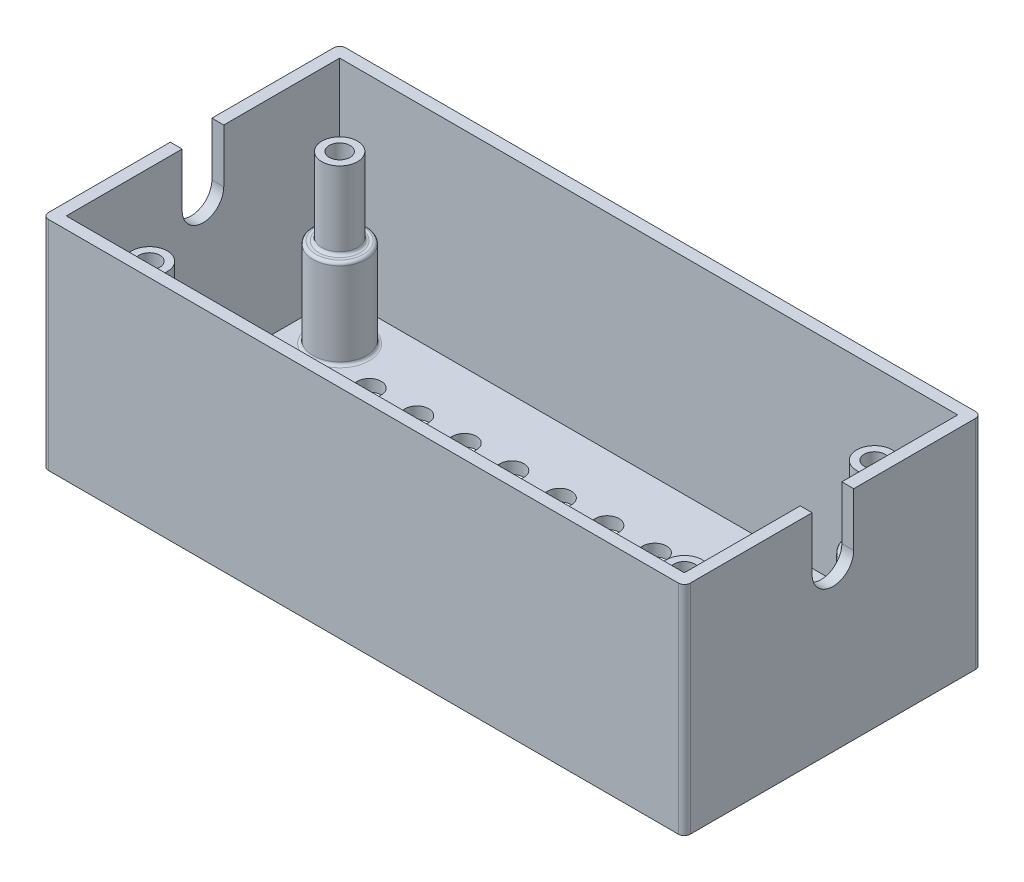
ISO-10303-21;
HEADER;
FILE_DESCRIPTION(('STEP AP214'),'2;1');
FILE_NAME('part.step','',(''),(''),'','','');
FILE_SCHEMA(('AUTOMOTIVE_DESIGN { 1 0 10303 214 1 1 1 1 }'));
ENDSEC;
DATA;
#1=APPLICATION_CONTEXT('core data for automotive mechanical design processes');
#2=APPLICATION_PROTOCOL_DEFINITION('international standard','automotive_design',2000,#1);
#3=PRODUCT_CONTEXT('',#1,'mechanical');
#4=PRODUCT('Part','Part','',(#3));
#5=PRODUCT_RELATED_PRODUCT_CATEGORY('part','',(#4));
#6=PRODUCT_DEFINITION_FORMATION('','',#4);
#7=PRODUCT_DEFINITION_CONTEXT('part definition',#1,'design');
#8=PRODUCT_DEFINITION('design','',#6,#7);
#9=PRODUCT_DEFINITION_SHAPE('','',#8);
#10=(LENGTH_UNIT() NAMED_UNIT(*) SI_UNIT(.MILLI.,.METRE.));
#11=(NAMED_UNIT(*) PLANE_ANGLE_UNIT() SI_UNIT($,.RADIAN.));
#12=(NAMED_UNIT(*) SI_UNIT($,.STERADIAN.) SOLID_ANGLE_UNIT());
#13=UNCERTAINTY_MEASURE_WITH_UNIT(LENGTH_MEASURE(1.E-05),#10,'distance_accuracy_value','');
#14=(GEOMETRIC_REPRESENTATION_CONTEXT(3) GLOBAL_UNCERTAINTY_ASSIGNED_CONTEXT((#13)) GLOBAL_UNIT_ASSIGNED_CONTEXT((#10,
#11,#12)) REPRESENTATION_CONTEXT('',''));
#15=CARTESIAN_POINT('',(0.,0.,0.));
#16=DIRECTION('',(0.,0.,1.));
#17=DIRECTION('',(1.,0.,0.));
#18=AXIS2_PLACEMENT_3D('',#15,#16,#17);
#19=CARTESIAN_POINT('',(-45.,0.,-16.));
#20=DIRECTION('',(0.,1.,0.));
#21=DIRECTION('',(0.,0.,1.));
#22=AXIS2_PLACEMENT_3D('',#19,#20,#21);
#23=CYLINDRICAL_SURFACE('',#22,1.75);
#24=CARTESIAN_POINT('',(-45.,30.,-16.));
#25=DIRECTION('',(0.,1.,0.));
#26=DIRECTION('',(0.,0.,1.));
#27=AXIS2_PLACEMENT_3D('',#24,#25,#26);
#28=CIRCLE('',#27,1.75);
#29=CARTESIAN_POINT('',(-45.,30.,-14.25));
#30=VERTEX_POINT('',#29);
#31=EDGE_CURVE('E1481',#30,#30,#28,.T.);
#32=ORIENTED_EDGE('',*,*,#31,.T.);
#33=EDGE_LOOP('',(#32));
#34=FACE_BOUND('',#33,.T.);
#35=CARTESIAN_POINT('',(-45.,15.5,-16.));
#36=DIRECTION('',(0.,-1.,0.));
#37=DIRECTION('',(0.,0.,-1.));
#38=AXIS2_PLACEMENT_3D('',#35,#36,#37);
#39=CIRCLE('',#38,1.75);
#40=CARTESIAN_POINT('',(-45.,15.5,-17.75));
#41=VERTEX_POINT('',#40);
#42=EDGE_CURVE('E1643',#41,#41,#39,.F.);
#43=ORIENTED_EDGE('',*,*,#42,.F.);
#44=EDGE_LOOP('',(#43));
#45=FACE_BOUND('',#44,.T.);
#46=ADVANCED_FACE('F39',(#34,#45),#23,.F.);
#47=CARTESIAN_POINT('',(45.,0.,-16.));
#48=DIRECTION('',(0.,1.,0.));
#49=DIRECTION('',(0.,0.,1.));
#50=AXIS2_PLACEMENT_3D('',#47,#48,#49);
#51=CYLINDRICAL_SURFACE('',#50,1.75);
#52=CARTESIAN_POINT('',(45.,30.,-16.));
#53=DIRECTION('',(0.,1.,0.));
#54=DIRECTION('',(0.,0.,1.));
#55=AXIS2_PLACEMENT_3D('',#52,#53,#54);
#56=CIRCLE('',#55,1.75);
#57=CARTESIAN_POINT('',(45.,30.,-14.25));
#58=VERTEX_POINT('',#57);
#59=EDGE_CURVE('E1478',#58,#58,#56,.T.);
#60=ORIENTED_EDGE('',*,*,#59,.T.);
#61=EDGE_LOOP('',(#60));
#62=FACE_BOUND('',#61,.T.);
#63=CARTESIAN_POINT('',(45.,15.5,-16.));
#64=DIRECTION('',(0.,-1.,0.));
#65=DIRECTION('',(0.,0.,-1.));
#66=AXIS2_PLACEMENT_3D('',#63,#64,#65);
#67=CIRCLE('',#66,1.75);
#68=CARTESIAN_POINT('',(45.,15.5,-17.75));
#69=VERTEX_POINT('',#68);
#70=EDGE_CURVE('E1640',#69,#69,#67,.F.);
#71=ORIENTED_EDGE('',*,*,#70,.F.);
#72=EDGE_LOOP('',(#71));
#73=FACE_BOUND('',#72,.T.);
#74=ADVANCED_FACE('F1734',(#62,#73),#51,.F.);
#75=CARTESIAN_POINT('',(45.,0.,16.));
#76=DIRECTION('',(0.,1.,0.));
#77=DIRECTION('',(0.,0.,1.));
#78=AXIS2_PLACEMENT_3D('',#75,#76,#77);
#79=CYLINDRICAL_SURFACE('',#78,1.75);
#80=CARTESIAN_POINT('',(45.,30.,16.));
#81=DIRECTION('',(0.,1.,0.));
#82=DIRECTION('',(0.,0.,1.));
#83=AXIS2_PLACEMENT_3D('',#80,#81,#82);
#84=CIRCLE('',#83,1.75);
#85=CARTESIAN_POINT('',(45.,30.,17.75));
#86=VERTEX_POINT('',#85);
#87=EDGE_CURVE('E1482',#86,#86,#84,.T.);
#88=ORIENTED_EDGE('',*,*,#87,.T.);
#89=EDGE_LOOP('',(#88));
#90=FACE_BOUND('',#89,.T.);
#91=CARTESIAN_POINT('',(45.,15.5,16.));
#92=DIRECTION('',(0.,-1.,0.));
#93=DIRECTION('',(0.,0.,-1.));
#94=AXIS2_PLACEMENT_3D('',#91,#92,#93);
#95=CIRCLE('',#94,1.75);
#96=CARTESIAN_POINT('',(45.,15.5,14.25));
#97=VERTEX_POINT('',#96);
#98=EDGE_CURVE('E1637',#97,#97,#95,.F.);
#99=ORIENTED_EDGE('',*,*,#98,.F.);
#100=EDGE_LOOP('',(#99));
#101=FACE_BOUND('',#100,.T.);
#102=ADVANCED_FACE('F1740',(#90,#101),#79,.F.);
#103=CARTESIAN_POINT('',(-45.,0.,16.));
#104=DIRECTION('',(0.,1.,0.));
#105=DIRECTION('',(0.,0.,1.));
#106=AXIS2_PLACEMENT_3D('',#103,#104,#105);
#107=CYLINDRICAL_SURFACE('',#106,1.75);
#108=CARTESIAN_POINT('',(-45.,30.,16.));
#109=DIRECTION('',(0.,1.,0.));
#110=DIRECTION('',(0.,0.,1.));
#111=AXIS2_PLACEMENT_3D('',#108,#109,#110);
#112=CIRCLE('',#111,1.75);
#113=CARTESIAN_POINT('',(-45.,30.,17.75));
#114=VERTEX_POINT('',#113);
#115=EDGE_CURVE('E1475',#114,#114,#112,.T.);
#116=ORIENTED_EDGE('',*,*,#115,.T.);
#117=EDGE_LOOP('',(#116));
#118=FACE_BOUND('',#117,.T.);
#119=CARTESIAN_POINT('',(-45.,15.5,16.));
#120=DIRECTION('',(0.,-1.,0.));
#121=DIRECTION('',(0.,0.,-1.));
#122=AXIS2_PLACEMENT_3D('',#119,#120,#121);
#123=CIRCLE('',#122,1.75);
#124=CARTESIAN_POINT('',(-45.,15.5,14.25));
#125=VERTEX_POINT('',#124);
#126=EDGE_CURVE('E1634',#125,#125,#123,.F.);
#127=ORIENTED_EDGE('',*,*,#126,.F.);
#128=EDGE_LOOP('',(#127));
#129=FACE_BOUND('',#128,.T.);
#130=ADVANCED_FACE('F1746',(#118,#129),#107,.F.);
#131=CARTESIAN_POINT('',(0.,36.6,0.));
#132=DIRECTION('',(0.,1.,0.));
#133=DIRECTION('',(0.,0.,1.));
#134=AXIS2_PLACEMENT_3D('',#131,#132,#133);
#135=PLANE('',#134);
#136=DIRECTION('',(-1.,0.,0.));
#137=VECTOR('',#136,1.);
#138=CARTESIAN_POINT('',(54.,36.6,-25.));
#139=LINE('',#138,#137);
#140=CARTESIAN_POINT('',(53.,36.6,-25.));
#141=VERTEX_POINT('',#140);
#142=CARTESIAN_POINT('',(-53.,36.6,-25.));
#143=VERTEX_POINT('',#142);
#144=EDGE_CURVE('E1538',#141,#143,#139,.T.);
#145=ORIENTED_EDGE('',*,*,#144,.T.);
#146=CARTESIAN_POINT('',(-53.,36.6,-24.));
#147=DIRECTION('',(0.,1.,0.));
#148=DIRECTION('',(0.,0.,1.));
#149=AXIS2_PLACEMENT_3D('',#146,#147,#148);
#150=CIRCLE('',#149,1.);
#151=CARTESIAN_POINT('',(-54.,36.6,-24.));
#152=VERTEX_POINT('',#151);
#153=EDGE_CURVE('E1666',#143,#152,#150,.T.);
#154=ORIENTED_EDGE('',*,*,#153,.T.);
#155=DIRECTION('',(0.,0.,1.));
#156=VECTOR('',#155,1.);
#157=CARTESIAN_POINT('',(-54.,36.6,-25.));
#158=LINE('',#157,#156);
#159=CARTESIAN_POINT('',(-54.,36.6,-3.5));
#160=VERTEX_POINT('',#159);
#161=EDGE_CURVE('E1542',#152,#160,#158,.T.);
#162=ORIENTED_EDGE('',*,*,#161,.T.);
#163=DIRECTION('',(-1.,0.,0.));
#164=VECTOR('',#163,1.);
#165=CARTESIAN_POINT('',(54.,36.6,-3.5));
#166=LINE('',#165,#164);
#167=CARTESIAN_POINT('',(-52.,36.6,-3.5));
#168=VERTEX_POINT('',#167);
#169=EDGE_CURVE('E1436',#168,#160,#166,.T.);
#170=ORIENTED_EDGE('',*,*,#169,.F.);
#171=DIRECTION('',(0.,0.,1.));
#172=VECTOR('',#171,1.);
#173=CARTESIAN_POINT('',(-52.,36.6,-23.));
#174=LINE('',#173,#172);
#175=CARTESIAN_POINT('',(-52.,36.6,-23.));
#176=VERTEX_POINT('',#175);
#177=EDGE_CURVE('E1509',#176,#168,#174,.T.);
#178=ORIENTED_EDGE('',*,*,#177,.F.);
#179=DIRECTION('',(-1.,0.,0.));
#180=VECTOR('',#179,1.);
#181=CARTESIAN_POINT('',(52.,36.6,-23.));
#182=LINE('',#181,#180);
#183=CARTESIAN_POINT('',(52.,36.6,-23.));
#184=VERTEX_POINT('',#183);
#185=EDGE_CURVE('E1505',#184,#176,#182,.T.);
#186=ORIENTED_EDGE('',*,*,#185,.F.);
#187=DIRECTION('',(0.,0.,-1.));
#188=VECTOR('',#187,1.);
#189=CARTESIAN_POINT('',(52.,36.6,23.));
#190=LINE('',#189,#188);
#191=CARTESIAN_POINT('',(52.,36.6,-3.5));
#192=VERTEX_POINT('',#191);
#193=EDGE_CURVE('E1506',#192,#184,#190,.T.);
#194=ORIENTED_EDGE('',*,*,#193,.F.);
#195=CARTESIAN_POINT('',(54.,36.6,-3.5));
#196=VERTEX_POINT('',#195);
#197=EDGE_CURVE('E1433',#196,#192,#166,.T.);
#198=ORIENTED_EDGE('',*,*,#197,.F.);
#199=DIRECTION('',(0.,0.,-1.));
#200=VECTOR('',#199,1.);
#201=CARTESIAN_POINT('',(54.,36.6,25.));
#202=LINE('',#201,#200);
#203=CARTESIAN_POINT('',(54.,36.6,-24.));
#204=VERTEX_POINT('',#203);
#205=EDGE_CURVE('E1535',#196,#204,#202,.T.);
#206=ORIENTED_EDGE('',*,*,#205,.T.);
#207=CARTESIAN_POINT('',(53.,36.6,-24.));
#208=DIRECTION('',(0.,1.,0.));
#209=DIRECTION('',(0.,0.,1.));
#210=AXIS2_PLACEMENT_3D('',#207,#208,#209);
#211=CIRCLE('',#210,1.);
#212=EDGE_CURVE('E1664',#204,#141,#211,.T.);
#213=ORIENTED_EDGE('',*,*,#212,.T.);
#214=EDGE_LOOP('',(#145,#154,#162,#170,#178,#186,#194,#198,#206,#213));
#215=FACE_BOUND('',#214,.T.);
#216=ADVANCED_FACE('F1793',(#215),#135,.T.);
#217=CARTESIAN_POINT('',(0.,2.,0.));
#218=DIRECTION('',(0.,1.,0.));
#219=DIRECTION('',(0.,0.,1.));
#220=AXIS2_PLACEMENT_3D('',#217,#218,#219);
#221=PLANE('',#220);
#222=CARTESIAN_POINT('',(45.,2.,16.));
#223=DIRECTION('',(0.,1.,0.));
#224=DIRECTION('',(0.,0.,1.));
#225=AXIS2_PLACEMENT_3D('',#222,#223,#224);
#226=CIRCLE('',#225,5.);
#227=CARTESIAN_POINT('',(45.,2.,21.));
#228=VERTEX_POINT('',#227);
#229=EDGE_CURVE('E1577',#228,#228,#226,.F.);
#230=ORIENTED_EDGE('',*,*,#229,.T.);
#231=EDGE_LOOP('',(#230));
#232=FACE_BOUND('',#231,.T.);
#233=CARTESIAN_POINT('',(45.,2.,-16.));
#234=DIRECTION('',(0.,1.,0.));
#235=DIRECTION('',(0.,0.,1.));
#236=AXIS2_PLACEMENT_3D('',#233,#234,#235);
#237=CIRCLE('',#236,5.);
#238=CARTESIAN_POINT('',(45.,2.,-11.));
#239=VERTEX_POINT('',#238);
#240=EDGE_CURVE('E1574',#239,#239,#237,.F.);
#241=ORIENTED_EDGE('',*,*,#240,.T.);
#242=EDGE_LOOP('',(#241));
#243=FACE_BOUND('',#242,.T.);
#244=CARTESIAN_POINT('',(-45.,2.,16.));
#245=DIRECTION('',(0.,1.,0.));
#246=DIRECTION('',(0.,0.,1.));
#247=AXIS2_PLACEMENT_3D('',#244,#245,#246);
#248=CIRCLE('',#247,5.);
#249=CARTESIAN_POINT('',(-45.,2.,21.));
#250=VERTEX_POINT('',#249);
#251=EDGE_CURVE('E1571',#250,#250,#248,.F.);
#252=ORIENTED_EDGE('',*,*,#251,.T.);
#253=EDGE_LOOP('',(#252));
#254=FACE_BOUND('',#253,.T.);
#255=CARTESIAN_POINT('',(-45.,2.,-16.));
#256=DIRECTION('',(0.,1.,0.));
#257=DIRECTION('',(0.,0.,1.));
#258=AXIS2_PLACEMENT_3D('',#255,#256,#257);
#259=CIRCLE('',#258,5.);
#260=CARTESIAN_POINT('',(-45.,2.,-11.));
#261=VERTEX_POINT('',#260);
#262=EDGE_CURVE('E1568',#261,#261,#259,.F.);
#263=ORIENTED_EDGE('',*,*,#262,.T.);
#264=EDGE_LOOP('',(#263));
#265=FACE_BOUND('',#264,.T.);
#266=CARTESIAN_POINT('',(-11.9999999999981,2.,3.99999999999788));
#267=DIRECTION('',(0.,1.,0.));
#268=DIRECTION('',(0.,0.,1.));
#269=AXIS2_PLACEMENT_3D('',#266,#267,#268);
#270=CIRCLE('',#269,1.99999999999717);
#271=CARTESIAN_POINT('',(-13.9999999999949,2.,3.99999999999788));
#272=VERTEX_POINT('',#271);
#273=CARTESIAN_POINT('',(-10.0000000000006,2.,3.99999999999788));
#274=VERTEX_POINT('',#273);
#275=EDGE_CURVE('E879',#272,#274,#270,.F.);
#276=ORIENTED_EDGE('',*,*,#275,.T.);
#277=DIRECTION('',(0.,0.,1.));
#278=VECTOR('',#277,1.);
#279=CARTESIAN_POINT('',(-10.0000000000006,2.,3.99999999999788));
#280=LINE('',#279,#278);
#281=CARTESIAN_POINT('',(-10.0000000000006,2.,11.9999999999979));
#282=VERTEX_POINT('',#281);
#283=EDGE_CURVE('E896',#274,#282,#280,.T.);
#284=ORIENTED_EDGE('',*,*,#283,.T.);
#285=CARTESIAN_POINT('',(-11.9999999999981,2.,11.9999999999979));
#286=DIRECTION('',(0.,1.,0.));
#287=DIRECTION('',(0.,0.,1.));
#288=AXIS2_PLACEMENT_3D('',#285,#286,#287);
#289=CIRCLE('',#288,1.99999999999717);
#290=CARTESIAN_POINT('',(-13.9999999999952,2.,11.9999999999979));
#291=VERTEX_POINT('',#290);
#292=EDGE_CURVE('E872',#282,#291,#289,.F.);
#293=ORIENTED_EDGE('',*,*,#292,.T.);
#294=DIRECTION('',(0.,0.,-1.));
#295=VECTOR('',#294,1.);
#296=CARTESIAN_POINT('',(-13.9999999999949,2.,3.99999999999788));
#297=LINE('',#296,#295);
#298=EDGE_CURVE('E875',#291,#272,#297,.T.);
#299=ORIENTED_EDGE('',*,*,#298,.T.);
#300=EDGE_LOOP('',(#276,#284,#293,#299));
#301=FACE_BOUND('',#300,.T.);
#302=CARTESIAN_POINT('',(-19.9999999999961,2.,3.9999999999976));
#303=DIRECTION('',(0.,1.,0.));
#304=DIRECTION('',(0.,0.,1.));
#305=AXIS2_PLACEMENT_3D('',#302,#303,#304);
#306=CIRCLE('',#305,1.99999999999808);
#307=CARTESIAN_POINT('',(-21.9999999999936,2.,3.9999999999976));
#308=VERTEX_POINT('',#307);
#309=CARTESIAN_POINT('',(-17.9999999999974,2.,3.9999999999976));
#310=VERTEX_POINT('',#309);
#311=EDGE_CURVE('E913',#308,#310,#306,.F.);
#312=ORIENTED_EDGE('',*,*,#311,.T.);
#313=DIRECTION('',(0.,0.,1.));
#314=VECTOR('',#313,1.);
#315=CARTESIAN_POINT('',(-17.9999999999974,2.,3.9999999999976));
#316=LINE('',#315,#314);
#317=CARTESIAN_POINT('',(-17.9999999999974,2.,11.9999999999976));
#318=VERTEX_POINT('',#317);
#319=EDGE_CURVE('E876',#310,#318,#316,.T.);
#320=ORIENTED_EDGE('',*,*,#319,.T.);
#321=CARTESIAN_POINT('',(-19.9999999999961,2.,11.9999999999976));
#322=DIRECTION('',(0.,1.,0.));
#323=DIRECTION('',(0.,0.,1.));
#324=AXIS2_PLACEMENT_3D('',#321,#322,#323);
#325=CIRCLE('',#324,1.99999999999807);
#326=CARTESIAN_POINT('',(-21.9999999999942,2.,11.9999999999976));
#327=VERTEX_POINT('',#326);
#328=EDGE_CURVE('E906',#318,#327,#325,.F.);
#329=ORIENTED_EDGE('',*,*,#328,.T.);
#330=DIRECTION('',(0.,0.,-1.));
#331=VECTOR('',#330,1.);
#332=CARTESIAN_POINT('',(-21.9999999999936,2.,3.9999999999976));
#333=LINE('',#332,#331);
#334=EDGE_CURVE('E909',#327,#308,#333,.T.);
#335=ORIENTED_EDGE('',*,*,#334,.T.);
#336=EDGE_LOOP('',(#312,#320,#329,#335));
#337=FACE_BOUND('',#336,.T.);
#338=CARTESIAN_POINT('',(-27.9999999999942,2.,3.99999999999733));
#339=DIRECTION('',(0.,1.,0.));
#340=DIRECTION('',(0.,0.,1.));
#341=AXIS2_PLACEMENT_3D('',#338,#339,#340);
#342=CIRCLE('',#341,1.99999999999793);
#343=CARTESIAN_POINT('',(-29.9999999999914,2.,3.99999999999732));
#344=VERTEX_POINT('',#343);
#345=CARTESIAN_POINT('',(-25.9999999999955,2.,3.99999999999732));
#346=VERTEX_POINT('',#345);
#347=EDGE_CURVE('E945',#344,#346,#342,.F.);
#348=ORIENTED_EDGE('',*,*,#347,.T.);
#349=DIRECTION('',(0.,0.,1.));
#350=VECTOR('',#349,1.);
#351=CARTESIAN_POINT('',(-25.9999999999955,2.,3.99999999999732));
#352=LINE('',#351,#350);
#353=CARTESIAN_POINT('',(-25.9999999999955,2.,11.9999999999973));
#354=VERTEX_POINT('',#353);
#355=EDGE_CURVE('E910',#346,#354,#352,.T.);
#356=ORIENTED_EDGE('',*,*,#355,.T.);
#357=CARTESIAN_POINT('',(-27.9999999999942,2.,11.9999999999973));
#358=DIRECTION('',(0.,1.,0.));
#359=DIRECTION('',(0.,0.,1.));
#360=AXIS2_PLACEMENT_3D('',#357,#358,#359);
#361=CIRCLE('',#360,1.99999999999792);
#362=CARTESIAN_POINT('',(-29.9999999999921,2.,11.9999999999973));
#363=VERTEX_POINT('',#362);
#364=EDGE_CURVE('E938',#354,#363,#361,.F.);
#365=ORIENTED_EDGE('',*,*,#364,.T.);
#366=DIRECTION('',(0.,0.,-1.));
#367=VECTOR('',#366,1.);
#368=CARTESIAN_POINT('',(-29.9999999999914,2.,3.99999999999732));
#369=LINE('',#368,#367);
#370=EDGE_CURVE('E941',#363,#344,#369,.T.);
#371=ORIENTED_EDGE('',*,*,#370,.T.);
#372=EDGE_LOOP('',(#348,#356,#365,#371));
#373=FACE_BOUND('',#372,.T.);
#374=CARTESIAN_POINT('',(-35.9999999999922,2.,3.99999999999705));
#375=DIRECTION('',(0.,1.,0.));
#376=DIRECTION('',(0.,0.,1.));
#377=AXIS2_PLACEMENT_3D('',#374,#375,#376);
#378=CIRCLE('',#377,1.99999999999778);
#379=CARTESIAN_POINT('',(-37.9999999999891,2.,3.99999999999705));
#380=VERTEX_POINT('',#379);
#381=CARTESIAN_POINT('',(-33.9999999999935,2.,3.99999999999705));
#382=VERTEX_POINT('',#381);
#383=EDGE_CURVE('E977',#380,#382,#378,.F.);
#384=ORIENTED_EDGE('',*,*,#383,.T.);
#385=DIRECTION('',(0.,0.,1.));
#386=VECTOR('',#385,1.);
#387=CARTESIAN_POINT('',(-33.9999999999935,2.,3.99999999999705));
#388=LINE('',#387,#386);
#389=CARTESIAN_POINT('',(-33.9999999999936,2.,11.999999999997));
#390=VERTEX_POINT('',#389);
#391=EDGE_CURVE('E942',#382,#390,#388,.T.);
#392=ORIENTED_EDGE('',*,*,#391,.T.);
#393=CARTESIAN_POINT('',(-35.9999999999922,2.,11.999999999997));
#394=DIRECTION('',(0.,1.,0.));
#395=DIRECTION('',(0.,0.,1.));
#396=AXIS2_PLACEMENT_3D('',#393,#394,#395);
#397=CIRCLE('',#396,1.99999999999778);
#398=CARTESIAN_POINT('',(-37.99999999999,2.,11.999999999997));
#399=VERTEX_POINT('',#398);
#400=EDGE_CURVE('E970',#390,#399,#397,.F.);
#401=ORIENTED_EDGE('',*,*,#400,.T.);
#402=DIRECTION('',(0.,0.,-1.));
#403=VECTOR('',#402,1.);
#404=CARTESIAN_POINT('',(-37.9999999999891,2.,3.99999999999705));
#405=LINE('',#404,#403);
#406=EDGE_CURVE('E973',#399,#380,#405,.T.);
#407=ORIENTED_EDGE('',*,*,#406,.T.);
#408=EDGE_LOOP('',(#384,#392,#401,#407));
#409=FACE_BOUND('',#408,.T.);
#410=CARTESIAN_POINT('',(-11.9999999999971,2.,-12.0000000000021));
#411=DIRECTION('',(0.,1.,0.));
#412=DIRECTION('',(0.,0.,1.));
#413=AXIS2_PLACEMENT_3D('',#410,#411,#412);
#414=CIRCLE('',#413,1.999999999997);
#415=CARTESIAN_POINT('',(-13.9999999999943,2.,-12.0000000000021));
#416=VERTEX_POINT('',#415);
#417=CARTESIAN_POINT('',(-10.0000000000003,2.,-12.0000000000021));
#418=VERTEX_POINT('',#417);
#419=EDGE_CURVE('E1009',#416,#418,#414,.F.);
#420=ORIENTED_EDGE('',*,*,#419,.T.);
#421=DIRECTION('',(0.,0.,1.));
#422=VECTOR('',#421,1.);
#423=CARTESIAN_POINT('',(-10.0000000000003,2.,-12.0000000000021));
#424=LINE('',#423,#422);
#425=CARTESIAN_POINT('',(-10.0000000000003,2.,-4.00000000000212));
#426=VERTEX_POINT('',#425);
#427=EDGE_CURVE('E974',#418,#426,#424,.T.);
#428=ORIENTED_EDGE('',*,*,#427,.T.);
#429=CARTESIAN_POINT('',(-11.9999999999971,2.,-4.00000000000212));
#430=DIRECTION('',(0.,1.,0.));
#431=DIRECTION('',(0.,0.,1.));
#432=AXIS2_PLACEMENT_3D('',#429,#430,#431);
#433=CIRCLE('',#432,1.99999999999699);
#434=CARTESIAN_POINT('',(-13.9999999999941,2.,-4.00000000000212));
#435=VERTEX_POINT('',#434);
#436=EDGE_CURVE('E1002',#426,#435,#433,.F.);
#437=ORIENTED_EDGE('',*,*,#436,.T.);
#438=DIRECTION('',(0.,0.,-1.));
#439=VECTOR('',#438,1.);
#440=CARTESIAN_POINT('',(-13.9999999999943,2.,-12.0000000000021));
#441=LINE('',#440,#439);
#442=EDGE_CURVE('E1005',#435,#416,#441,.T.);
#443=ORIENTED_EDGE('',*,*,#442,.T.);
#444=EDGE_LOOP('',(#420,#428,#437,#443));
#445=FACE_BOUND('',#444,.T.);
#446=CARTESIAN_POINT('',(-19.9999999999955,2.,-12.0000000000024));
#447=DIRECTION('',(0.,1.,0.));
#448=DIRECTION('',(0.,0.,1.));
#449=AXIS2_PLACEMENT_3D('',#446,#447,#448);
#450=CIRCLE('',#449,1.99999999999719);
#451=CARTESIAN_POINT('',(-21.999999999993,2.,-12.0000000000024));
#452=VERTEX_POINT('',#451);
#453=CARTESIAN_POINT('',(-17.9999999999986,2.,-12.0000000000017));
#454=VERTEX_POINT('',#453);
#455=EDGE_CURVE('E1041',#452,#454,#450,.F.);
#456=ORIENTED_EDGE('',*,*,#455,.T.);
#457=DIRECTION('',(0.,0.,1.));
#458=VECTOR('',#457,1.);
#459=CARTESIAN_POINT('',(-17.9999999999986,2.,-12.0000000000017));
#460=LINE('',#459,#458);
#461=CARTESIAN_POINT('',(-17.9999999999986,2.,-4.00000000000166));
#462=VERTEX_POINT('',#461);
#463=EDGE_CURVE('E1006',#454,#462,#460,.T.);
#464=ORIENTED_EDGE('',*,*,#463,.T.);
#465=CARTESIAN_POINT('',(-19.9999999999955,2.,-4.00000000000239));
#466=DIRECTION('',(0.,1.,0.));
#467=DIRECTION('',(0.,0.,1.));
#468=AXIS2_PLACEMENT_3D('',#465,#466,#467);
#469=CIRCLE('',#468,1.99999999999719);
#470=CARTESIAN_POINT('',(-21.9999999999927,2.,-4.0000000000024));
#471=VERTEX_POINT('',#470);
#472=EDGE_CURVE('E1034',#462,#471,#469,.F.);
#473=ORIENTED_EDGE('',*,*,#472,.T.);
#474=DIRECTION('',(0.,0.,-1.));
#475=VECTOR('',#474,1.);
#476=CARTESIAN_POINT('',(-21.999999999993,2.,-12.0000000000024));
#477=LINE('',#476,#475);
#478=EDGE_CURVE('E1037',#471,#452,#477,.T.);
#479=ORIENTED_EDGE('',*,*,#478,.T.);
#480=EDGE_LOOP('',(#456,#464,#473,#479));
#481=FACE_BOUND('',#480,.T.);
#482=CARTESIAN_POINT('',(-27.9999999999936,2.,-12.0000000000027));
#483=DIRECTION('',(0.,1.,0.));
#484=DIRECTION('',(0.,0.,1.));
#485=AXIS2_PLACEMENT_3D('',#482,#483,#484);
#486=CIRCLE('',#485,1.99999999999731);
#487=CARTESIAN_POINT('',(-29.9999999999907,2.,-12.0000000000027));
#488=VERTEX_POINT('',#487);
#489=CARTESIAN_POINT('',(-25.9999999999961,2.,-12.0000000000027));
#490=VERTEX_POINT('',#489);
#491=EDGE_CURVE('E1073',#488,#490,#486,.F.);
#492=ORIENTED_EDGE('',*,*,#491,.T.);
#493=DIRECTION('',(0.,0.,1.));
#494=VECTOR('',#493,1.);
#495=CARTESIAN_POINT('',(-25.9999999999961,2.,-12.0000000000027));
#496=LINE('',#495,#494);
#497=CARTESIAN_POINT('',(-25.9999999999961,2.,-4.00000000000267));
#498=VERTEX_POINT('',#497);
#499=EDGE_CURVE('E1038',#490,#498,#496,.T.);
#500=ORIENTED_EDGE('',*,*,#499,.T.);
#501=CARTESIAN_POINT('',(-27.9999999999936,2.,-4.00000000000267));
#502=DIRECTION('',(0.,1.,0.));
#503=DIRECTION('',(0.,0.,1.));
#504=AXIS2_PLACEMENT_3D('',#501,#502,#503);
#505=CIRCLE('',#504,1.99999999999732);
#506=CARTESIAN_POINT('',(-29.9999999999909,2.,-4.00000000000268));
#507=VERTEX_POINT('',#506);
#508=EDGE_CURVE('E1066',#498,#507,#505,.F.);
#509=ORIENTED_EDGE('',*,*,#508,.T.);
#510=DIRECTION('',(0.,0.,-1.));
#511=VECTOR('',#510,1.);
#512=CARTESIAN_POINT('',(-29.9999999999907,2.,-12.0000000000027));
#513=LINE('',#512,#511);
#514=EDGE_CURVE('E1069',#507,#488,#513,.T.);
#515=ORIENTED_EDGE('',*,*,#514,.T.);
#516=EDGE_LOOP('',(#492,#500,#509,#515));
#517=FACE_BOUND('',#516,.T.);
#518=CARTESIAN_POINT('',(-35.9999999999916,2.,-12.0000000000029));
#519=DIRECTION('',(0.,1.,0.));
#520=DIRECTION('',(0.,0.,1.));
#521=AXIS2_PLACEMENT_3D('',#518,#519,#520);
#522=CIRCLE('',#521,1.99999999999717);
#523=CARTESIAN_POINT('',(-37.9999999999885,2.,-12.000000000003));
#524=VERTEX_POINT('',#523);
#525=CARTESIAN_POINT('',(-33.9999999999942,2.,-12.0000000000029));
#526=VERTEX_POINT('',#525);
#527=EDGE_CURVE('E1105',#524,#526,#522,.F.);
#528=ORIENTED_EDGE('',*,*,#527,.T.);
#529=DIRECTION('',(0.,0.,1.));
#530=VECTOR('',#529,1.);
#531=CARTESIAN_POINT('',(-33.9999999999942,2.,-12.0000000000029));
#532=LINE('',#531,#530);
#533=CARTESIAN_POINT('',(-33.9999999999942,2.,-4.00000000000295));
#534=VERTEX_POINT('',#533);
#535=EDGE_CURVE('E1070',#526,#534,#532,.T.);
#536=ORIENTED_EDGE('',*,*,#535,.T.);
#537=CARTESIAN_POINT('',(-35.9999999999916,2.,-4.00000000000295));
#538=DIRECTION('',(0.,1.,0.));
#539=DIRECTION('',(0.,0.,1.));
#540=AXIS2_PLACEMENT_3D('',#537,#538,#539);
#541=CIRCLE('',#540,1.99999999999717);
#542=CARTESIAN_POINT('',(-37.9999999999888,2.,-4.00000000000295));
#543=VERTEX_POINT('',#542);
#544=EDGE_CURVE('E1098',#534,#543,#541,.F.);
#545=ORIENTED_EDGE('',*,*,#544,.T.);
#546=DIRECTION('',(0.,0.,-1.));
#547=VECTOR('',#546,1.);
#548=CARTESIAN_POINT('',(-37.9999999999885,2.,-12.000000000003));
#549=LINE('',#548,#547);
#550=EDGE_CURVE('E1101',#543,#524,#549,.T.);
#551=ORIENTED_EDGE('',*,*,#550,.T.);
#552=EDGE_LOOP('',(#528,#536,#545,#551));
#553=FACE_BOUND('',#552,.T.);
#554=CARTESIAN_POINT('',(27.9999999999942,2.,3.99999999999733));
#555=DIRECTION('',(0.,1.,0.));
#556=DIRECTION('',(0.,0.,1.));
#557=AXIS2_PLACEMENT_3D('',#554,#555,#556);
#558=CIRCLE('',#557,1.99999999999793);
#559=CARTESIAN_POINT('',(25.9999999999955,2.,3.99999999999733));
#560=VERTEX_POINT('',#559);
#561=CARTESIAN_POINT('',(29.9999999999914,2.,3.99999999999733));
#562=VERTEX_POINT('',#561);
#563=EDGE_CURVE('E1233',#560,#562,#558,.F.);
#564=ORIENTED_EDGE('',*,*,#563,.T.);
#565=DIRECTION('',(0.,0.,1.));
#566=VECTOR('',#565,1.);
#567=CARTESIAN_POINT('',(29.9999999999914,2.,3.99999999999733));
#568=LINE('',#567,#566);
#569=CARTESIAN_POINT('',(29.9999999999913,2.,11.9999999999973));
#570=VERTEX_POINT('',#569);
#571=EDGE_CURVE('E1200',#562,#570,#568,.T.);
#572=ORIENTED_EDGE('',*,*,#571,.T.);
#573=CARTESIAN_POINT('',(27.9999999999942,2.,11.9999999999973));
#574=DIRECTION('',(0.,1.,0.));
#575=DIRECTION('',(0.,0.,1.));
#576=AXIS2_PLACEMENT_3D('',#573,#574,#575);
#577=CIRCLE('',#576,1.99999999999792);
#578=CARTESIAN_POINT('',(25.9999999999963,2.,11.9999999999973));
#579=VERTEX_POINT('',#578);
#580=EDGE_CURVE('E809',#570,#579,#577,.F.);
#581=ORIENTED_EDGE('',*,*,#580,.T.);
#582=DIRECTION('',(0.,0.,-1.));
#583=VECTOR('',#582,1.);
#584=CARTESIAN_POINT('',(25.9999999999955,2.,3.99999999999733));
#585=LINE('',#584,#583);
#586=EDGE_CURVE('E1230',#579,#560,#585,.T.);
#587=ORIENTED_EDGE('',*,*,#586,.T.);
#588=EDGE_LOOP('',(#564,#572,#581,#587));
#589=FACE_BOUND('',#588,.T.);
#590=CARTESIAN_POINT('',(35.9999999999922,2.,3.99999999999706));
#591=DIRECTION('',(0.,1.,0.));
#592=DIRECTION('',(0.,0.,1.));
#593=AXIS2_PLACEMENT_3D('',#590,#591,#592);
#594=CIRCLE('',#593,1.99999999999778);
#595=CARTESIAN_POINT('',(33.9999999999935,2.,3.99999999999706));
#596=VERTEX_POINT('',#595);
#597=CARTESIAN_POINT('',(37.9999999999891,2.,3.99999999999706));
#598=VERTEX_POINT('',#597);
#599=EDGE_CURVE('E1203',#596,#598,#594,.F.);
#600=ORIENTED_EDGE('',*,*,#599,.T.);
#601=DIRECTION('',(0.,0.,1.));
#602=VECTOR('',#601,1.);
#603=CARTESIAN_POINT('',(37.9999999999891,2.,3.99999999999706));
#604=LINE('',#603,#602);
#605=CARTESIAN_POINT('',(37.9999999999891,2.,11.9999999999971));
#606=VERTEX_POINT('',#605);
#607=EDGE_CURVE('E1168',#598,#606,#604,.T.);
#608=ORIENTED_EDGE('',*,*,#607,.T.);
#609=CARTESIAN_POINT('',(35.9999999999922,2.,11.9999999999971));
#610=DIRECTION('',(0.,1.,0.));
#611=DIRECTION('',(0.,0.,1.));
#612=AXIS2_PLACEMENT_3D('',#609,#610,#611);
#613=CIRCLE('',#612,1.99999999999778);
#614=CARTESIAN_POINT('',(33.9999999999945,2.,11.9999999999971));
#615=VERTEX_POINT('',#614);
#616=EDGE_CURVE('E1196',#606,#615,#613,.F.);
#617=ORIENTED_EDGE('',*,*,#616,.T.);
#618=DIRECTION('',(0.,0.,-1.));
#619=VECTOR('',#618,1.);
#620=CARTESIAN_POINT('',(33.9999999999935,2.,3.99999999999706));
#621=LINE('',#620,#619);
#622=EDGE_CURVE('E1199',#615,#596,#621,.T.);
#623=ORIENTED_EDGE('',*,*,#622,.T.);
#624=EDGE_LOOP('',(#600,#608,#617,#623));
#625=FACE_BOUND('',#624,.T.);
#626=CARTESIAN_POINT('',(11.9999999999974,2.,-12.0000000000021));
#627=DIRECTION('',(0.,1.,0.));
#628=DIRECTION('',(0.,0.,1.));
#629=AXIS2_PLACEMENT_3D('',#626,#627,#628);
#630=CIRCLE('',#629,1.99999999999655);
#631=CARTESIAN_POINT('',(10.0000000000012,2.,-12.0000000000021));
#632=VERTEX_POINT('',#631);
#633=CARTESIAN_POINT('',(13.9999999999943,2.,-12.0000000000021));
#634=VERTEX_POINT('',#633);
#635=EDGE_CURVE('E1171',#632,#634,#630,.F.);
#636=ORIENTED_EDGE('',*,*,#635,.T.);
#637=DIRECTION('',(0.,0.,1.));
#638=VECTOR('',#637,1.);
#639=CARTESIAN_POINT('',(13.9999999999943,2.,-12.0000000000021));
#640=LINE('',#639,#638);
#641=CARTESIAN_POINT('',(13.9999999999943,2.,-4.00000000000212));
#642=VERTEX_POINT('',#641);
#643=EDGE_CURVE('E1134',#634,#642,#640,.T.);
#644=ORIENTED_EDGE('',*,*,#643,.T.);
#645=CARTESIAN_POINT('',(11.9999999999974,2.,-4.00000000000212));
#646=DIRECTION('',(0.,1.,0.));
#647=DIRECTION('',(0.,0.,1.));
#648=AXIS2_PLACEMENT_3D('',#645,#646,#647);
#649=CIRCLE('',#648,1.99999999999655);
#650=CARTESIAN_POINT('',(10.0000000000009,2.,-4.00000000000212));
#651=VERTEX_POINT('',#650);
#652=EDGE_CURVE('E1164',#642,#651,#649,.F.);
#653=ORIENTED_EDGE('',*,*,#652,.T.);
#654=DIRECTION('',(0.,0.,-1.));
#655=VECTOR('',#654,1.);
#656=CARTESIAN_POINT('',(10.0000000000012,2.,-12.0000000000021));
#657=LINE('',#656,#655);
#658=EDGE_CURVE('E1167',#651,#632,#657,.T.);
#659=ORIENTED_EDGE('',*,*,#658,.T.);
#660=EDGE_LOOP('',(#636,#644,#653,#659));
#661=FACE_BOUND('',#660,.T.);
#662=CARTESIAN_POINT('',(19.9999999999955,2.,-12.0000000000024));
#663=DIRECTION('',(0.,1.,0.));
#664=DIRECTION('',(0.,0.,1.));
#665=AXIS2_PLACEMENT_3D('',#662,#663,#664);
#666=CIRCLE('',#665,1.99999999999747);
#667=CARTESIAN_POINT('',(17.999999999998,2.,-12.0000000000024));
#668=VERTEX_POINT('',#667);
#669=CARTESIAN_POINT('',(21.999999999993,2.,-12.0000000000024));
#670=VERTEX_POINT('',#669);
#671=EDGE_CURVE('E1137',#668,#670,#666,.F.);
#672=ORIENTED_EDGE('',*,*,#671,.T.);
#673=DIRECTION('',(0.,0.,1.));
#674=VECTOR('',#673,1.);
#675=CARTESIAN_POINT('',(21.999999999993,2.,-12.0000000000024));
#676=LINE('',#675,#674);
#677=CARTESIAN_POINT('',(21.999999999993,2.,-4.00000000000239));
#678=VERTEX_POINT('',#677);
#679=EDGE_CURVE('E1154',#670,#678,#676,.T.);
#680=ORIENTED_EDGE('',*,*,#679,.T.);
#681=CARTESIAN_POINT('',(19.9999999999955,2.,-4.00000000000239));
#682=DIRECTION('',(0.,1.,0.));
#683=DIRECTION('',(0.,0.,1.));
#684=AXIS2_PLACEMENT_3D('',#681,#682,#683);
#685=CIRCLE('',#684,1.99999999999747);
#686=CARTESIAN_POINT('',(17.999999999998,2.,-4.00000000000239));
#687=VERTEX_POINT('',#686);
#688=EDGE_CURVE('E1130',#678,#687,#685,.F.);
#689=ORIENTED_EDGE('',*,*,#688,.T.);
#690=DIRECTION('',(0.,0.,-1.));
#691=VECTOR('',#690,1.);
#692=CARTESIAN_POINT('',(17.999999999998,2.,-12.0000000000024));
#693=LINE('',#692,#691);
#694=EDGE_CURVE('E1133',#687,#668,#693,.T.);
#695=ORIENTED_EDGE('',*,*,#694,.T.);
#696=EDGE_LOOP('',(#672,#680,#689,#695));
#697=FACE_BOUND('',#696,.T.);
#698=CARTESIAN_POINT('',(27.9999999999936,2.,-12.0000000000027));
#699=DIRECTION('',(0.,1.,0.));
#700=DIRECTION('',(0.,0.,1.));
#701=AXIS2_PLACEMENT_3D('',#698,#699,#700);
#702=CIRCLE('',#701,1.99999999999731);
#703=CARTESIAN_POINT('',(25.9999999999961,2.,-12.0000000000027));
#704=VERTEX_POINT('',#703);
#705=CARTESIAN_POINT('',(29.9999999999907,2.,-12.0000000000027));
#706=VERTEX_POINT('',#705);
#707=EDGE_CURVE('E1359',#704,#706,#702,.F.);
#708=ORIENTED_EDGE('',*,*,#707,.T.);
#709=DIRECTION('',(0.,0.,1.));
#710=VECTOR('',#709,1.);
#711=CARTESIAN_POINT('',(29.9999999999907,2.,-12.0000000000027));
#712=LINE('',#711,#710);
#713=CARTESIAN_POINT('',(29.9999999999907,2.,-4.00000000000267));
#714=VERTEX_POINT('',#713);
#715=EDGE_CURVE('E1326',#706,#714,#712,.T.);
#716=ORIENTED_EDGE('',*,*,#715,.T.);
#717=CARTESIAN_POINT('',(27.9999999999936,2.,-4.00000000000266));
#718=DIRECTION('',(0.,1.,0.));
#719=DIRECTION('',(0.,0.,1.));
#720=AXIS2_PLACEMENT_3D('',#717,#718,#719);
#721=CIRCLE('',#720,1.99999999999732);
#722=CARTESIAN_POINT('',(25.9999999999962,2.,-4.00000000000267));
#723=VERTEX_POINT('',#722);
#724=EDGE_CURVE('E1163',#714,#723,#721,.F.);
#725=ORIENTED_EDGE('',*,*,#724,.T.);
#726=DIRECTION('',(0.,0.,-1.));
#727=VECTOR('',#726,1.);
#728=CARTESIAN_POINT('',(25.9999999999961,2.,-12.0000000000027));
#729=LINE('',#728,#727);
#730=EDGE_CURVE('E1356',#723,#704,#729,.T.);
#731=ORIENTED_EDGE('',*,*,#730,.T.);
#732=EDGE_LOOP('',(#708,#716,#725,#731));
#733=FACE_BOUND('',#732,.T.);
#734=CARTESIAN_POINT('',(35.9999999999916,2.,-12.0000000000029));
#735=DIRECTION('',(0.,1.,0.));
#736=DIRECTION('',(0.,0.,1.));
#737=AXIS2_PLACEMENT_3D('',#734,#735,#736);
#738=CIRCLE('',#737,1.99999999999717);
#739=CARTESIAN_POINT('',(33.9999999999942,2.,-12.0000000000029));
#740=VERTEX_POINT('',#739);
#741=CARTESIAN_POINT('',(37.9999999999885,2.,-12.0000000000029));
#742=VERTEX_POINT('',#741);
#743=EDGE_CURVE('E1329',#740,#742,#738,.F.);
#744=ORIENTED_EDGE('',*,*,#743,.T.);
#745=DIRECTION('',(0.,0.,1.));
#746=VECTOR('',#745,1.);
#747=CARTESIAN_POINT('',(37.9999999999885,2.,-12.0000000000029));
#748=LINE('',#747,#746);
#749=CARTESIAN_POINT('',(37.9999999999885,2.,-4.00000000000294));
#750=VERTEX_POINT('',#749);
#751=EDGE_CURVE('E1294',#742,#750,#748,.T.);
#752=ORIENTED_EDGE('',*,*,#751,.T.);
#753=CARTESIAN_POINT('',(35.9999999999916,2.,-4.00000000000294));
#754=DIRECTION('',(0.,1.,0.));
#755=DIRECTION('',(0.,0.,1.));
#756=AXIS2_PLACEMENT_3D('',#753,#754,#755);
#757=CIRCLE('',#756,1.99999999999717);
#758=CARTESIAN_POINT('',(33.9999999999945,2.,-4.00000000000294));
#759=VERTEX_POINT('',#758);
#760=EDGE_CURVE('E1322',#750,#759,#757,.F.);
#761=ORIENTED_EDGE('',*,*,#760,.T.);
#762=DIRECTION('',(0.,0.,-1.));
#763=VECTOR('',#762,1.);
#764=CARTESIAN_POINT('',(33.9999999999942,2.,-12.0000000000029));
#765=LINE('',#764,#763);
#766=EDGE_CURVE('E1325',#759,#740,#765,.T.);
#767=ORIENTED_EDGE('',*,*,#766,.T.);
#768=EDGE_LOOP('',(#744,#752,#761,#767));
#769=FACE_BOUND('',#768,.T.);
#770=CARTESIAN_POINT('',(3.99999999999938,2.,-12.0000000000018));
#771=DIRECTION('',(0.,1.,0.));
#772=DIRECTION('',(0.,0.,1.));
#773=AXIS2_PLACEMENT_3D('',#770,#771,#772);
#774=CIRCLE('',#773,1.99999999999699);
#775=CARTESIAN_POINT('',(2.00000000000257,2.,-12.0000000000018));
#776=VERTEX_POINT('',#775);
#777=CARTESIAN_POINT('',(5.99999999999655,2.,-12.0000000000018));
#778=VERTEX_POINT('',#777);
#779=EDGE_CURVE('E1297',#776,#778,#774,.F.);
#780=ORIENTED_EDGE('',*,*,#779,.T.);
#781=DIRECTION('',(0.,0.,1.));
#782=VECTOR('',#781,1.);
#783=CARTESIAN_POINT('',(5.99999999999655,2.,-12.0000000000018));
#784=LINE('',#783,#782);
#785=CARTESIAN_POINT('',(5.99999999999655,2.,-4.00000000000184));
#786=VERTEX_POINT('',#785);
#787=EDGE_CURVE('E1262',#778,#786,#784,.T.);
#788=ORIENTED_EDGE('',*,*,#787,.T.);
#789=CARTESIAN_POINT('',(4.00000000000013,2.,-4.00000000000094));
#790=DIRECTION('',(0.,1.,0.));
#791=DIRECTION('',(0.,0.,1.));
#792=AXIS2_PLACEMENT_3D('',#789,#790,#791);
#793=CIRCLE('',#792,1.99999999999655);
#794=CARTESIAN_POINT('',(2.00000000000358,2.,-4.00000000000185));
#795=VERTEX_POINT('',#794);
#796=EDGE_CURVE('E1290',#786,#795,#793,.F.);
#797=ORIENTED_EDGE('',*,*,#796,.T.);
#798=DIRECTION('',(-1.10480201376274E-13,0.,-1.));
#799=VECTOR('',#798,1.);
#800=CARTESIAN_POINT('',(2.00000000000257,2.,-12.0000000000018));
#801=LINE('',#800,#799);
#802=EDGE_CURVE('E1293',#795,#776,#801,.T.);
#803=ORIENTED_EDGE('',*,*,#802,.T.);
#804=EDGE_LOOP('',(#780,#788,#797,#803));
#805=FACE_BOUND('',#804,.T.);
#806=CARTESIAN_POINT('',(-3.99999999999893,2.,-12.0000000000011));
#807=DIRECTION('',(0.,1.,0.));
#808=DIRECTION('',(0.,0.,1.));
#809=AXIS2_PLACEMENT_3D('',#806,#807,#808);
#810=CIRCLE('',#809,1.99999999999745);
#811=CARTESIAN_POINT('',(-5.99999999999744,2.,-12.0000000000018));
#812=VERTEX_POINT('',#811);
#813=CARTESIAN_POINT('',(-2.00000000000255,2.,-12.0000000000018));
#814=VERTEX_POINT('',#813);
#815=EDGE_CURVE('E1265',#812,#814,#810,.F.);
#816=ORIENTED_EDGE('',*,*,#815,.T.);
#817=DIRECTION('',(0.,0.,1.));
#818=VECTOR('',#817,1.);
#819=CARTESIAN_POINT('',(-2.00000000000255,2.,-12.0000000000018));
#820=LINE('',#819,#818);
#821=CARTESIAN_POINT('',(-2.00000000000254,2.,-4.00000000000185));
#822=VERTEX_POINT('',#821);
#823=EDGE_CURVE('E1102',#814,#822,#820,.T.);
#824=ORIENTED_EDGE('',*,*,#823,.T.);
#825=CARTESIAN_POINT('',(-3.99999999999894,2.,-4.00000000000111));
#826=DIRECTION('',(0.,1.,0.));
#827=DIRECTION('',(0.,0.,1.));
#828=AXIS2_PLACEMENT_3D('',#825,#826,#827);
#829=CIRCLE('',#828,1.99999999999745);
#830=CARTESIAN_POINT('',(-5.99999999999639,2.,-4.00000000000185));
#831=VERTEX_POINT('',#830);
#832=EDGE_CURVE('E1258',#822,#831,#829,.F.);
#833=ORIENTED_EDGE('',*,*,#832,.T.);
#834=DIRECTION('',(0.,0.,-1.));
#835=VECTOR('',#834,1.);
#836=CARTESIAN_POINT('',(-5.99999999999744,2.,-12.0000000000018));
#837=LINE('',#836,#835);
#838=EDGE_CURVE('E1261',#831,#812,#837,.T.);
#839=ORIENTED_EDGE('',*,*,#838,.T.);
#840=EDGE_LOOP('',(#816,#824,#833,#839));
#841=FACE_BOUND('',#840,.T.);
#842=CARTESIAN_POINT('',(19.9999999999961,2.,3.99999999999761));
#843=DIRECTION('',(0.,1.,0.));
#844=DIRECTION('',(0.,0.,1.));
#845=AXIS2_PLACEMENT_3D('',#842,#843,#844);
#846=CIRCLE('',#845,1.99999999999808);
#847=CARTESIAN_POINT('',(17.9999999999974,2.,3.9999999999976));
#848=VERTEX_POINT('',#847);
#849=CARTESIAN_POINT('',(21.9999999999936,2.,3.99999999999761));
#850=VERTEX_POINT('',#849);
#851=EDGE_CURVE('E783',#848,#850,#846,.F.);
#852=ORIENTED_EDGE('',*,*,#851,.T.);
#853=DIRECTION('',(0.,0.,1.));
#854=VECTOR('',#853,1.);
#855=CARTESIAN_POINT('',(21.9999999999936,2.,3.99999999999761));
#856=LINE('',#855,#854);
#857=CARTESIAN_POINT('',(21.9999999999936,2.,11.9999999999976));
#858=VERTEX_POINT('',#857);
#859=EDGE_CURVE('E800',#850,#858,#856,.T.);
#860=ORIENTED_EDGE('',*,*,#859,.T.);
#861=CARTESIAN_POINT('',(19.9999999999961,2.,11.9999999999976));
#862=DIRECTION('',(0.,1.,0.));
#863=DIRECTION('',(0.,0.,1.));
#864=AXIS2_PLACEMENT_3D('',#861,#862,#863);
#865=CIRCLE('',#864,1.99999999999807);
#866=CARTESIAN_POINT('',(17.999999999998,2.,11.9999999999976));
#867=VERTEX_POINT('',#866);
#868=EDGE_CURVE('E776',#858,#867,#865,.F.);
#869=ORIENTED_EDGE('',*,*,#868,.T.);
#870=DIRECTION('',(0.,0.,-1.));
#871=VECTOR('',#870,1.);
#872=CARTESIAN_POINT('',(17.9999999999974,2.,3.9999999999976));
#873=LINE('',#872,#871);
#874=EDGE_CURVE('E779',#867,#848,#873,.T.);
#875=ORIENTED_EDGE('',*,*,#874,.T.);
#876=EDGE_LOOP('',(#852,#860,#869,#875));
#877=FACE_BOUND('',#876,.T.);
#878=CARTESIAN_POINT('',(11.9999999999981,2.,3.99999999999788));
#879=DIRECTION('',(0.,1.,0.));
#880=DIRECTION('',(0.,0.,1.));
#881=AXIS2_PLACEMENT_3D('',#878,#879,#880);
#882=CIRCLE('',#881,1.99999999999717);
#883=CARTESIAN_POINT('',(10.0000000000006,2.,3.99999999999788));
#884=VERTEX_POINT('',#883);
#885=CARTESIAN_POINT('',(13.9999999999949,2.,3.99999999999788));
#886=VERTEX_POINT('',#885);
#887=EDGE_CURVE('E817',#884,#886,#882,.F.);
#888=ORIENTED_EDGE('',*,*,#887,.T.);
#889=DIRECTION('',(0.,0.,1.));
#890=VECTOR('',#889,1.);
#891=CARTESIAN_POINT('',(13.9999999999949,2.,3.99999999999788));
#892=LINE('',#891,#890);
#893=CARTESIAN_POINT('',(13.9999999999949,2.,11.9999999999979));
#894=VERTEX_POINT('',#893);
#895=EDGE_CURVE('E780',#886,#894,#892,.T.);
#896=ORIENTED_EDGE('',*,*,#895,.T.);
#897=CARTESIAN_POINT('',(11.9999999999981,2.,11.9999999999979));
#898=DIRECTION('',(0.,1.,0.));
#899=DIRECTION('',(0.,0.,1.));
#900=AXIS2_PLACEMENT_3D('',#897,#898,#899);
#901=CIRCLE('',#900,1.99999999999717);
#902=CARTESIAN_POINT('',(10.0000000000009,2.,11.9999999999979));
#903=VERTEX_POINT('',#902);
#904=EDGE_CURVE('E810',#894,#903,#901,.F.);
#905=ORIENTED_EDGE('',*,*,#904,.T.);
#906=DIRECTION('',(0.,0.,-1.));
#907=VECTOR('',#906,1.);
#908=CARTESIAN_POINT('',(10.0000000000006,2.,3.99999999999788));
#909=LINE('',#908,#907);
#910=EDGE_CURVE('E813',#903,#884,#909,.T.);
#911=ORIENTED_EDGE('',*,*,#910,.T.);
#912=EDGE_LOOP('',(#888,#896,#905,#911));
#913=FACE_BOUND('',#912,.T.);
#914=CARTESIAN_POINT('',(4.,2.,3.99999999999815));
#915=DIRECTION('',(0.,1.,0.));
#916=DIRECTION('',(0.,0.,1.));
#917=AXIS2_PLACEMENT_3D('',#914,#915,#916);
#918=CIRCLE('',#917,1.99999999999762);
#919=CARTESIAN_POINT('',(2.00000000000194,2.,3.99999999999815));
#920=VERTEX_POINT('',#919);
#921=CARTESIAN_POINT('',(5.99999999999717,2.,3.99999999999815));
#922=VERTEX_POINT('',#921);
#923=EDGE_CURVE('E847',#920,#922,#918,.F.);
#924=ORIENTED_EDGE('',*,*,#923,.T.);
#925=DIRECTION('',(0.,0.,1.));
#926=VECTOR('',#925,1.);
#927=CARTESIAN_POINT('',(5.99999999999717,2.,3.99999999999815));
#928=LINE('',#927,#926);
#929=CARTESIAN_POINT('',(5.99999999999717,2.,11.9999999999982));
#930=VERTEX_POINT('',#929);
#931=EDGE_CURVE('E814',#922,#930,#928,.T.);
#932=ORIENTED_EDGE('',*,*,#931,.T.);
#933=CARTESIAN_POINT('',(4.00000000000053,2.,11.9999999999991));
#934=DIRECTION('',(0.,1.,0.));
#935=DIRECTION('',(0.,0.,1.));
#936=AXIS2_PLACEMENT_3D('',#933,#934,#935);
#937=CIRCLE('',#936,1.99999999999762);
#938=CARTESIAN_POINT('',(2.00000000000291,2.,11.9999999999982));
#939=VERTEX_POINT('',#938);
#940=EDGE_CURVE('E769',#930,#939,#937,.F.);
#941=ORIENTED_EDGE('',*,*,#940,.T.);
#942=DIRECTION('',(0.,0.,-1.));
#943=VECTOR('',#942,1.);
#944=CARTESIAN_POINT('',(2.00000000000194,2.,3.99999999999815));
#945=LINE('',#944,#943);
#946=EDGE_CURVE('E844',#939,#920,#945,.T.);
#947=ORIENTED_EDGE('',*,*,#946,.T.);
#948=EDGE_LOOP('',(#924,#932,#941,#947));
#949=FACE_BOUND('',#948,.T.);
#950=CARTESIAN_POINT('',(-4.,2.,3.99999999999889));
#951=DIRECTION('',(0.,1.,0.));
#952=DIRECTION('',(0.,0.,1.));
#953=AXIS2_PLACEMENT_3D('',#950,#951,#952);
#954=CIRCLE('',#953,1.99999999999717);
#955=CARTESIAN_POINT('',(-5.99999999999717,2.,3.99999999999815));
#956=VERTEX_POINT('',#955);
#957=CARTESIAN_POINT('',(-2.00000000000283,2.,3.99999999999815));
#958=VERTEX_POINT('',#957);
#959=EDGE_CURVE('E1389',#956,#958,#954,.F.);
#960=ORIENTED_EDGE('',*,*,#959,.T.);
#961=DIRECTION('',(0.,0.,1.));
#962=VECTOR('',#961,1.);
#963=CARTESIAN_POINT('',(-2.00000000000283,2.,3.99999999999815));
#964=LINE('',#963,#962);
#965=CARTESIAN_POINT('',(-2.00000000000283,2.,11.9999999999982));
#966=VERTEX_POINT('',#965);
#967=EDGE_CURVE('E1406',#958,#966,#964,.T.);
#968=ORIENTED_EDGE('',*,*,#967,.T.);
#969=CARTESIAN_POINT('',(-4.,2.,11.9999999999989));
#970=DIRECTION('',(0.,1.,0.));
#971=DIRECTION('',(0.,0.,1.));
#972=AXIS2_PLACEMENT_3D('',#969,#970,#971);
#973=CIRCLE('',#972,1.99999999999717);
#974=CARTESIAN_POINT('',(-5.99999999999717,2.,11.9999999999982));
#975=VERTEX_POINT('',#974);
#976=EDGE_CURVE('E905',#966,#975,#973,.F.);
#977=ORIENTED_EDGE('',*,*,#976,.T.);
#978=DIRECTION('',(0.,0.,-1.));
#979=VECTOR('',#978,1.);
#980=CARTESIAN_POINT('',(-5.99999999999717,2.,3.99999999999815));
#981=LINE('',#980,#979);
#982=EDGE_CURVE('E1386',#975,#956,#981,.T.);
#983=ORIENTED_EDGE('',*,*,#982,.T.);
#984=EDGE_LOOP('',(#960,#968,#977,#983));
#985=FACE_BOUND('',#984,.T.);
#986=DIRECTION('',(0.,0.,-1.));
#987=VECTOR('',#986,1.);
#988=CARTESIAN_POINT('',(52.,2.,23.));
#989=LINE('',#988,#987);
#990=CARTESIAN_POINT('',(52.,2.,23.));
#991=VERTEX_POINT('',#990);
#992=CARTESIAN_POINT('',(52.,2.,-23.));
#993=VERTEX_POINT('',#992);
#994=EDGE_CURVE('E1501',#991,#993,#989,.T.);
#995=ORIENTED_EDGE('',*,*,#994,.T.);
#996=DIRECTION('',(-1.,0.,0.));
#997=VECTOR('',#996,1.);
#998=CARTESIAN_POINT('',(52.,2.,-23.));
#999=LINE('',#998,#997);
#1000=CARTESIAN_POINT('',(-52.,2.,-23.));
#1001=VERTEX_POINT('',#1000);
#1002=EDGE_CURVE('E1516',#993,#1001,#999,.T.);
#1003=ORIENTED_EDGE('',*,*,#1002,.T.);
#1004=DIRECTION('',(0.,0.,1.));
#1005=VECTOR('',#1004,1.);
#1006=CARTESIAN_POINT('',(-52.,2.,-23.));
#1007=LINE('',#1006,#1005);
#1008=CARTESIAN_POINT('',(-52.,2.,23.));
#1009=VERTEX_POINT('',#1008);
#1010=EDGE_CURVE('E1518',#1001,#1009,#1007,.T.);
#1011=ORIENTED_EDGE('',*,*,#1010,.T.);
#1012=DIRECTION('',(1.,0.,0.));
#1013=VECTOR('',#1012,1.);
#1014=CARTESIAN_POINT('',(-52.,2.,23.));
#1015=LINE('',#1014,#1013);
#1016=EDGE_CURVE('E1520',#1009,#991,#1015,.T.);
#1017=ORIENTED_EDGE('',*,*,#1016,.T.);
#1018=EDGE_LOOP('',(#995,#1003,#1011,#1017));
#1019=FACE_BOUND('',#1018,.T.);
#1020=ADVANCED_FACE('F1794',(#232,#243,#254,#265,#301,#337,#373,#409,#445,#481,#517,#553,#589,
#625,#661,#697,#733,#769,#805,#841,#877,#913,#949,#985,#1019),#221,.T.);
#1021=CARTESIAN_POINT('',(54.,2.,-25.));
#1022=DIRECTION('',(-1.,0.,0.));
#1023=DIRECTION('',(0.,0.,1.));
#1024=AXIS2_PLACEMENT_3D('',#1021,#1022,#1023);
#1025=PLANE('',#1024);
#1026=DIRECTION('',(0.,0.,-1.));
#1027=VECTOR('',#1026,1.);
#1028=CARTESIAN_POINT('',(54.,0.,-25.));
#1029=LINE('',#1028,#1027);
#1030=CARTESIAN_POINT('',(54.,0.,24.));
#1031=VERTEX_POINT('',#1030);
#1032=CARTESIAN_POINT('',(54.,0.,-24.));
#1033=VERTEX_POINT('',#1032);
#1034=EDGE_CURVE('E1544',#1031,#1033,#1029,.T.);
#1035=ORIENTED_EDGE('',*,*,#1034,.T.);
#1036=DIRECTION('',(0.,-1.,0.));
#1037=VECTOR('',#1036,1.);
#1038=CARTESIAN_POINT('',(54.,2.,-24.));
#1039=LINE('',#1038,#1037);
#1040=EDGE_CURVE('E1671',#1033,#204,#1039,.F.);
#1041=ORIENTED_EDGE('',*,*,#1040,.T.);
#1042=ORIENTED_EDGE('',*,*,#205,.F.);
#1043=DIRECTION('',(0.,-1.,0.));
#1044=VECTOR('',#1043,1.);
#1045=CARTESIAN_POINT('',(54.,36.6,-3.5));
#1046=LINE('',#1045,#1044);
#1047=CARTESIAN_POINT('',(54.,27.6,-3.5));
#1048=VERTEX_POINT('',#1047);
#1049=EDGE_CURVE('E1416',#196,#1048,#1046,.T.);
#1050=ORIENTED_EDGE('',*,*,#1049,.T.);
#1051=CARTESIAN_POINT('',(54.,27.6,0.));
#1052=DIRECTION('',(-1.,0.,0.));
#1053=DIRECTION('',(0.,0.,1.));
#1054=AXIS2_PLACEMENT_3D('',#1051,#1052,#1053);
#1055=CIRCLE('',#1054,3.5);
#1056=CARTESIAN_POINT('',(54.,27.6,3.5));
#1057=VERTEX_POINT('',#1056);
#1058=EDGE_CURVE('E1419',#1048,#1057,#1055,.T.);
#1059=ORIENTED_EDGE('',*,*,#1058,.T.);
#1060=DIRECTION('',(0.,1.,0.));
#1061=VECTOR('',#1060,1.);
#1062=CARTESIAN_POINT('',(54.,27.6,3.5));
#1063=LINE('',#1062,#1061);
#1064=CARTESIAN_POINT('',(54.,36.6,3.5));
#1065=VERTEX_POINT('',#1064);
#1066=EDGE_CURVE('E1423',#1057,#1065,#1063,.T.);
#1067=ORIENTED_EDGE('',*,*,#1066,.T.);
#1068=CARTESIAN_POINT('',(54.,36.6,24.));
#1069=VERTEX_POINT('',#1068);
#1070=EDGE_CURVE('E1536',#1069,#1065,#202,.T.);
#1071=ORIENTED_EDGE('',*,*,#1070,.F.);
#1072=DIRECTION('',(0.,-1.,0.));
#1073=VECTOR('',#1072,1.);
#1074=CARTESIAN_POINT('',(54.,2.,24.));
#1075=LINE('',#1074,#1073);
#1076=EDGE_CURVE('E1668',#1069,#1031,#1075,.T.);
#1077=ORIENTED_EDGE('',*,*,#1076,.T.);
#1078=EDGE_LOOP('',(#1035,#1041,#1042,#1050,#1059,#1067,#1071,#1077));
#1079=FACE_BOUND('',#1078,.T.);
#1080=ADVANCED_FACE('F1690',(#1079),#1025,.F.);
#1081=CARTESIAN_POINT('',(-54.,2.,-25.));
#1082=DIRECTION('',(0.,0.,1.));
#1083=DIRECTION('',(1.,0.,0.));
#1084=AXIS2_PLACEMENT_3D('',#1081,#1082,#1083);
#1085=PLANE('',#1084);
#1086=DIRECTION('',(-1.,0.,0.));
#1087=VECTOR('',#1086,1.);
#1088=CARTESIAN_POINT('',(-54.,0.,-25.));
#1089=LINE('',#1088,#1087);
#1090=CARTESIAN_POINT('',(53.,0.,-25.));
#1091=VERTEX_POINT('',#1090);
#1092=CARTESIAN_POINT('',(-53.,0.,-25.));
#1093=VERTEX_POINT('',#1092);
#1094=EDGE_CURVE('E1547',#1091,#1093,#1089,.T.);
#1095=ORIENTED_EDGE('',*,*,#1094,.T.);
#1096=DIRECTION('',(0.,-1.,0.));
#1097=VECTOR('',#1096,1.);
#1098=CARTESIAN_POINT('',(-53.,2.,-25.));
#1099=LINE('',#1098,#1097);
#1100=EDGE_CURVE('E1662',#1093,#143,#1099,.F.);
#1101=ORIENTED_EDGE('',*,*,#1100,.T.);
#1102=ORIENTED_EDGE('',*,*,#144,.F.);
#1103=DIRECTION('',(0.,-1.,0.));
#1104=VECTOR('',#1103,1.);
#1105=CARTESIAN_POINT('',(53.,2.,-25.));
#1106=LINE('',#1105,#1104);
#1107=EDGE_CURVE('E1659',#141,#1091,#1106,.T.);
#1108=ORIENTED_EDGE('',*,*,#1107,.T.);
#1109=EDGE_LOOP('',(#1095,#1101,#1102,#1108));
#1110=FACE_BOUND('',#1109,.T.);
#1111=ADVANCED_FACE('F1805',(#1110),#1085,.F.);
#1112=CARTESIAN_POINT('',(-54.,2.,-25.));
#1113=DIRECTION('',(1.,0.,0.));
#1114=DIRECTION('',(0.,0.,-1.));
#1115=AXIS2_PLACEMENT_3D('',#1112,#1113,#1114);
#1116=PLANE('',#1115);
#1117=DIRECTION('',(0.,0.,-1.));
#1118=VECTOR('',#1117,1.);
#1119=CARTESIAN_POINT('',(-54.,20.05,-11.));
#1120=LINE('',#1119,#1118);
#1121=CARTESIAN_POINT('',(-54.,20.05,11.));
#1122=VERTEX_POINT('',#1121);
#1123=CARTESIAN_POINT('',(-54.,20.05,-11.));
#1124=VERTEX_POINT('',#1123);
#1125=EDGE_CURVE('E759',#1122,#1124,#1120,.T.);
#1126=ORIENTED_EDGE('',*,*,#1125,.F.);
#1127=DIRECTION('',(0.,1.,0.));
#1128=VECTOR('',#1127,1.);
#1129=CARTESIAN_POINT('',(-54.,20.05,11.));
#1130=LINE('',#1129,#1128);
#1131=CARTESIAN_POINT('',(-54.,4.05,11.));
#1132=VERTEX_POINT('',#1131);
#1133=EDGE_CURVE('E743',#1132,#1122,#1130,.T.);
#1134=ORIENTED_EDGE('',*,*,#1133,.F.);
#1135=DIRECTION('',(0.,0.,1.));
#1136=VECTOR('',#1135,1.);
#1137=CARTESIAN_POINT('',(-54.,4.05,-11.));
#1138=LINE('',#1137,#1136);
#1139=CARTESIAN_POINT('',(-54.,4.05,-11.));
#1140=VERTEX_POINT('',#1139);
#1141=EDGE_CURVE('E748',#1140,#1132,#1138,.T.);
#1142=ORIENTED_EDGE('',*,*,#1141,.F.);
#1143=DIRECTION('',(0.,-1.,0.));
#1144=VECTOR('',#1143,1.);
#1145=CARTESIAN_POINT('',(-54.,20.05,-11.));
#1146=LINE('',#1145,#1144);
#1147=EDGE_CURVE('E762',#1124,#1140,#1146,.T.);
#1148=ORIENTED_EDGE('',*,*,#1147,.F.);
#1149=EDGE_LOOP('',(#1126,#1134,#1142,#1148));
#1150=FACE_BOUND('',#1149,.T.);
#1151=ORIENTED_EDGE('',*,*,#161,.F.);
#1152=DIRECTION('',(0.,-1.,0.));
#1153=VECTOR('',#1152,1.);
#1154=CARTESIAN_POINT('',(-54.,2.,-24.));
#1155=LINE('',#1154,#1153);
#1156=CARTESIAN_POINT('',(-54.,0.,-24.));
#1157=VERTEX_POINT('',#1156);
#1158=EDGE_CURVE('E1648',#152,#1157,#1155,.T.);
#1159=ORIENTED_EDGE('',*,*,#1158,.T.);
#1160=DIRECTION('',(0.,0.,1.));
#1161=VECTOR('',#1160,1.);
#1162=CARTESIAN_POINT('',(-54.,0.,-25.));
#1163=LINE('',#1162,#1161);
#1164=CARTESIAN_POINT('',(-54.,0.,24.));
#1165=VERTEX_POINT('',#1164);
#1166=EDGE_CURVE('E1550',#1157,#1165,#1163,.T.);
#1167=ORIENTED_EDGE('',*,*,#1166,.T.);
#1168=DIRECTION('',(0.,-1.,0.));
#1169=VECTOR('',#1168,1.);
#1170=CARTESIAN_POINT('',(-54.,2.,24.));
#1171=LINE('',#1170,#1169);
#1172=CARTESIAN_POINT('',(-54.,36.6,24.));
#1173=VERTEX_POINT('',#1172);
#1174=EDGE_CURVE('E1646',#1165,#1173,#1171,.F.);
#1175=ORIENTED_EDGE('',*,*,#1174,.T.);
#1176=CARTESIAN_POINT('',(-54.,36.6,3.5));
#1177=VERTEX_POINT('',#1176);
#1178=EDGE_CURVE('E1541',#1177,#1173,#158,.T.);
#1179=ORIENTED_EDGE('',*,*,#1178,.F.);
#1180=DIRECTION('',(0.,1.,0.));
#1181=VECTOR('',#1180,1.);
#1182=CARTESIAN_POINT('',(-54.,27.6,3.5));
#1183=LINE('',#1182,#1181);
#1184=CARTESIAN_POINT('',(-54.,27.6,3.5));
#1185=VERTEX_POINT('',#1184);
#1186=EDGE_CURVE('E1420',#1185,#1177,#1183,.T.);
#1187=ORIENTED_EDGE('',*,*,#1186,.F.);
#1188=CARTESIAN_POINT('',(-54.,27.6,0.));
#1189=DIRECTION('',(-1.,0.,0.));
#1190=DIRECTION('',(0.,0.,1.));
#1191=AXIS2_PLACEMENT_3D('',#1188,#1189,#1190);
#1192=CIRCLE('',#1191,3.5);
#1193=CARTESIAN_POINT('',(-54.,27.6,-3.5));
#1194=VERTEX_POINT('',#1193);
#1195=EDGE_CURVE('E1429',#1194,#1185,#1192,.T.);
#1196=ORIENTED_EDGE('',*,*,#1195,.F.);
#1197=DIRECTION('',(0.,-1.,0.));
#1198=VECTOR('',#1197,1.);
#1199=CARTESIAN_POINT('',(-54.,36.6,-3.5));
#1200=LINE('',#1199,#1198);
#1201=EDGE_CURVE('E1415',#160,#1194,#1200,.T.);
#1202=ORIENTED_EDGE('',*,*,#1201,.F.);
#1203=EDGE_LOOP('',(#1151,#1159,#1167,#1175,#1179,#1187,#1196,#1202));
#1204=FACE_BOUND('',#1203,.T.);
#1205=ADVANCED_FACE('F1725',(#1150,#1204),#1116,.F.);
#1206=CARTESIAN_POINT('',(-54.,2.,25.));
#1207=DIRECTION('',(0.,0.,-1.));
#1208=DIRECTION('',(-1.,0.,0.));
#1209=AXIS2_PLACEMENT_3D('',#1206,#1207,#1208);
#1210=PLANE('',#1209);
#1211=DIRECTION('',(1.,0.,0.));
#1212=VECTOR('',#1211,1.);
#1213=CARTESIAN_POINT('',(-54.,0.,25.));
#1214=LINE('',#1213,#1212);
#1215=CARTESIAN_POINT('',(-53.,0.,25.));
#1216=VERTEX_POINT('',#1215);
#1217=CARTESIAN_POINT('',(53.,0.,25.));
#1218=VERTEX_POINT('',#1217);
#1219=EDGE_CURVE('E1553',#1216,#1218,#1214,.T.);
#1220=ORIENTED_EDGE('',*,*,#1219,.T.);
#1221=DIRECTION('',(0.,-1.,0.));
#1222=VECTOR('',#1221,1.);
#1223=CARTESIAN_POINT('',(53.,2.,25.));
#1224=LINE('',#1223,#1222);
#1225=CARTESIAN_POINT('',(53.,36.6,25.));
#1226=VERTEX_POINT('',#1225);
#1227=EDGE_CURVE('E54',#1218,#1226,#1224,.F.);
#1228=ORIENTED_EDGE('',*,*,#1227,.T.);
#1229=DIRECTION('',(1.,0.,0.));
#1230=VECTOR('',#1229,1.);
#1231=CARTESIAN_POINT('',(-54.,36.6,25.));
#1232=LINE('',#1231,#1230);
#1233=CARTESIAN_POINT('',(-53.,36.6,25.));
#1234=VERTEX_POINT('',#1233);
#1235=EDGE_CURVE('E1533',#1234,#1226,#1232,.T.);
#1236=ORIENTED_EDGE('',*,*,#1235,.F.);
#1237=DIRECTION('',(0.,-1.,0.));
#1238=VECTOR('',#1237,1.);
#1239=CARTESIAN_POINT('',(-53.,2.,25.));
#1240=LINE('',#1239,#1238);
#1241=EDGE_CURVE('E1673',#1234,#1216,#1240,.T.);
#1242=ORIENTED_EDGE('',*,*,#1241,.T.);
#1243=EDGE_LOOP('',(#1220,#1228,#1236,#1242));
#1244=FACE_BOUND('',#1243,.T.);
#1245=ADVANCED_FACE('F1678',(#1244),#1210,.F.);
#1246=CARTESIAN_POINT('',(0.,0.,0.));
#1247=DIRECTION('',(0.,1.,0.));
#1248=DIRECTION('',(0.,0.,1.));
#1249=AXIS2_PLACEMENT_3D('',#1246,#1247,#1248);
#1250=PLANE('',#1249);
#1251=DIRECTION('',(0.,0.,1.));
#1252=VECTOR('',#1251,1.);
#1253=CARTESIAN_POINT('',(-10.0000000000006,0.,3.99999999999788));
#1254=LINE('',#1253,#1252);
#1255=CARTESIAN_POINT('',(-10.0000000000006,0.,3.99999999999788));
#1256=VERTEX_POINT('',#1255);
#1257=CARTESIAN_POINT('',(-10.0000000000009,0.,11.9999999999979));
#1258=VERTEX_POINT('',#1257);
#1259=EDGE_CURVE('E884',#1256,#1258,#1254,.T.);
#1260=ORIENTED_EDGE('',*,*,#1259,.F.);
#1261=CARTESIAN_POINT('',(-11.9999999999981,0.,3.99999999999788));
#1262=DIRECTION('',(0.,-1.,0.));
#1263=DIRECTION('',(0.,0.,-1.));
#1264=AXIS2_PLACEMENT_3D('',#1261,#1262,#1263);
#1265=CIRCLE('',#1264,1.99999999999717);
#1266=CARTESIAN_POINT('',(-13.9999999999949,0.,3.99999999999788));
#1267=VERTEX_POINT('',#1266);
#1268=EDGE_CURVE('E882',#1267,#1256,#1265,.T.);
#1269=ORIENTED_EDGE('',*,*,#1268,.F.);
#1270=DIRECTION('',(0.,0.,-1.));
#1271=VECTOR('',#1270,1.);
#1272=CARTESIAN_POINT('',(-13.9999999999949,0.,3.99999999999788));
#1273=LINE('',#1272,#1271);
#1274=CARTESIAN_POINT('',(-13.9999999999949,0.,11.9999999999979));
#1275=VERTEX_POINT('',#1274);
#1276=EDGE_CURVE('E890',#1275,#1267,#1273,.T.);
#1277=ORIENTED_EDGE('',*,*,#1276,.F.);
#1278=CARTESIAN_POINT('',(-11.9999999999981,0.,11.9999999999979));
#1279=DIRECTION('',(0.,-1.,0.));
#1280=DIRECTION('',(0.,0.,-1.));
#1281=AXIS2_PLACEMENT_3D('',#1278,#1279,#1280);
#1282=CIRCLE('',#1281,1.99999999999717);
#1283=EDGE_CURVE('E887',#1258,#1275,#1282,.T.);
#1284=ORIENTED_EDGE('',*,*,#1283,.F.);
#1285=EDGE_LOOP('',(#1260,#1269,#1277,#1284));
#1286=FACE_BOUND('',#1285,.T.);
#1287=DIRECTION('',(0.,0.,1.));
#1288=VECTOR('',#1287,1.);
#1289=CARTESIAN_POINT('',(-17.9999999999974,0.,3.9999999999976));
#1290=LINE('',#1289,#1288);
#1291=CARTESIAN_POINT('',(-17.9999999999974,0.,3.9999999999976));
#1292=VERTEX_POINT('',#1291);
#1293=CARTESIAN_POINT('',(-17.999999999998,0.,11.9999999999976));
#1294=VERTEX_POINT('',#1293);
#1295=EDGE_CURVE('E918',#1292,#1294,#1290,.T.);
#1296=ORIENTED_EDGE('',*,*,#1295,.F.);
#1297=CARTESIAN_POINT('',(-19.9999999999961,0.,3.9999999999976));
#1298=DIRECTION('',(0.,-1.,0.));
#1299=DIRECTION('',(0.,0.,-1.));
#1300=AXIS2_PLACEMENT_3D('',#1297,#1298,#1299);
#1301=CIRCLE('',#1300,1.99999999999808);
#1302=CARTESIAN_POINT('',(-21.9999999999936,0.,3.9999999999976));
#1303=VERTEX_POINT('',#1302);
#1304=EDGE_CURVE('E916',#1303,#1292,#1301,.T.);
#1305=ORIENTED_EDGE('',*,*,#1304,.F.);
#1306=DIRECTION('',(0.,0.,-1.));
#1307=VECTOR('',#1306,1.);
#1308=CARTESIAN_POINT('',(-21.9999999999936,0.,3.9999999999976));
#1309=LINE('',#1308,#1307);
#1310=CARTESIAN_POINT('',(-21.9999999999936,0.,11.9999999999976));
#1311=VERTEX_POINT('',#1310);
#1312=EDGE_CURVE('E924',#1311,#1303,#1309,.T.);
#1313=ORIENTED_EDGE('',*,*,#1312,.F.);
#1314=CARTESIAN_POINT('',(-19.9999999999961,0.,11.9999999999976));
#1315=DIRECTION('',(0.,-1.,0.));
#1316=DIRECTION('',(0.,0.,-1.));
#1317=AXIS2_PLACEMENT_3D('',#1314,#1315,#1316);
#1318=CIRCLE('',#1317,1.99999999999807);
#1319=EDGE_CURVE('E921',#1294,#1311,#1318,.T.);
#1320=ORIENTED_EDGE('',*,*,#1319,.F.);
#1321=EDGE_LOOP('',(#1296,#1305,#1313,#1320));
#1322=FACE_BOUND('',#1321,.T.);
#1323=DIRECTION('',(0.,0.,1.));
#1324=VECTOR('',#1323,1.);
#1325=CARTESIAN_POINT('',(-25.9999999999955,0.,3.99999999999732));
#1326=LINE('',#1325,#1324);
#1327=CARTESIAN_POINT('',(-25.9999999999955,0.,3.99999999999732));
#1328=VERTEX_POINT('',#1327);
#1329=CARTESIAN_POINT('',(-25.9999999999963,0.,11.9999999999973));
#1330=VERTEX_POINT('',#1329);
#1331=EDGE_CURVE('E950',#1328,#1330,#1326,.T.);
#1332=ORIENTED_EDGE('',*,*,#1331,.F.);
#1333=CARTESIAN_POINT('',(-27.9999999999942,0.,3.99999999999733));
#1334=DIRECTION('',(0.,-1.,0.));
#1335=DIRECTION('',(0.,0.,-1.));
#1336=AXIS2_PLACEMENT_3D('',#1333,#1334,#1335);
#1337=CIRCLE('',#1336,1.99999999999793);
#1338=CARTESIAN_POINT('',(-29.9999999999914,0.,3.99999999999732));
#1339=VERTEX_POINT('',#1338);
#1340=EDGE_CURVE('E948',#1339,#1328,#1337,.T.);
#1341=ORIENTED_EDGE('',*,*,#1340,.F.);
#1342=DIRECTION('',(0.,0.,-1.));
#1343=VECTOR('',#1342,1.);
#1344=CARTESIAN_POINT('',(-29.9999999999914,0.,3.99999999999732));
#1345=LINE('',#1344,#1343);
#1346=CARTESIAN_POINT('',(-29.9999999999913,0.,11.9999999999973));
#1347=VERTEX_POINT('',#1346);
#1348=EDGE_CURVE('E956',#1347,#1339,#1345,.T.);
#1349=ORIENTED_EDGE('',*,*,#1348,.F.);
#1350=CARTESIAN_POINT('',(-27.9999999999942,0.,11.9999999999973));
#1351=DIRECTION('',(0.,-1.,0.));
#1352=DIRECTION('',(0.,0.,-1.));
#1353=AXIS2_PLACEMENT_3D('',#1350,#1351,#1352);
#1354=CIRCLE('',#1353,1.99999999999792);
#1355=EDGE_CURVE('E953',#1330,#1347,#1354,.T.);
#1356=ORIENTED_EDGE('',*,*,#1355,.F.);
#1357=EDGE_LOOP('',(#1332,#1341,#1349,#1356));
#1358=FACE_BOUND('',#1357,.T.);
#1359=DIRECTION('',(0.,0.,1.));
#1360=VECTOR('',#1359,1.);
#1361=CARTESIAN_POINT('',(-33.9999999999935,0.,3.99999999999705));
#1362=LINE('',#1361,#1360);
#1363=CARTESIAN_POINT('',(-33.9999999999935,0.,3.99999999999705));
#1364=VERTEX_POINT('',#1363);
#1365=CARTESIAN_POINT('',(-33.9999999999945,0.,11.999999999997));
#1366=VERTEX_POINT('',#1365);
#1367=EDGE_CURVE('E982',#1364,#1366,#1362,.T.);
#1368=ORIENTED_EDGE('',*,*,#1367,.F.);
#1369=CARTESIAN_POINT('',(-35.9999999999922,0.,3.99999999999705));
#1370=DIRECTION('',(0.,-1.,0.));
#1371=DIRECTION('',(0.,0.,-1.));
#1372=AXIS2_PLACEMENT_3D('',#1369,#1370,#1371);
#1373=CIRCLE('',#1372,1.99999999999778);
#1374=CARTESIAN_POINT('',(-37.9999999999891,0.,3.99999999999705));
#1375=VERTEX_POINT('',#1374);
#1376=EDGE_CURVE('E980',#1375,#1364,#1373,.T.);
#1377=ORIENTED_EDGE('',*,*,#1376,.F.);
#1378=DIRECTION('',(0.,0.,-1.));
#1379=VECTOR('',#1378,1.);
#1380=CARTESIAN_POINT('',(-37.9999999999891,0.,3.99999999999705));
#1381=LINE('',#1380,#1379);
#1382=CARTESIAN_POINT('',(-37.9999999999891,0.,11.999999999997));
#1383=VERTEX_POINT('',#1382);
#1384=EDGE_CURVE('E988',#1383,#1375,#1381,.T.);
#1385=ORIENTED_EDGE('',*,*,#1384,.F.);
#1386=CARTESIAN_POINT('',(-35.9999999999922,0.,11.999999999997));
#1387=DIRECTION('',(0.,-1.,0.));
#1388=DIRECTION('',(0.,0.,-1.));
#1389=AXIS2_PLACEMENT_3D('',#1386,#1387,#1388);
#1390=CIRCLE('',#1389,1.99999999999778);
#1391=EDGE_CURVE('E985',#1366,#1383,#1390,.T.);
#1392=ORIENTED_EDGE('',*,*,#1391,.F.);
#1393=EDGE_LOOP('',(#1368,#1377,#1385,#1392));
#1394=FACE_BOUND('',#1393,.T.);
#1395=DIRECTION('',(0.,0.,1.));
#1396=VECTOR('',#1395,1.);
#1397=CARTESIAN_POINT('',(-10.0000000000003,0.,-12.0000000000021));
#1398=LINE('',#1397,#1396);
#1399=CARTESIAN_POINT('',(-10.0000000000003,0.,-12.0000000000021));
#1400=VERTEX_POINT('',#1399);
#1401=CARTESIAN_POINT('',(-10.0000000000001,0.,-4.00000000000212));
#1402=VERTEX_POINT('',#1401);
#1403=EDGE_CURVE('E1014',#1400,#1402,#1398,.T.);
#1404=ORIENTED_EDGE('',*,*,#1403,.F.);
#1405=CARTESIAN_POINT('',(-11.9999999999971,0.,-12.0000000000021));
#1406=DIRECTION('',(0.,-1.,0.));
#1407=DIRECTION('',(0.,0.,-1.));
#1408=AXIS2_PLACEMENT_3D('',#1405,#1406,#1407);
#1409=CIRCLE('',#1408,1.999999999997);
#1410=CARTESIAN_POINT('',(-13.9999999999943,0.,-12.0000000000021));
#1411=VERTEX_POINT('',#1410);
#1412=EDGE_CURVE('E1012',#1411,#1400,#1409,.T.);
#1413=ORIENTED_EDGE('',*,*,#1412,.F.);
#1414=DIRECTION('',(0.,0.,-1.));
#1415=VECTOR('',#1414,1.);
#1416=CARTESIAN_POINT('',(-13.9999999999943,0.,-12.0000000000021));
#1417=LINE('',#1416,#1415);
#1418=CARTESIAN_POINT('',(-13.9999999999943,0.,-4.00000000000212));
#1419=VERTEX_POINT('',#1418);
#1420=EDGE_CURVE('E1020',#1419,#1411,#1417,.T.);
#1421=ORIENTED_EDGE('',*,*,#1420,.F.);
#1422=CARTESIAN_POINT('',(-11.9999999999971,0.,-4.00000000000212));
#1423=DIRECTION('',(0.,-1.,0.));
#1424=DIRECTION('',(0.,0.,-1.));
#1425=AXIS2_PLACEMENT_3D('',#1422,#1423,#1424);
#1426=CIRCLE('',#1425,1.99999999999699);
#1427=EDGE_CURVE('E1017',#1402,#1419,#1426,.T.);
#1428=ORIENTED_EDGE('',*,*,#1427,.F.);
#1429=EDGE_LOOP('',(#1404,#1413,#1421,#1428));
#1430=FACE_BOUND('',#1429,.T.);
#1431=DIRECTION('',(0.,0.,1.));
#1432=VECTOR('',#1431,1.);
#1433=CARTESIAN_POINT('',(-17.9999999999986,0.,-12.0000000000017));
#1434=LINE('',#1433,#1432);
#1435=CARTESIAN_POINT('',(-17.9999999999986,0.,-12.0000000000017));
#1436=VERTEX_POINT('',#1435);
#1437=CARTESIAN_POINT('',(-17.9999999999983,0.,-4.00000000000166));
#1438=VERTEX_POINT('',#1437);
#1439=EDGE_CURVE('E1046',#1436,#1438,#1434,.T.);
#1440=ORIENTED_EDGE('',*,*,#1439,.F.);
#1441=CARTESIAN_POINT('',(-19.9999999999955,0.,-12.0000000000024));
#1442=DIRECTION('',(0.,-1.,0.));
#1443=DIRECTION('',(0.,0.,-1.));
#1444=AXIS2_PLACEMENT_3D('',#1441,#1442,#1443);
#1445=CIRCLE('',#1444,1.99999999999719);
#1446=CARTESIAN_POINT('',(-21.999999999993,0.,-12.0000000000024));
#1447=VERTEX_POINT('',#1446);
#1448=EDGE_CURVE('E1044',#1447,#1436,#1445,.T.);
#1449=ORIENTED_EDGE('',*,*,#1448,.F.);
#1450=DIRECTION('',(0.,0.,-1.));
#1451=VECTOR('',#1450,1.);
#1452=CARTESIAN_POINT('',(-21.999999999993,0.,-12.0000000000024));
#1453=LINE('',#1452,#1451);
#1454=CARTESIAN_POINT('',(-21.999999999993,0.,-4.0000000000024));
#1455=VERTEX_POINT('',#1454);
#1456=EDGE_CURVE('E1052',#1455,#1447,#1453,.T.);
#1457=ORIENTED_EDGE('',*,*,#1456,.F.);
#1458=CARTESIAN_POINT('',(-19.9999999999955,0.,-4.00000000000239));
#1459=DIRECTION('',(0.,-1.,0.));
#1460=DIRECTION('',(0.,0.,-1.));
#1461=AXIS2_PLACEMENT_3D('',#1458,#1459,#1460);
#1462=CIRCLE('',#1461,1.99999999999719);
#1463=EDGE_CURVE('E1049',#1438,#1455,#1462,.T.);
#1464=ORIENTED_EDGE('',*,*,#1463,.F.);
#1465=EDGE_LOOP('',(#1440,#1449,#1457,#1464));
#1466=FACE_BOUND('',#1465,.T.);
#1467=DIRECTION('',(0.,0.,1.));
#1468=VECTOR('',#1467,1.);
#1469=CARTESIAN_POINT('',(-25.9999999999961,0.,-12.0000000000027));
#1470=LINE('',#1469,#1468);
#1471=CARTESIAN_POINT('',(-25.9999999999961,0.,-12.0000000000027));
#1472=VERTEX_POINT('',#1471);
#1473=CARTESIAN_POINT('',(-25.9999999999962,0.,-4.00000000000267));
#1474=VERTEX_POINT('',#1473);
#1475=EDGE_CURVE('E1078',#1472,#1474,#1470,.T.);
#1476=ORIENTED_EDGE('',*,*,#1475,.F.);
#1477=CARTESIAN_POINT('',(-27.9999999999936,0.,-12.0000000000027));
#1478=DIRECTION('',(0.,-1.,0.));
#1479=DIRECTION('',(0.,0.,-1.));
#1480=AXIS2_PLACEMENT_3D('',#1477,#1478,#1479);
#1481=CIRCLE('',#1480,1.99999999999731);
#1482=CARTESIAN_POINT('',(-29.9999999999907,0.,-12.0000000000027));
#1483=VERTEX_POINT('',#1482);
#1484=EDGE_CURVE('E1076',#1483,#1472,#1481,.T.);
#1485=ORIENTED_EDGE('',*,*,#1484,.F.);
#1486=DIRECTION('',(0.,0.,-1.));
#1487=VECTOR('',#1486,1.);
#1488=CARTESIAN_POINT('',(-29.9999999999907,0.,-12.0000000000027));
#1489=LINE('',#1488,#1487);
#1490=CARTESIAN_POINT('',(-29.9999999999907,0.,-4.00000000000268));
#1491=VERTEX_POINT('',#1490);
#1492=EDGE_CURVE('E1084',#1491,#1483,#1489,.T.);
#1493=ORIENTED_EDGE('',*,*,#1492,.F.);
#1494=CARTESIAN_POINT('',(-27.9999999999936,0.,-4.00000000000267));
#1495=DIRECTION('',(0.,-1.,0.));
#1496=DIRECTION('',(0.,0.,-1.));
#1497=AXIS2_PLACEMENT_3D('',#1494,#1495,#1496);
#1498=CIRCLE('',#1497,1.99999999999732);
#1499=EDGE_CURVE('E1081',#1474,#1491,#1498,.T.);
#1500=ORIENTED_EDGE('',*,*,#1499,.F.);
#1501=EDGE_LOOP('',(#1476,#1485,#1493,#1500));
#1502=FACE_BOUND('',#1501,.T.);
#1503=DIRECTION('',(0.,0.,1.));
#1504=VECTOR('',#1503,1.);
#1505=CARTESIAN_POINT('',(-33.9999999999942,0.,-12.0000000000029));
#1506=LINE('',#1505,#1504);
#1507=CARTESIAN_POINT('',(-33.9999999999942,0.,-12.0000000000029));
#1508=VERTEX_POINT('',#1507);
#1509=CARTESIAN_POINT('',(-33.9999999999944,0.,-4.00000000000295));
#1510=VERTEX_POINT('',#1509);
#1511=EDGE_CURVE('E1110',#1508,#1510,#1506,.T.);
#1512=ORIENTED_EDGE('',*,*,#1511,.F.);
#1513=CARTESIAN_POINT('',(-35.9999999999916,0.,-12.0000000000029));
#1514=DIRECTION('',(0.,-1.,0.));
#1515=DIRECTION('',(0.,0.,-1.));
#1516=AXIS2_PLACEMENT_3D('',#1513,#1514,#1515);
#1517=CIRCLE('',#1516,1.99999999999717);
#1518=CARTESIAN_POINT('',(-37.9999999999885,0.,-12.000000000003));
#1519=VERTEX_POINT('',#1518);
#1520=EDGE_CURVE('E1108',#1519,#1508,#1517,.T.);
#1521=ORIENTED_EDGE('',*,*,#1520,.F.);
#1522=DIRECTION('',(0.,0.,-1.));
#1523=VECTOR('',#1522,1.);
#1524=CARTESIAN_POINT('',(-37.9999999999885,0.,-12.000000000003));
#1525=LINE('',#1524,#1523);
#1526=CARTESIAN_POINT('',(-37.9999999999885,0.,-4.00000000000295));
#1527=VERTEX_POINT('',#1526);
#1528=EDGE_CURVE('E1116',#1527,#1519,#1525,.T.);
#1529=ORIENTED_EDGE('',*,*,#1528,.F.);
#1530=CARTESIAN_POINT('',(-35.9999999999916,0.,-4.00000000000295));
#1531=DIRECTION('',(0.,-1.,0.));
#1532=DIRECTION('',(0.,0.,-1.));
#1533=AXIS2_PLACEMENT_3D('',#1530,#1531,#1532);
#1534=CIRCLE('',#1533,1.99999999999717);
#1535=EDGE_CURVE('E1113',#1510,#1527,#1534,.T.);
#1536=ORIENTED_EDGE('',*,*,#1535,.F.);
#1537=EDGE_LOOP('',(#1512,#1521,#1529,#1536));
#1538=FACE_BOUND('',#1537,.T.);
#1539=DIRECTION('',(0.,0.,1.));
#1540=VECTOR('',#1539,1.);
#1541=CARTESIAN_POINT('',(29.9999999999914,0.,3.99999999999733));
#1542=LINE('',#1541,#1540);
#1543=CARTESIAN_POINT('',(29.9999999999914,0.,3.99999999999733));
#1544=VERTEX_POINT('',#1543);
#1545=CARTESIAN_POINT('',(29.9999999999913,0.,11.9999999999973));
#1546=VERTEX_POINT('',#1545);
#1547=EDGE_CURVE('E1238',#1544,#1546,#1542,.T.);
#1548=ORIENTED_EDGE('',*,*,#1547,.F.);
#1549=CARTESIAN_POINT('',(27.9999999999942,0.,3.99999999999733));
#1550=DIRECTION('',(0.,-1.,0.));
#1551=DIRECTION('',(0.,0.,1.));
#1552=AXIS2_PLACEMENT_3D('',#1549,#1550,#1551);
#1553=CIRCLE('',#1552,1.99999999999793);
#1554=CARTESIAN_POINT('',(25.9999999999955,0.,3.99999999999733));
#1555=VERTEX_POINT('',#1554);
#1556=EDGE_CURVE('E1236',#1555,#1544,#1553,.T.);
#1557=ORIENTED_EDGE('',*,*,#1556,.F.);
#1558=DIRECTION('',(0.,0.,-1.));
#1559=VECTOR('',#1558,1.);
#1560=CARTESIAN_POINT('',(25.9999999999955,0.,3.99999999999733));
#1561=LINE('',#1560,#1559);
#1562=CARTESIAN_POINT('',(25.9999999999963,0.,11.9999999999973));
#1563=VERTEX_POINT('',#1562);
#1564=EDGE_CURVE('E1244',#1563,#1555,#1561,.T.);
#1565=ORIENTED_EDGE('',*,*,#1564,.F.);
#1566=CARTESIAN_POINT('',(27.9999999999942,0.,11.9999999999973));
#1567=DIRECTION('',(0.,-1.,0.));
#1568=DIRECTION('',(0.,0.,1.));
#1569=AXIS2_PLACEMENT_3D('',#1566,#1567,#1568);
#1570=CIRCLE('',#1569,1.99999999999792);
#1571=EDGE_CURVE('E1241',#1546,#1563,#1570,.T.);
#1572=ORIENTED_EDGE('',*,*,#1571,.F.);
#1573=EDGE_LOOP('',(#1548,#1557,#1565,#1572));
#1574=FACE_BOUND('',#1573,.T.);
#1575=DIRECTION('',(0.,0.,1.));
#1576=VECTOR('',#1575,1.);
#1577=CARTESIAN_POINT('',(37.9999999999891,0.,3.99999999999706));
#1578=LINE('',#1577,#1576);
#1579=CARTESIAN_POINT('',(37.9999999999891,0.,3.99999999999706));
#1580=VERTEX_POINT('',#1579);
#1581=CARTESIAN_POINT('',(37.9999999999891,0.,11.9999999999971));
#1582=VERTEX_POINT('',#1581);
#1583=EDGE_CURVE('E1208',#1580,#1582,#1578,.T.);
#1584=ORIENTED_EDGE('',*,*,#1583,.F.);
#1585=CARTESIAN_POINT('',(35.9999999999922,0.,3.99999999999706));
#1586=DIRECTION('',(0.,-1.,0.));
#1587=DIRECTION('',(0.,0.,1.));
#1588=AXIS2_PLACEMENT_3D('',#1585,#1586,#1587);
#1589=CIRCLE('',#1588,1.99999999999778);
#1590=CARTESIAN_POINT('',(33.9999999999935,0.,3.99999999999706));
#1591=VERTEX_POINT('',#1590);
#1592=EDGE_CURVE('E1206',#1591,#1580,#1589,.T.);
#1593=ORIENTED_EDGE('',*,*,#1592,.F.);
#1594=DIRECTION('',(0.,0.,-1.));
#1595=VECTOR('',#1594,1.);
#1596=CARTESIAN_POINT('',(33.9999999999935,0.,3.99999999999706));
#1597=LINE('',#1596,#1595);
#1598=CARTESIAN_POINT('',(33.9999999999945,0.,11.9999999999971));
#1599=VERTEX_POINT('',#1598);
#1600=EDGE_CURVE('E1214',#1599,#1591,#1597,.T.);
#1601=ORIENTED_EDGE('',*,*,#1600,.F.);
#1602=CARTESIAN_POINT('',(35.9999999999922,0.,11.9999999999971));
#1603=DIRECTION('',(0.,-1.,0.));
#1604=DIRECTION('',(0.,0.,1.));
#1605=AXIS2_PLACEMENT_3D('',#1602,#1603,#1604);
#1606=CIRCLE('',#1605,1.99999999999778);
#1607=EDGE_CURVE('E1211',#1582,#1599,#1606,.T.);
#1608=ORIENTED_EDGE('',*,*,#1607,.F.);
#1609=EDGE_LOOP('',(#1584,#1593,#1601,#1608));
#1610=FACE_BOUND('',#1609,.T.);
#1611=DIRECTION('',(0.,0.,1.));
#1612=VECTOR('',#1611,1.);
#1613=CARTESIAN_POINT('',(13.9999999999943,0.,-12.0000000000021));
#1614=LINE('',#1613,#1612);
#1615=CARTESIAN_POINT('',(13.9999999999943,0.,-12.0000000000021));
#1616=VERTEX_POINT('',#1615);
#1617=CARTESIAN_POINT('',(13.9999999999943,0.,-4.00000000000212));
#1618=VERTEX_POINT('',#1617);
#1619=EDGE_CURVE('E1176',#1616,#1618,#1614,.T.);
#1620=ORIENTED_EDGE('',*,*,#1619,.F.);
#1621=CARTESIAN_POINT('',(11.9999999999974,0.,-12.0000000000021));
#1622=DIRECTION('',(0.,-1.,0.));
#1623=DIRECTION('',(0.,0.,1.));
#1624=AXIS2_PLACEMENT_3D('',#1621,#1622,#1623);
#1625=CIRCLE('',#1624,1.99999999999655);
#1626=CARTESIAN_POINT('',(10.0000000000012,0.,-12.0000000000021));
#1627=VERTEX_POINT('',#1626);
#1628=EDGE_CURVE('E1174',#1627,#1616,#1625,.T.);
#1629=ORIENTED_EDGE('',*,*,#1628,.F.);
#1630=DIRECTION('',(0.,0.,-1.));
#1631=VECTOR('',#1630,1.);
#1632=CARTESIAN_POINT('',(10.0000000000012,0.,-12.0000000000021));
#1633=LINE('',#1632,#1631);
#1634=CARTESIAN_POINT('',(10.0000000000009,0.,-4.00000000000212));
#1635=VERTEX_POINT('',#1634);
#1636=EDGE_CURVE('E1182',#1635,#1627,#1633,.T.);
#1637=ORIENTED_EDGE('',*,*,#1636,.F.);
#1638=CARTESIAN_POINT('',(11.9999999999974,0.,-4.00000000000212));
#1639=DIRECTION('',(0.,-1.,0.));
#1640=DIRECTION('',(0.,0.,1.));
#1641=AXIS2_PLACEMENT_3D('',#1638,#1639,#1640);
#1642=CIRCLE('',#1641,1.99999999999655);
#1643=EDGE_CURVE('E1179',#1618,#1635,#1642,.T.);
#1644=ORIENTED_EDGE('',*,*,#1643,.F.);
#1645=EDGE_LOOP('',(#1620,#1629,#1637,#1644));
#1646=FACE_BOUND('',#1645,.T.);
#1647=DIRECTION('',(0.,0.,1.));
#1648=VECTOR('',#1647,1.);
#1649=CARTESIAN_POINT('',(21.999999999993,0.,-12.0000000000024));
#1650=LINE('',#1649,#1648);
#1651=CARTESIAN_POINT('',(21.999999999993,0.,-12.0000000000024));
#1652=VERTEX_POINT('',#1651);
#1653=CARTESIAN_POINT('',(21.999999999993,0.,-4.00000000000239));
#1654=VERTEX_POINT('',#1653);
#1655=EDGE_CURVE('E1142',#1652,#1654,#1650,.T.);
#1656=ORIENTED_EDGE('',*,*,#1655,.F.);
#1657=CARTESIAN_POINT('',(19.9999999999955,0.,-12.0000000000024));
#1658=DIRECTION('',(0.,-1.,0.));
#1659=DIRECTION('',(0.,0.,1.));
#1660=AXIS2_PLACEMENT_3D('',#1657,#1658,#1659);
#1661=CIRCLE('',#1660,1.99999999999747);
#1662=CARTESIAN_POINT('',(17.999999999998,0.,-12.0000000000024));
#1663=VERTEX_POINT('',#1662);
#1664=EDGE_CURVE('E1140',#1663,#1652,#1661,.T.);
#1665=ORIENTED_EDGE('',*,*,#1664,.F.);
#1666=DIRECTION('',(0.,0.,-1.));
#1667=VECTOR('',#1666,1.);
#1668=CARTESIAN_POINT('',(17.999999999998,0.,-12.0000000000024));
#1669=LINE('',#1668,#1667);
#1670=CARTESIAN_POINT('',(17.999999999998,0.,-4.00000000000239));
#1671=VERTEX_POINT('',#1670);
#1672=EDGE_CURVE('E1148',#1671,#1663,#1669,.T.);
#1673=ORIENTED_EDGE('',*,*,#1672,.F.);
#1674=CARTESIAN_POINT('',(19.9999999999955,0.,-4.00000000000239));
#1675=DIRECTION('',(0.,-1.,0.));
#1676=DIRECTION('',(0.,0.,1.));
#1677=AXIS2_PLACEMENT_3D('',#1674,#1675,#1676);
#1678=CIRCLE('',#1677,1.99999999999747);
#1679=EDGE_CURVE('E1145',#1654,#1671,#1678,.T.);
#1680=ORIENTED_EDGE('',*,*,#1679,.F.);
#1681=EDGE_LOOP('',(#1656,#1665,#1673,#1680));
#1682=FACE_BOUND('',#1681,.T.);
#1683=DIRECTION('',(0.,0.,1.));
#1684=VECTOR('',#1683,1.);
#1685=CARTESIAN_POINT('',(29.9999999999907,0.,-12.0000000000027));
#1686=LINE('',#1685,#1684);
#1687=CARTESIAN_POINT('',(29.9999999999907,0.,-12.0000000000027));
#1688=VERTEX_POINT('',#1687);
#1689=CARTESIAN_POINT('',(29.9999999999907,0.,-4.00000000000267));
#1690=VERTEX_POINT('',#1689);
#1691=EDGE_CURVE('E1364',#1688,#1690,#1686,.T.);
#1692=ORIENTED_EDGE('',*,*,#1691,.F.);
#1693=CARTESIAN_POINT('',(27.9999999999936,0.,-12.0000000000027));
#1694=DIRECTION('',(0.,-1.,0.));
#1695=DIRECTION('',(0.,0.,1.));
#1696=AXIS2_PLACEMENT_3D('',#1693,#1694,#1695);
#1697=CIRCLE('',#1696,1.99999999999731);
#1698=CARTESIAN_POINT('',(25.9999999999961,0.,-12.0000000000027));
#1699=VERTEX_POINT('',#1698);
#1700=EDGE_CURVE('E1362',#1699,#1688,#1697,.T.);
#1701=ORIENTED_EDGE('',*,*,#1700,.F.);
#1702=DIRECTION('',(0.,0.,-1.));
#1703=VECTOR('',#1702,1.);
#1704=CARTESIAN_POINT('',(25.9999999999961,0.,-12.0000000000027));
#1705=LINE('',#1704,#1703);
#1706=CARTESIAN_POINT('',(25.9999999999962,0.,-4.00000000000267));
#1707=VERTEX_POINT('',#1706);
#1708=EDGE_CURVE('E1370',#1707,#1699,#1705,.T.);
#1709=ORIENTED_EDGE('',*,*,#1708,.F.);
#1710=CARTESIAN_POINT('',(27.9999999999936,0.,-4.00000000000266));
#1711=DIRECTION('',(0.,-1.,0.));
#1712=DIRECTION('',(0.,0.,1.));
#1713=AXIS2_PLACEMENT_3D('',#1710,#1711,#1712);
#1714=CIRCLE('',#1713,1.99999999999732);
#1715=EDGE_CURVE('E1367',#1690,#1707,#1714,.T.);
#1716=ORIENTED_EDGE('',*,*,#1715,.F.);
#1717=EDGE_LOOP('',(#1692,#1701,#1709,#1716));
#1718=FACE_BOUND('',#1717,.T.);
#1719=DIRECTION('',(0.,0.,1.));
#1720=VECTOR('',#1719,1.);
#1721=CARTESIAN_POINT('',(37.9999999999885,0.,-12.0000000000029));
#1722=LINE('',#1721,#1720);
#1723=CARTESIAN_POINT('',(37.9999999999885,0.,-12.0000000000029));
#1724=VERTEX_POINT('',#1723);
#1725=CARTESIAN_POINT('',(37.9999999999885,0.,-4.00000000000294));
#1726=VERTEX_POINT('',#1725);
#1727=EDGE_CURVE('E1334',#1724,#1726,#1722,.T.);
#1728=ORIENTED_EDGE('',*,*,#1727,.F.);
#1729=CARTESIAN_POINT('',(35.9999999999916,0.,-12.0000000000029));
#1730=DIRECTION('',(0.,-1.,0.));
#1731=DIRECTION('',(0.,0.,1.));
#1732=AXIS2_PLACEMENT_3D('',#1729,#1730,#1731);
#1733=CIRCLE('',#1732,1.99999999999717);
#1734=CARTESIAN_POINT('',(33.9999999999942,0.,-12.0000000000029));
#1735=VERTEX_POINT('',#1734);
#1736=EDGE_CURVE('E1332',#1735,#1724,#1733,.T.);
#1737=ORIENTED_EDGE('',*,*,#1736,.F.);
#1738=DIRECTION('',(0.,0.,-1.));
#1739=VECTOR('',#1738,1.);
#1740=CARTESIAN_POINT('',(33.9999999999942,0.,-12.0000000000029));
#1741=LINE('',#1740,#1739);
#1742=CARTESIAN_POINT('',(33.9999999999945,0.,-4.00000000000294));
#1743=VERTEX_POINT('',#1742);
#1744=EDGE_CURVE('E1340',#1743,#1735,#1741,.T.);
#1745=ORIENTED_EDGE('',*,*,#1744,.F.);
#1746=CARTESIAN_POINT('',(35.9999999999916,0.,-4.00000000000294));
#1747=DIRECTION('',(0.,-1.,0.));
#1748=DIRECTION('',(0.,0.,1.));
#1749=AXIS2_PLACEMENT_3D('',#1746,#1747,#1748);
#1750=CIRCLE('',#1749,1.99999999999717);
#1751=EDGE_CURVE('E1337',#1726,#1743,#1750,.T.);
#1752=ORIENTED_EDGE('',*,*,#1751,.F.);
#1753=EDGE_LOOP('',(#1728,#1737,#1745,#1752));
#1754=FACE_BOUND('',#1753,.T.);
#1755=DIRECTION('',(0.,0.,1.));
#1756=VECTOR('',#1755,1.);
#1757=CARTESIAN_POINT('',(5.99999999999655,0.,-12.0000000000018));
#1758=LINE('',#1757,#1756);
#1759=CARTESIAN_POINT('',(5.99999999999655,0.,-12.0000000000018));
#1760=VERTEX_POINT('',#1759);
#1761=CARTESIAN_POINT('',(5.99999999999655,0.,-4.00000000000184));
#1762=VERTEX_POINT('',#1761);
#1763=EDGE_CURVE('E1302',#1760,#1762,#1758,.T.);
#1764=ORIENTED_EDGE('',*,*,#1763,.F.);
#1765=CARTESIAN_POINT('',(3.99999999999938,0.,-12.0000000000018));
#1766=DIRECTION('',(0.,-1.,0.));
#1767=DIRECTION('',(0.,0.,1.));
#1768=AXIS2_PLACEMENT_3D('',#1765,#1766,#1767);
#1769=CIRCLE('',#1768,1.99999999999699);
#1770=CARTESIAN_POINT('',(2.00000000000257,0.,-12.0000000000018));
#1771=VERTEX_POINT('',#1770);
#1772=EDGE_CURVE('E1300',#1771,#1760,#1769,.T.);
#1773=ORIENTED_EDGE('',*,*,#1772,.F.);
#1774=DIRECTION('',(-1.10480201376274E-13,0.,-1.));
#1775=VECTOR('',#1774,1.);
#1776=CARTESIAN_POINT('',(2.00000000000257,0.,-12.0000000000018));
#1777=LINE('',#1776,#1775);
#1778=CARTESIAN_POINT('',(2.00000000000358,0.,-4.00000000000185));
#1779=VERTEX_POINT('',#1778);
#1780=EDGE_CURVE('E1308',#1779,#1771,#1777,.T.);
#1781=ORIENTED_EDGE('',*,*,#1780,.F.);
#1782=CARTESIAN_POINT('',(4.00000000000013,0.,-4.00000000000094));
#1783=DIRECTION('',(0.,-1.,0.));
#1784=DIRECTION('',(0.,0.,1.));
#1785=AXIS2_PLACEMENT_3D('',#1782,#1783,#1784);
#1786=CIRCLE('',#1785,1.99999999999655);
#1787=EDGE_CURVE('E1305',#1762,#1779,#1786,.T.);
#1788=ORIENTED_EDGE('',*,*,#1787,.F.);
#1789=EDGE_LOOP('',(#1764,#1773,#1781,#1788));
#1790=FACE_BOUND('',#1789,.T.);
#1791=DIRECTION('',(0.,0.,1.));
#1792=VECTOR('',#1791,1.);
#1793=CARTESIAN_POINT('',(-2.00000000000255,0.,-12.0000000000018));
#1794=LINE('',#1793,#1792);
#1795=CARTESIAN_POINT('',(-2.00000000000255,0.,-12.0000000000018));
#1796=VERTEX_POINT('',#1795);
#1797=CARTESIAN_POINT('',(-2.00000000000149,0.,-4.00000000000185));
#1798=VERTEX_POINT('',#1797);
#1799=EDGE_CURVE('E1270',#1796,#1798,#1794,.T.);
#1800=ORIENTED_EDGE('',*,*,#1799,.F.);
#1801=CARTESIAN_POINT('',(-3.99999999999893,0.,-12.0000000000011));
#1802=DIRECTION('',(0.,-1.,0.));
#1803=DIRECTION('',(0.,0.,-1.));
#1804=AXIS2_PLACEMENT_3D('',#1801,#1802,#1803);
#1805=CIRCLE('',#1804,1.99999999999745);
#1806=CARTESIAN_POINT('',(-5.99999999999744,0.,-12.0000000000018));
#1807=VERTEX_POINT('',#1806);
#1808=EDGE_CURVE('E1268',#1807,#1796,#1805,.T.);
#1809=ORIENTED_EDGE('',*,*,#1808,.F.);
#1810=DIRECTION('',(0.,0.,-1.));
#1811=VECTOR('',#1810,1.);
#1812=CARTESIAN_POINT('',(-5.99999999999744,0.,-12.0000000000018));
#1813=LINE('',#1812,#1811);
#1814=CARTESIAN_POINT('',(-5.99999999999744,0.,-4.00000000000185));
#1815=VERTEX_POINT('',#1814);
#1816=EDGE_CURVE('E1276',#1815,#1807,#1813,.T.);
#1817=ORIENTED_EDGE('',*,*,#1816,.F.);
#1818=CARTESIAN_POINT('',(-3.99999999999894,0.,-4.00000000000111));
#1819=DIRECTION('',(0.,-1.,0.));
#1820=DIRECTION('',(0.,0.,-1.));
#1821=AXIS2_PLACEMENT_3D('',#1818,#1819,#1820);
#1822=CIRCLE('',#1821,1.99999999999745);
#1823=EDGE_CURVE('E1273',#1798,#1815,#1822,.T.);
#1824=ORIENTED_EDGE('',*,*,#1823,.F.);
#1825=EDGE_LOOP('',(#1800,#1809,#1817,#1824));
#1826=FACE_BOUND('',#1825,.T.);
#1827=DIRECTION('',(0.,0.,1.));
#1828=VECTOR('',#1827,1.);
#1829=CARTESIAN_POINT('',(21.9999999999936,0.,3.99999999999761));
#1830=LINE('',#1829,#1828);
#1831=CARTESIAN_POINT('',(21.9999999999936,0.,3.99999999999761));
#1832=VERTEX_POINT('',#1831);
#1833=CARTESIAN_POINT('',(21.9999999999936,0.,11.9999999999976));
#1834=VERTEX_POINT('',#1833);
#1835=EDGE_CURVE('E788',#1832,#1834,#1830,.T.);
#1836=ORIENTED_EDGE('',*,*,#1835,.F.);
#1837=CARTESIAN_POINT('',(19.9999999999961,0.,3.99999999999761));
#1838=DIRECTION('',(0.,-1.,0.));
#1839=DIRECTION('',(0.,0.,1.));
#1840=AXIS2_PLACEMENT_3D('',#1837,#1838,#1839);
#1841=CIRCLE('',#1840,1.99999999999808);
#1842=CARTESIAN_POINT('',(17.9999999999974,0.,3.9999999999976));
#1843=VERTEX_POINT('',#1842);
#1844=EDGE_CURVE('E786',#1843,#1832,#1841,.T.);
#1845=ORIENTED_EDGE('',*,*,#1844,.F.);
#1846=DIRECTION('',(0.,0.,-1.));
#1847=VECTOR('',#1846,1.);
#1848=CARTESIAN_POINT('',(17.9999999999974,0.,3.9999999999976));
#1849=LINE('',#1848,#1847);
#1850=CARTESIAN_POINT('',(17.999999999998,0.,11.9999999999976));
#1851=VERTEX_POINT('',#1850);
#1852=EDGE_CURVE('E794',#1851,#1843,#1849,.T.);
#1853=ORIENTED_EDGE('',*,*,#1852,.F.);
#1854=CARTESIAN_POINT('',(19.9999999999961,0.,11.9999999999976));
#1855=DIRECTION('',(0.,-1.,0.));
#1856=DIRECTION('',(0.,0.,1.));
#1857=AXIS2_PLACEMENT_3D('',#1854,#1855,#1856);
#1858=CIRCLE('',#1857,1.99999999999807);
#1859=EDGE_CURVE('E791',#1834,#1851,#1858,.T.);
#1860=ORIENTED_EDGE('',*,*,#1859,.F.);
#1861=EDGE_LOOP('',(#1836,#1845,#1853,#1860));
#1862=FACE_BOUND('',#1861,.T.);
#1863=DIRECTION('',(0.,0.,1.));
#1864=VECTOR('',#1863,1.);
#1865=CARTESIAN_POINT('',(13.9999999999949,0.,3.99999999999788));
#1866=LINE('',#1865,#1864);
#1867=CARTESIAN_POINT('',(13.9999999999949,0.,3.99999999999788));
#1868=VERTEX_POINT('',#1867);
#1869=CARTESIAN_POINT('',(13.9999999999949,0.,11.9999999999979));
#1870=VERTEX_POINT('',#1869);
#1871=EDGE_CURVE('E822',#1868,#1870,#1866,.T.);
#1872=ORIENTED_EDGE('',*,*,#1871,.F.);
#1873=CARTESIAN_POINT('',(11.9999999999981,0.,3.99999999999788));
#1874=DIRECTION('',(0.,-1.,0.));
#1875=DIRECTION('',(0.,0.,1.));
#1876=AXIS2_PLACEMENT_3D('',#1873,#1874,#1875);
#1877=CIRCLE('',#1876,1.99999999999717);
#1878=CARTESIAN_POINT('',(10.0000000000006,0.,3.99999999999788));
#1879=VERTEX_POINT('',#1878);
#1880=EDGE_CURVE('E820',#1879,#1868,#1877,.T.);
#1881=ORIENTED_EDGE('',*,*,#1880,.F.);
#1882=DIRECTION('',(0.,0.,-1.));
#1883=VECTOR('',#1882,1.);
#1884=CARTESIAN_POINT('',(10.0000000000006,0.,3.99999999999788));
#1885=LINE('',#1884,#1883);
#1886=CARTESIAN_POINT('',(10.0000000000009,0.,11.9999999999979));
#1887=VERTEX_POINT('',#1886);
#1888=EDGE_CURVE('E828',#1887,#1879,#1885,.T.);
#1889=ORIENTED_EDGE('',*,*,#1888,.F.);
#1890=CARTESIAN_POINT('',(11.9999999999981,0.,11.9999999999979));
#1891=DIRECTION('',(0.,-1.,0.));
#1892=DIRECTION('',(0.,0.,1.));
#1893=AXIS2_PLACEMENT_3D('',#1890,#1891,#1892);
#1894=CIRCLE('',#1893,1.99999999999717);
#1895=EDGE_CURVE('E825',#1870,#1887,#1894,.T.);
#1896=ORIENTED_EDGE('',*,*,#1895,.F.);
#1897=EDGE_LOOP('',(#1872,#1881,#1889,#1896));
#1898=FACE_BOUND('',#1897,.T.);
#1899=DIRECTION('',(0.,0.,1.));
#1900=VECTOR('',#1899,1.);
#1901=CARTESIAN_POINT('',(5.99999999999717,0.,3.99999999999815));
#1902=LINE('',#1901,#1900);
#1903=CARTESIAN_POINT('',(5.99999999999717,0.,3.99999999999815));
#1904=VERTEX_POINT('',#1903);
#1905=CARTESIAN_POINT('',(5.99999999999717,0.,11.9999999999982));
#1906=VERTEX_POINT('',#1905);
#1907=EDGE_CURVE('E852',#1904,#1906,#1902,.T.);
#1908=ORIENTED_EDGE('',*,*,#1907,.F.);
#1909=CARTESIAN_POINT('',(4.,0.,3.99999999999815));
#1910=DIRECTION('',(0.,-1.,0.));
#1911=DIRECTION('',(0.,0.,1.));
#1912=AXIS2_PLACEMENT_3D('',#1909,#1910,#1911);
#1913=CIRCLE('',#1912,1.99999999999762);
#1914=CARTESIAN_POINT('',(2.00000000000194,0.,3.99999999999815));
#1915=VERTEX_POINT('',#1914);
#1916=EDGE_CURVE('E850',#1915,#1904,#1913,.T.);
#1917=ORIENTED_EDGE('',*,*,#1916,.F.);
#1918=DIRECTION('',(0.,0.,-1.));
#1919=VECTOR('',#1918,1.);
#1920=CARTESIAN_POINT('',(2.00000000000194,0.,3.99999999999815));
#1921=LINE('',#1920,#1919);
#1922=CARTESIAN_POINT('',(2.00000000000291,0.,11.9999999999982));
#1923=VERTEX_POINT('',#1922);
#1924=EDGE_CURVE('E858',#1923,#1915,#1921,.T.);
#1925=ORIENTED_EDGE('',*,*,#1924,.F.);
#1926=CARTESIAN_POINT('',(4.00000000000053,0.,11.9999999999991));
#1927=DIRECTION('',(0.,-1.,0.));
#1928=DIRECTION('',(0.,0.,1.));
#1929=AXIS2_PLACEMENT_3D('',#1926,#1927,#1928);
#1930=CIRCLE('',#1929,1.99999999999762);
#1931=EDGE_CURVE('E855',#1906,#1923,#1930,.T.);
#1932=ORIENTED_EDGE('',*,*,#1931,.F.);
#1933=EDGE_LOOP('',(#1908,#1917,#1925,#1932));
#1934=FACE_BOUND('',#1933,.T.);
#1935=DIRECTION('',(0.,0.,1.));
#1936=VECTOR('',#1935,1.);
#1937=CARTESIAN_POINT('',(-2.00000000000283,0.,3.99999999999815));
#1938=LINE('',#1937,#1936);
#1939=CARTESIAN_POINT('',(-2.00000000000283,0.,3.99999999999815));
#1940=VERTEX_POINT('',#1939);
#1941=CARTESIAN_POINT('',(-2.00000000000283,0.,11.9999999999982));
#1942=VERTEX_POINT('',#1941);
#1943=EDGE_CURVE('E1394',#1940,#1942,#1938,.T.);
#1944=ORIENTED_EDGE('',*,*,#1943,.F.);
#1945=CARTESIAN_POINT('',(-4.,0.,3.99999999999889));
#1946=DIRECTION('',(0.,-1.,0.));
#1947=DIRECTION('',(0.,0.,-1.));
#1948=AXIS2_PLACEMENT_3D('',#1945,#1946,#1947);
#1949=CIRCLE('',#1948,1.99999999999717);
#1950=CARTESIAN_POINT('',(-5.99999999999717,0.,3.99999999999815));
#1951=VERTEX_POINT('',#1950);
#1952=EDGE_CURVE('E1392',#1951,#1940,#1949,.T.);
#1953=ORIENTED_EDGE('',*,*,#1952,.F.);
#1954=DIRECTION('',(0.,0.,-1.));
#1955=VECTOR('',#1954,1.);
#1956=CARTESIAN_POINT('',(-5.99999999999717,0.,3.99999999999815));
#1957=LINE('',#1956,#1955);
#1958=CARTESIAN_POINT('',(-5.99999999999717,0.,11.9999999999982));
#1959=VERTEX_POINT('',#1958);
#1960=EDGE_CURVE('E1400',#1959,#1951,#1957,.T.);
#1961=ORIENTED_EDGE('',*,*,#1960,.F.);
#1962=CARTESIAN_POINT('',(-4.,0.,11.9999999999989));
#1963=DIRECTION('',(0.,-1.,0.));
#1964=DIRECTION('',(0.,0.,-1.));
#1965=AXIS2_PLACEMENT_3D('',#1962,#1963,#1964);
#1966=CIRCLE('',#1965,1.99999999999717);
#1967=EDGE_CURVE('E1397',#1942,#1959,#1966,.T.);
#1968=ORIENTED_EDGE('',*,*,#1967,.F.);
#1969=EDGE_LOOP('',(#1944,#1953,#1961,#1968));
#1970=FACE_BOUND('',#1969,.T.);
#1971=CARTESIAN_POINT('',(45.,0.,16.));
#1972=DIRECTION('',(0.,-1.,0.));
#1973=DIRECTION('',(0.,0.,-1.));
#1974=AXIS2_PLACEMENT_3D('',#1971,#1972,#1973);
#1975=CIRCLE('',#1974,2.95);
#1976=CARTESIAN_POINT('',(45.,0.,13.05));
#1977=VERTEX_POINT('',#1976);
#1978=EDGE_CURVE('E1453',#1977,#1977,#1975,.T.);
#1979=ORIENTED_EDGE('',*,*,#1978,.F.);
#1980=EDGE_LOOP('',(#1979));
#1981=FACE_BOUND('',#1980,.T.);
#1982=CARTESIAN_POINT('',(45.,0.,-16.));
#1983=DIRECTION('',(0.,-1.,0.));
#1984=DIRECTION('',(0.,0.,-1.));
#1985=AXIS2_PLACEMENT_3D('',#1982,#1983,#1984);
#1986=CIRCLE('',#1985,2.95);
#1987=CARTESIAN_POINT('',(45.,0.,-18.95));
#1988=VERTEX_POINT('',#1987);
#1989=EDGE_CURVE('E1464',#1988,#1988,#1986,.T.);
#1990=ORIENTED_EDGE('',*,*,#1989,.F.);
#1991=EDGE_LOOP('',(#1990));
#1992=FACE_BOUND('',#1991,.T.);
#1993=CARTESIAN_POINT('',(-45.,0.,-16.));
#1994=DIRECTION('',(0.,-1.,0.));
#1995=DIRECTION('',(0.,0.,-1.));
#1996=AXIS2_PLACEMENT_3D('',#1993,#1994,#1995);
#1997=CIRCLE('',#1996,2.95);
#1998=CARTESIAN_POINT('',(-45.,0.,-18.95));
#1999=VERTEX_POINT('',#1998);
#2000=EDGE_CURVE('E1458',#1999,#1999,#1997,.T.);
#2001=ORIENTED_EDGE('',*,*,#2000,.F.);
#2002=EDGE_LOOP('',(#2001));
#2003=FACE_BOUND('',#2002,.T.);
#2004=CARTESIAN_POINT('',(-45.,0.,16.));
#2005=DIRECTION('',(0.,-1.,0.));
#2006=DIRECTION('',(0.,0.,-1.));
#2007=AXIS2_PLACEMENT_3D('',#2004,#2005,#2006);
#2008=CIRCLE('',#2007,2.95);
#2009=CARTESIAN_POINT('',(-45.,0.,13.05));
#2010=VERTEX_POINT('',#2009);
#2011=EDGE_CURVE('E1457',#2010,#2010,#2008,.T.);
#2012=ORIENTED_EDGE('',*,*,#2011,.F.);
#2013=EDGE_LOOP('',(#2012));
#2014=FACE_BOUND('',#2013,.T.);
#2015=ORIENTED_EDGE('',*,*,#1166,.F.);
#2016=CARTESIAN_POINT('',(-53.,0.,-24.));
#2017=DIRECTION('',(0.,1.,0.));
#2018=DIRECTION('',(0.,0.,1.));
#2019=AXIS2_PLACEMENT_3D('',#2016,#2017,#2018);
#2020=CIRCLE('',#2019,1.);
#2021=EDGE_CURVE('E1657',#1157,#1093,#2020,.F.);
#2022=ORIENTED_EDGE('',*,*,#2021,.T.);
#2023=ORIENTED_EDGE('',*,*,#1094,.F.);
#2024=CARTESIAN_POINT('',(53.,0.,-24.));
#2025=DIRECTION('',(0.,1.,0.));
#2026=DIRECTION('',(0.,0.,1.));
#2027=AXIS2_PLACEMENT_3D('',#2024,#2025,#2026);
#2028=CIRCLE('',#2027,1.);
#2029=EDGE_CURVE('E1655',#1091,#1033,#2028,.F.);
#2030=ORIENTED_EDGE('',*,*,#2029,.T.);
#2031=ORIENTED_EDGE('',*,*,#1034,.F.);
#2032=CARTESIAN_POINT('',(53.,0.,24.));
#2033=DIRECTION('',(0.,1.,0.));
#2034=DIRECTION('',(0.,0.,1.));
#2035=AXIS2_PLACEMENT_3D('',#2032,#2033,#2034);
#2036=CIRCLE('',#2035,1.);
#2037=EDGE_CURVE('E1653',#1031,#1218,#2036,.F.);
#2038=ORIENTED_EDGE('',*,*,#2037,.T.);
#2039=ORIENTED_EDGE('',*,*,#1219,.F.);
#2040=CARTESIAN_POINT('',(-53.,0.,24.));
#2041=DIRECTION('',(0.,1.,0.));
#2042=DIRECTION('',(0.,0.,1.));
#2043=AXIS2_PLACEMENT_3D('',#2040,#2041,#2042);
#2044=CIRCLE('',#2043,1.);
#2045=EDGE_CURVE('E1651',#1216,#1165,#2044,.F.);
#2046=ORIENTED_EDGE('',*,*,#2045,.T.);
#2047=EDGE_LOOP('',(#2015,#2022,#2023,#2030,#2031,#2038,#2039,#2046));
#2048=FACE_BOUND('',#2047,.T.);
#2049=ADVANCED_FACE('F1682',(#1286,#1322,#1358,#1394,#1430,#1466,#1502,#1538,#1574,#1610,#1646,
#1682,#1718,#1754,#1790,#1826,#1862,#1898,#1934,#1970,#1981,#1992,#2003,#2014,#2048),#1250,.F.);
#2050=ORIENTED_EDGE('',*,*,#1235,.T.);
#2051=CARTESIAN_POINT('',(53.,36.6,24.));
#2052=DIRECTION('',(0.,1.,0.));
#2053=DIRECTION('',(0.,0.,1.));
#2054=AXIS2_PLACEMENT_3D('',#2051,#2052,#2053);
#2055=CIRCLE('',#2054,1.);
#2056=EDGE_CURVE('E12',#1226,#1069,#2055,.T.);
#2057=ORIENTED_EDGE('',*,*,#2056,.T.);
#2058=ORIENTED_EDGE('',*,*,#1070,.T.);
#2059=DIRECTION('',(-1.,0.,0.));
#2060=VECTOR('',#2059,1.);
#2061=CARTESIAN_POINT('',(54.,36.6,3.5));
#2062=LINE('',#2061,#2060);
#2063=CARTESIAN_POINT('',(52.,36.6,3.5));
#2064=VERTEX_POINT('',#2063);
#2065=EDGE_CURVE('E1437',#1065,#2064,#2062,.T.);
#2066=ORIENTED_EDGE('',*,*,#2065,.T.);
#2067=CARTESIAN_POINT('',(52.,36.6,23.));
#2068=VERTEX_POINT('',#2067);
#2069=EDGE_CURVE('E1502',#2068,#2064,#190,.T.);
#2070=ORIENTED_EDGE('',*,*,#2069,.F.);
#2071=DIRECTION('',(1.,0.,0.));
#2072=VECTOR('',#2071,1.);
#2073=CARTESIAN_POINT('',(-52.,36.6,23.));
#2074=LINE('',#2073,#2072);
#2075=CARTESIAN_POINT('',(-52.,36.6,23.));
#2076=VERTEX_POINT('',#2075);
#2077=EDGE_CURVE('E1512',#2076,#2068,#2074,.T.);
#2078=ORIENTED_EDGE('',*,*,#2077,.F.);
#2079=CARTESIAN_POINT('',(-52.,36.6,3.5));
#2080=VERTEX_POINT('',#2079);
#2081=EDGE_CURVE('E1508',#2080,#2076,#174,.T.);
#2082=ORIENTED_EDGE('',*,*,#2081,.F.);
#2083=EDGE_CURVE('E1440',#2080,#1177,#2062,.T.);
#2084=ORIENTED_EDGE('',*,*,#2083,.T.);
#2085=ORIENTED_EDGE('',*,*,#1178,.T.);
#2086=CARTESIAN_POINT('',(-53.,36.6,24.));
#2087=DIRECTION('',(0.,1.,0.));
#2088=DIRECTION('',(0.,0.,1.));
#2089=AXIS2_PLACEMENT_3D('',#2086,#2087,#2088);
#2090=CIRCLE('',#2089,1.);
#2091=EDGE_CURVE('E47',#1173,#1234,#2090,.T.);
#2092=ORIENTED_EDGE('',*,*,#2091,.T.);
#2093=EDGE_LOOP('',(#2050,#2057,#2058,#2066,#2070,#2078,#2082,#2084,#2085,#2092));
#2094=FACE_BOUND('',#2093,.T.);
#2095=ADVANCED_FACE('F1694',(#2094),#135,.T.);
#2096=CARTESIAN_POINT('',(52.,36.6,23.));
#2097=DIRECTION('',(-1.,0.,0.));
#2098=DIRECTION('',(0.,0.,1.));
#2099=AXIS2_PLACEMENT_3D('',#2096,#2097,#2098);
#2100=PLANE('',#2099);
#2101=DIRECTION('',(0.,-1.,0.));
#2102=VECTOR('',#2101,1.);
#2103=CARTESIAN_POINT('',(52.,36.6,-3.5));
#2104=LINE('',#2103,#2102);
#2105=CARTESIAN_POINT('',(52.,27.6,-3.5));
#2106=VERTEX_POINT('',#2105);
#2107=EDGE_CURVE('E1450',#192,#2106,#2104,.T.);
#2108=ORIENTED_EDGE('',*,*,#2107,.F.);
#2109=ORIENTED_EDGE('',*,*,#193,.T.);
#2110=DIRECTION('',(0.,-1.,0.));
#2111=VECTOR('',#2110,1.);
#2112=CARTESIAN_POINT('',(52.,36.6,-23.));
#2113=LINE('',#2112,#2111);
#2114=EDGE_CURVE('E1530',#184,#993,#2113,.T.);
#2115=ORIENTED_EDGE('',*,*,#2114,.T.);
#2116=ORIENTED_EDGE('',*,*,#994,.F.);
#2117=DIRECTION('',(0.,-1.,0.));
#2118=VECTOR('',#2117,1.);
#2119=CARTESIAN_POINT('',(52.,36.6,23.));
#2120=LINE('',#2119,#2118);
#2121=EDGE_CURVE('E1514',#2068,#991,#2120,.T.);
#2122=ORIENTED_EDGE('',*,*,#2121,.F.);
#2123=ORIENTED_EDGE('',*,*,#2069,.T.);
#2124=DIRECTION('',(0.,1.,0.));
#2125=VECTOR('',#2124,1.);
#2126=CARTESIAN_POINT('',(52.,36.6,3.5));
#2127=LINE('',#2126,#2125);
#2128=CARTESIAN_POINT('',(52.,27.6,3.5));
#2129=VERTEX_POINT('',#2128);
#2130=EDGE_CURVE('E1448',#2129,#2064,#2127,.T.);
#2131=ORIENTED_EDGE('',*,*,#2130,.F.);
#2132=CARTESIAN_POINT('',(52.,27.6,0.));
#2133=DIRECTION('',(-1.,0.,0.));
#2134=DIRECTION('',(0.,0.,1.));
#2135=AXIS2_PLACEMENT_3D('',#2132,#2133,#2134);
#2136=CIRCLE('',#2135,3.5);
#2137=EDGE_CURVE('E1435',#2106,#2129,#2136,.T.);
#2138=ORIENTED_EDGE('',*,*,#2137,.F.);
#2139=EDGE_LOOP('',(#2108,#2109,#2115,#2116,#2122,#2123,#2131,#2138));
#2140=FACE_BOUND('',#2139,.T.);
#2141=ADVANCED_FACE('F1702',(#2140),#2100,.T.);
#2142=CARTESIAN_POINT('',(52.,36.6,-23.));
#2143=DIRECTION('',(0.,0.,1.));
#2144=DIRECTION('',(1.,0.,0.));
#2145=AXIS2_PLACEMENT_3D('',#2142,#2143,#2144);
#2146=PLANE('',#2145);
#2147=ORIENTED_EDGE('',*,*,#1002,.F.);
#2148=ORIENTED_EDGE('',*,*,#2114,.F.);
#2149=ORIENTED_EDGE('',*,*,#185,.T.);
#2150=DIRECTION('',(0.,-1.,0.));
#2151=VECTOR('',#2150,1.);
#2152=CARTESIAN_POINT('',(-52.,36.6,-23.));
#2153=LINE('',#2152,#2151);
#2154=EDGE_CURVE('E1527',#176,#1001,#2153,.T.);
#2155=ORIENTED_EDGE('',*,*,#2154,.T.);
#2156=EDGE_LOOP('',(#2147,#2148,#2149,#2155));
#2157=FACE_BOUND('',#2156,.T.);
#2158=ADVANCED_FACE('F1785',(#2157),#2146,.T.);
#2159=CARTESIAN_POINT('',(-52.,36.6,-23.));
#2160=DIRECTION('',(1.,0.,0.));
#2161=DIRECTION('',(0.,0.,-1.));
#2162=AXIS2_PLACEMENT_3D('',#2159,#2160,#2161);
#2163=PLANE('',#2162);
#2164=DIRECTION('',(0.,1.,0.));
#2165=VECTOR('',#2164,1.);
#2166=CARTESIAN_POINT('',(-52.,36.6,-3.5));
#2167=LINE('',#2166,#2165);
#2168=CARTESIAN_POINT('',(-52.,27.6,-3.5));
#2169=VERTEX_POINT('',#2168);
#2170=EDGE_CURVE('E1560',#2169,#168,#2167,.T.);
#2171=ORIENTED_EDGE('',*,*,#2170,.F.);
#2172=CARTESIAN_POINT('',(-52.,27.6,0.));
#2173=DIRECTION('',(1.,0.,0.));
#2174=DIRECTION('',(0.,0.,-1.));
#2175=AXIS2_PLACEMENT_3D('',#2172,#2173,#2174);
#2176=CIRCLE('',#2175,3.5);
#2177=CARTESIAN_POINT('',(-52.,27.6,3.5));
#2178=VERTEX_POINT('',#2177);
#2179=EDGE_CURVE('E1555',#2178,#2169,#2176,.T.);
#2180=ORIENTED_EDGE('',*,*,#2179,.F.);
#2181=DIRECTION('',(0.,-1.,0.));
#2182=VECTOR('',#2181,1.);
#2183=CARTESIAN_POINT('',(-52.,36.6,3.5));
#2184=LINE('',#2183,#2182);
#2185=EDGE_CURVE('E1557',#2080,#2178,#2184,.T.);
#2186=ORIENTED_EDGE('',*,*,#2185,.F.);
#2187=ORIENTED_EDGE('',*,*,#2081,.T.);
#2188=DIRECTION('',(0.,-1.,0.));
#2189=VECTOR('',#2188,1.);
#2190=CARTESIAN_POINT('',(-52.,36.6,23.));
#2191=LINE('',#2190,#2189);
#2192=EDGE_CURVE('E1524',#2076,#1009,#2191,.T.);
#2193=ORIENTED_EDGE('',*,*,#2192,.T.);
#2194=ORIENTED_EDGE('',*,*,#1010,.F.);
#2195=ORIENTED_EDGE('',*,*,#2154,.F.);
#2196=ORIENTED_EDGE('',*,*,#177,.T.);
#2197=EDGE_LOOP('',(#2171,#2180,#2186,#2187,#2193,#2194,#2195,#2196));
#2198=FACE_BOUND('',#2197,.T.);
#2199=ADVANCED_FACE('F1715',(#2198),#2163,.T.);
#2200=CARTESIAN_POINT('',(-52.,36.6,23.));
#2201=DIRECTION('',(0.,0.,-1.));
#2202=DIRECTION('',(-1.,0.,0.));
#2203=AXIS2_PLACEMENT_3D('',#2200,#2201,#2202);
#2204=PLANE('',#2203);
#2205=ORIENTED_EDGE('',*,*,#1016,.F.);
#2206=ORIENTED_EDGE('',*,*,#2192,.F.);
#2207=ORIENTED_EDGE('',*,*,#2077,.T.);
#2208=ORIENTED_EDGE('',*,*,#2121,.T.);
#2209=EDGE_LOOP('',(#2205,#2206,#2207,#2208));
#2210=FACE_BOUND('',#2209,.T.);
#2211=ADVANCED_FACE('F1711',(#2210),#2204,.T.);
#2212=CARTESIAN_POINT('',(-45.,30.,-16.));
#2213=DIRECTION('',(0.,-1.,0.));
#2214=DIRECTION('',(0.,0.,-1.));
#2215=AXIS2_PLACEMENT_3D('',#2212,#2213,#2214);
#2216=CYLINDRICAL_SURFACE('',#2215,3.);
#2217=CARTESIAN_POINT('',(-45.,17.5,-16.));
#2218=DIRECTION('',(0.,1.,0.));
#2219=DIRECTION('',(0.,0.,1.));
#2220=AXIS2_PLACEMENT_3D('',#2217,#2218,#2219);
#2221=CIRCLE('',#2220,3.);
#2222=CARTESIAN_POINT('',(-45.,17.5,-13.));
#2223=VERTEX_POINT('',#2222);
#2224=EDGE_CURVE('E1631',#2223,#2223,#2221,.T.);
#2225=ORIENTED_EDGE('',*,*,#2224,.T.);
#2226=EDGE_LOOP('',(#2225));
#2227=FACE_BOUND('',#2226,.T.);
#2228=CARTESIAN_POINT('',(-45.,30.,-16.));
#2229=DIRECTION('',(0.,1.,0.));
#2230=DIRECTION('',(0.,0.,1.));
#2231=AXIS2_PLACEMENT_3D('',#2228,#2229,#2230);
#2232=CIRCLE('',#2231,3.);
#2233=CARTESIAN_POINT('',(-45.,30.,-13.));
#2234=VERTEX_POINT('',#2233);
#2235=EDGE_CURVE('E1498',#2234,#2234,#2232,.T.);
#2236=ORIENTED_EDGE('',*,*,#2235,.F.);
#2237=EDGE_LOOP('',(#2236));
#2238=FACE_BOUND('',#2237,.T.);
#2239=ADVANCED_FACE('F1776',(#2227,#2238),#2216,.T.);
#2240=CARTESIAN_POINT('',(-45.,30.,-16.));
#2241=DIRECTION('',(0.,1.,0.));
#2242=DIRECTION('',(0.,0.,1.));
#2243=AXIS2_PLACEMENT_3D('',#2240,#2241,#2242);
#2244=PLANE('',#2243);
#2245=ORIENTED_EDGE('',*,*,#31,.F.);
#2246=EDGE_LOOP('',(#2245));
#2247=FACE_BOUND('',#2246,.T.);
#2248=ORIENTED_EDGE('',*,*,#2235,.T.);
#2249=EDGE_LOOP('',(#2248));
#2250=FACE_BOUND('',#2249,.T.);
#2251=ADVANCED_FACE('F1772',(#2247,#2250),#2244,.T.);
#2252=CARTESIAN_POINT('',(45.,30.,-16.));
#2253=DIRECTION('',(0.,-1.,0.));
#2254=DIRECTION('',(0.,0.,-1.));
#2255=AXIS2_PLACEMENT_3D('',#2252,#2253,#2254);
#2256=CYLINDRICAL_SURFACE('',#2255,3.);
#2257=CARTESIAN_POINT('',(45.,17.5,-16.));
#2258=DIRECTION('',(0.,1.,0.));
#2259=DIRECTION('',(0.,0.,1.));
#2260=AXIS2_PLACEMENT_3D('',#2257,#2258,#2259);
#2261=CIRCLE('',#2260,3.);
#2262=CARTESIAN_POINT('',(45.,17.5,-13.));
#2263=VERTEX_POINT('',#2262);
#2264=EDGE_CURVE('E1622',#2263,#2263,#2261,.T.);
#2265=ORIENTED_EDGE('',*,*,#2264,.T.);
#2266=EDGE_LOOP('',(#2265));
#2267=FACE_BOUND('',#2266,.T.);
#2268=CARTESIAN_POINT('',(45.,30.,-16.));
#2269=DIRECTION('',(0.,1.,0.));
#2270=DIRECTION('',(0.,0.,1.));
#2271=AXIS2_PLACEMENT_3D('',#2268,#2269,#2270);
#2272=CIRCLE('',#2271,3.);
#2273=CARTESIAN_POINT('',(45.,30.,-13.));
#2274=VERTEX_POINT('',#2273);
#2275=EDGE_CURVE('E1495',#2274,#2274,#2272,.T.);
#2276=ORIENTED_EDGE('',*,*,#2275,.F.);
#2277=EDGE_LOOP('',(#2276));
#2278=FACE_BOUND('',#2277,.T.);
#2279=ADVANCED_FACE('F1768',(#2267,#2278),#2256,.T.);
#2280=CARTESIAN_POINT('',(45.,30.,-16.));
#2281=DIRECTION('',(0.,1.,0.));
#2282=DIRECTION('',(0.,0.,1.));
#2283=AXIS2_PLACEMENT_3D('',#2280,#2281,#2282);
#2284=PLANE('',#2283);
#2285=ORIENTED_EDGE('',*,*,#59,.F.);
#2286=EDGE_LOOP('',(#2285));
#2287=FACE_BOUND('',#2286,.T.);
#2288=ORIENTED_EDGE('',*,*,#2275,.T.);
#2289=EDGE_LOOP('',(#2288));
#2290=FACE_BOUND('',#2289,.T.);
#2291=ADVANCED_FACE('F1764',(#2287,#2290),#2284,.T.);
#2292=CARTESIAN_POINT('',(45.,30.,16.));
#2293=DIRECTION('',(0.,-1.,0.));
#2294=DIRECTION('',(0.,0.,-1.));
#2295=AXIS2_PLACEMENT_3D('',#2292,#2293,#2294);
#2296=CYLINDRICAL_SURFACE('',#2295,3.);
#2297=CARTESIAN_POINT('',(45.,17.5,16.));
#2298=DIRECTION('',(0.,1.,0.));
#2299=DIRECTION('',(0.,0.,1.));
#2300=AXIS2_PLACEMENT_3D('',#2297,#2298,#2299);
#2301=CIRCLE('',#2300,3.);
#2302=CARTESIAN_POINT('',(45.,17.5,19.));
#2303=VERTEX_POINT('',#2302);
#2304=EDGE_CURVE('E1613',#2303,#2303,#2301,.T.);
#2305=ORIENTED_EDGE('',*,*,#2304,.T.);
#2306=EDGE_LOOP('',(#2305));
#2307=FACE_BOUND('',#2306,.T.);
#2308=CARTESIAN_POINT('',(45.,30.,16.));
#2309=DIRECTION('',(0.,1.,0.));
#2310=DIRECTION('',(0.,0.,1.));
#2311=AXIS2_PLACEMENT_3D('',#2308,#2309,#2310);
#2312=CIRCLE('',#2311,3.);
#2313=CARTESIAN_POINT('',(45.,30.,19.));
#2314=VERTEX_POINT('',#2313);
#2315=EDGE_CURVE('E1492',#2314,#2314,#2312,.T.);
#2316=ORIENTED_EDGE('',*,*,#2315,.F.);
#2317=EDGE_LOOP('',(#2316));
#2318=FACE_BOUND('',#2317,.T.);
#2319=ADVANCED_FACE('F1760',(#2307,#2318),#2296,.T.);
#2320=CARTESIAN_POINT('',(45.,30.,16.));
#2321=DIRECTION('',(0.,1.,0.));
#2322=DIRECTION('',(0.,0.,1.));
#2323=AXIS2_PLACEMENT_3D('',#2320,#2321,#2322);
#2324=PLANE('',#2323);
#2325=ORIENTED_EDGE('',*,*,#87,.F.);
#2326=EDGE_LOOP('',(#2325));
#2327=FACE_BOUND('',#2326,.T.);
#2328=ORIENTED_EDGE('',*,*,#2315,.T.);
#2329=EDGE_LOOP('',(#2328));
#2330=FACE_BOUND('',#2329,.T.);
#2331=ADVANCED_FACE('F1756',(#2327,#2330),#2324,.T.);
#2332=CARTESIAN_POINT('',(-45.,30.,16.));
#2333=DIRECTION('',(0.,-1.,0.));
#2334=DIRECTION('',(0.,0.,-1.));
#2335=AXIS2_PLACEMENT_3D('',#2332,#2333,#2334);
#2336=CYLINDRICAL_SURFACE('',#2335,3.);
#2337=CARTESIAN_POINT('',(-45.,17.5,16.));
#2338=DIRECTION('',(0.,1.,0.));
#2339=DIRECTION('',(0.,0.,1.));
#2340=AXIS2_PLACEMENT_3D('',#2337,#2338,#2339);
#2341=CIRCLE('',#2340,3.);
#2342=CARTESIAN_POINT('',(-45.,17.5,19.));
#2343=VERTEX_POINT('',#2342);
#2344=EDGE_CURVE('E1604',#2343,#2343,#2341,.T.);
#2345=ORIENTED_EDGE('',*,*,#2344,.T.);
#2346=EDGE_LOOP('',(#2345));
#2347=FACE_BOUND('',#2346,.T.);
#2348=CARTESIAN_POINT('',(-45.,30.,16.));
#2349=DIRECTION('',(0.,1.,0.));
#2350=DIRECTION('',(0.,0.,1.));
#2351=AXIS2_PLACEMENT_3D('',#2348,#2349,#2350);
#2352=CIRCLE('',#2351,3.);
#2353=CARTESIAN_POINT('',(-45.,30.,19.));
#2354=VERTEX_POINT('',#2353);
#2355=EDGE_CURVE('E1489',#2354,#2354,#2352,.T.);
#2356=ORIENTED_EDGE('',*,*,#2355,.F.);
#2357=EDGE_LOOP('',(#2356));
#2358=FACE_BOUND('',#2357,.T.);
#2359=ADVANCED_FACE('F1752',(#2347,#2358),#2336,.T.);
#2360=CARTESIAN_POINT('',(-45.,30.,16.));
#2361=DIRECTION('',(0.,1.,0.));
#2362=DIRECTION('',(0.,0.,1.));
#2363=AXIS2_PLACEMENT_3D('',#2360,#2361,#2362);
#2364=PLANE('',#2363);
#2365=ORIENTED_EDGE('',*,*,#115,.F.);
#2366=EDGE_LOOP('',(#2365));
#2367=FACE_BOUND('',#2366,.T.);
#2368=ORIENTED_EDGE('',*,*,#2355,.T.);
#2369=EDGE_LOOP('',(#2368));
#2370=FACE_BOUND('',#2369,.T.);
#2371=ADVANCED_FACE('F1748',(#2367,#2370),#2364,.T.);
#2372=CARTESIAN_POINT('',(-45.,15.,-16.));
#2373=DIRECTION('',(0.,-1.,0.));
#2374=DIRECTION('',(0.,0.,-1.));
#2375=AXIS2_PLACEMENT_3D('',#2372,#2373,#2374);
#2376=PLANE('',#2375);
#2377=CARTESIAN_POINT('',(-45.,15.,-16.));
#2378=DIRECTION('',(0.,-1.,0.));
#2379=DIRECTION('',(0.,0.,-1.));
#2380=AXIS2_PLACEMENT_3D('',#2377,#2378,#2379);
#2381=CIRCLE('',#2380,2.95);
#2382=CARTESIAN_POINT('',(-45.,15.,-18.95));
#2383=VERTEX_POINT('',#2382);
#2384=EDGE_CURVE('E1454',#2383,#2383,#2381,.T.);
#2385=ORIENTED_EDGE('',*,*,#2384,.T.);
#2386=EDGE_LOOP('',(#2385));
#2387=FACE_BOUND('',#2386,.T.);
#2388=ADVANCED_FACE('F1751',(#2387),#2376,.T.);
#2389=CARTESIAN_POINT('',(-45.,15.,-16.));
#2390=DIRECTION('',(0.,-1.,0.));
#2391=DIRECTION('',(0.,0.,-1.));
#2392=AXIS2_PLACEMENT_3D('',#2389,#2390,#2391);
#2393=CYLINDRICAL_SURFACE('',#2392,2.95);
#2394=ORIENTED_EDGE('',*,*,#2384,.F.);
#2395=EDGE_LOOP('',(#2394));
#2396=FACE_BOUND('',#2395,.T.);
#2397=ORIENTED_EDGE('',*,*,#2000,.T.);
#2398=EDGE_LOOP('',(#2397));
#2399=FACE_BOUND('',#2398,.T.);
#2400=ADVANCED_FACE('F1955',(#2396,#2399),#2393,.F.);
#2401=CARTESIAN_POINT('',(45.,15.,-16.));
#2402=DIRECTION('',(0.,-1.,0.));
#2403=DIRECTION('',(0.,0.,-1.));
#2404=AXIS2_PLACEMENT_3D('',#2401,#2402,#2403);
#2405=PLANE('',#2404);
#2406=CARTESIAN_POINT('',(45.,15.,-16.));
#2407=DIRECTION('',(0.,-1.,0.));
#2408=DIRECTION('',(0.,0.,-1.));
#2409=AXIS2_PLACEMENT_3D('',#2406,#2407,#2408);
#2410=CIRCLE('',#2409,2.95);
#2411=CARTESIAN_POINT('',(45.,15.,-18.95));
#2412=VERTEX_POINT('',#2411);
#2413=EDGE_CURVE('E1461',#2412,#2412,#2410,.T.);
#2414=ORIENTED_EDGE('',*,*,#2413,.T.);
#2415=EDGE_LOOP('',(#2414));
#2416=FACE_BOUND('',#2415,.T.);
#2417=ADVANCED_FACE('F1959',(#2416),#2405,.T.);
#2418=CARTESIAN_POINT('',(45.,15.,-16.));
#2419=DIRECTION('',(0.,-1.,0.));
#2420=DIRECTION('',(0.,0.,-1.));
#2421=AXIS2_PLACEMENT_3D('',#2418,#2419,#2420);
#2422=CYLINDRICAL_SURFACE('',#2421,2.95);
#2423=ORIENTED_EDGE('',*,*,#2413,.F.);
#2424=EDGE_LOOP('',(#2423));
#2425=FACE_BOUND('',#2424,.T.);
#2426=ORIENTED_EDGE('',*,*,#1989,.T.);
#2427=EDGE_LOOP('',(#2426));
#2428=FACE_BOUND('',#2427,.T.);
#2429=ADVANCED_FACE('F1963',(#2425,#2428),#2422,.F.);
#2430=CARTESIAN_POINT('',(45.,15.,16.));
#2431=DIRECTION('',(0.,-1.,0.));
#2432=DIRECTION('',(0.,0.,-1.));
#2433=AXIS2_PLACEMENT_3D('',#2430,#2431,#2432);
#2434=PLANE('',#2433);
#2435=CARTESIAN_POINT('',(45.,15.,16.));
#2436=DIRECTION('',(0.,-1.,0.));
#2437=DIRECTION('',(0.,0.,-1.));
#2438=AXIS2_PLACEMENT_3D('',#2435,#2436,#2437);
#2439=CIRCLE('',#2438,2.95);
#2440=CARTESIAN_POINT('',(45.,15.,13.05));
#2441=VERTEX_POINT('',#2440);
#2442=EDGE_CURVE('E1467',#2441,#2441,#2439,.T.);
#2443=ORIENTED_EDGE('',*,*,#2442,.T.);
#2444=EDGE_LOOP('',(#2443));
#2445=FACE_BOUND('',#2444,.T.);
#2446=ADVANCED_FACE('F1967',(#2445),#2434,.T.);
#2447=CARTESIAN_POINT('',(45.,15.,16.));
#2448=DIRECTION('',(0.,-1.,0.));
#2449=DIRECTION('',(0.,0.,-1.));
#2450=AXIS2_PLACEMENT_3D('',#2447,#2448,#2449);
#2451=CYLINDRICAL_SURFACE('',#2450,2.95);
#2452=ORIENTED_EDGE('',*,*,#2442,.F.);
#2453=EDGE_LOOP('',(#2452));
#2454=FACE_BOUND('',#2453,.T.);
#2455=ORIENTED_EDGE('',*,*,#1978,.T.);
#2456=EDGE_LOOP('',(#2455));
#2457=FACE_BOUND('',#2456,.T.);
#2458=ADVANCED_FACE('F1971',(#2454,#2457),#2451,.F.);
#2459=CARTESIAN_POINT('',(-45.,15.,16.));
#2460=DIRECTION('',(0.,-1.,0.));
#2461=DIRECTION('',(0.,0.,-1.));
#2462=AXIS2_PLACEMENT_3D('',#2459,#2460,#2461);
#2463=PLANE('',#2462);
#2464=CARTESIAN_POINT('',(-45.,15.,16.));
#2465=DIRECTION('',(0.,-1.,0.));
#2466=DIRECTION('',(0.,0.,-1.));
#2467=AXIS2_PLACEMENT_3D('',#2464,#2465,#2466);
#2468=CIRCLE('',#2467,2.95);
#2469=CARTESIAN_POINT('',(-45.,15.,13.05));
#2470=VERTEX_POINT('',#2469);
#2471=EDGE_CURVE('E1472',#2470,#2470,#2468,.T.);
#2472=ORIENTED_EDGE('',*,*,#2471,.T.);
#2473=EDGE_LOOP('',(#2472));
#2474=FACE_BOUND('',#2473,.T.);
#2475=ADVANCED_FACE('F1975',(#2474),#2463,.T.);
#2476=CARTESIAN_POINT('',(-45.,15.,16.));
#2477=DIRECTION('',(0.,-1.,0.));
#2478=DIRECTION('',(0.,0.,-1.));
#2479=AXIS2_PLACEMENT_3D('',#2476,#2477,#2478);
#2480=CYLINDRICAL_SURFACE('',#2479,2.95);
#2481=ORIENTED_EDGE('',*,*,#2471,.F.);
#2482=EDGE_LOOP('',(#2481));
#2483=FACE_BOUND('',#2482,.T.);
#2484=ORIENTED_EDGE('',*,*,#2011,.T.);
#2485=EDGE_LOOP('',(#2484));
#2486=FACE_BOUND('',#2485,.T.);
#2487=ADVANCED_FACE('F1948',(#2483,#2486),#2480,.F.);
#2488=CARTESIAN_POINT('',(-45.,17.,-16.));
#2489=DIRECTION('',(0.,1.,0.));
#2490=DIRECTION('',(0.,0.,1.));
#2491=AXIS2_PLACEMENT_3D('',#2488,#2489,#2490);
#2492=PLANE('',#2491);
#2493=CARTESIAN_POINT('',(-45.,17.,-16.));
#2494=DIRECTION('',(0.,1.,0.));
#2495=DIRECTION('',(0.,0.,1.));
#2496=AXIS2_PLACEMENT_3D('',#2493,#2494,#2495);
#2497=CIRCLE('',#2496,4.);
#2498=CARTESIAN_POINT('',(-45.,17.,-12.));
#2499=VERTEX_POINT('',#2498);
#2500=EDGE_CURVE('E1628',#2499,#2499,#2497,.T.);
#2501=ORIENTED_EDGE('',*,*,#2500,.T.);
#2502=EDGE_LOOP('',(#2501));
#2503=FACE_BOUND('',#2502,.T.);
#2504=CARTESIAN_POINT('',(-45.,17.,-16.));
#2505=DIRECTION('',(0.,1.,0.));
#2506=DIRECTION('',(0.,0.,1.));
#2507=AXIS2_PLACEMENT_3D('',#2504,#2505,#2506);
#2508=CIRCLE('',#2507,3.5);
#2509=CARTESIAN_POINT('',(-45.,17.,-12.5));
#2510=VERTEX_POINT('',#2509);
#2511=EDGE_CURVE('E1625',#2510,#2510,#2508,.F.);
#2512=ORIENTED_EDGE('',*,*,#2511,.T.);
#2513=EDGE_LOOP('',(#2512));
#2514=FACE_BOUND('',#2513,.T.);
#2515=ADVANCED_FACE('F1945',(#2503,#2514),#2492,.T.);
#2516=CARTESIAN_POINT('',(-45.,17.,-16.));
#2517=DIRECTION('',(0.,-1.,0.));
#2518=DIRECTION('',(0.,0.,-1.));
#2519=AXIS2_PLACEMENT_3D('',#2516,#2517,#2518);
#2520=CYLINDRICAL_SURFACE('',#2519,4.5);
#2521=CARTESIAN_POINT('',(-45.,2.5,-16.));
#2522=DIRECTION('',(0.,1.,0.));
#2523=DIRECTION('',(0.,0.,1.));
#2524=AXIS2_PLACEMENT_3D('',#2521,#2522,#2523);
#2525=CIRCLE('',#2524,4.5);
#2526=CARTESIAN_POINT('',(-45.,2.5,-11.5));
#2527=VERTEX_POINT('',#2526);
#2528=EDGE_CURVE('E1595',#2527,#2527,#2525,.T.);
#2529=ORIENTED_EDGE('',*,*,#2528,.T.);
#2530=EDGE_LOOP('',(#2529));
#2531=FACE_BOUND('',#2530,.T.);
#2532=CARTESIAN_POINT('',(-45.,16.5,-16.));
#2533=DIRECTION('',(0.,1.,0.));
#2534=DIRECTION('',(0.,0.,1.));
#2535=AXIS2_PLACEMENT_3D('',#2532,#2533,#2534);
#2536=CIRCLE('',#2535,4.5);
#2537=CARTESIAN_POINT('',(-45.,16.5,-11.5));
#2538=VERTEX_POINT('',#2537);
#2539=EDGE_CURVE('E1592',#2538,#2538,#2536,.F.);
#2540=ORIENTED_EDGE('',*,*,#2539,.T.);
#2541=EDGE_LOOP('',(#2540));
#2542=FACE_BOUND('',#2541,.T.);
#2543=ADVANCED_FACE('F1940',(#2531,#2542),#2520,.T.);
#2544=CARTESIAN_POINT('',(45.,17.,-16.));
#2545=DIRECTION('',(0.,1.,0.));
#2546=DIRECTION('',(0.,0.,1.));
#2547=AXIS2_PLACEMENT_3D('',#2544,#2545,#2546);
#2548=PLANE('',#2547);
#2549=CARTESIAN_POINT('',(45.,17.,-16.));
#2550=DIRECTION('',(0.,1.,0.));
#2551=DIRECTION('',(0.,0.,1.));
#2552=AXIS2_PLACEMENT_3D('',#2549,#2550,#2551);
#2553=CIRCLE('',#2552,4.);
#2554=CARTESIAN_POINT('',(45.,17.,-12.));
#2555=VERTEX_POINT('',#2554);
#2556=EDGE_CURVE('E1619',#2555,#2555,#2553,.T.);
#2557=ORIENTED_EDGE('',*,*,#2556,.T.);
#2558=EDGE_LOOP('',(#2557));
#2559=FACE_BOUND('',#2558,.T.);
#2560=CARTESIAN_POINT('',(45.,17.,-16.));
#2561=DIRECTION('',(0.,1.,0.));
#2562=DIRECTION('',(0.,0.,1.));
#2563=AXIS2_PLACEMENT_3D('',#2560,#2561,#2562);
#2564=CIRCLE('',#2563,3.5);
#2565=CARTESIAN_POINT('',(45.,17.,-12.5));
#2566=VERTEX_POINT('',#2565);
#2567=EDGE_CURVE('E1616',#2566,#2566,#2564,.F.);
#2568=ORIENTED_EDGE('',*,*,#2567,.T.);
#2569=EDGE_LOOP('',(#2568));
#2570=FACE_BOUND('',#2569,.T.);
#2571=ADVANCED_FACE('F1937',(#2559,#2570),#2548,.T.);
#2572=CARTESIAN_POINT('',(45.,17.,-16.));
#2573=DIRECTION('',(0.,-1.,0.));
#2574=DIRECTION('',(0.,0.,-1.));
#2575=AXIS2_PLACEMENT_3D('',#2572,#2573,#2574);
#2576=CYLINDRICAL_SURFACE('',#2575,4.5);
#2577=CARTESIAN_POINT('',(45.,2.5,-16.));
#2578=DIRECTION('',(0.,1.,0.));
#2579=DIRECTION('',(0.,0.,1.));
#2580=AXIS2_PLACEMENT_3D('',#2577,#2578,#2579);
#2581=CIRCLE('',#2580,4.5);
#2582=CARTESIAN_POINT('',(45.,2.5,-11.5));
#2583=VERTEX_POINT('',#2582);
#2584=EDGE_CURVE('E1583',#2583,#2583,#2581,.T.);
#2585=ORIENTED_EDGE('',*,*,#2584,.T.);
#2586=EDGE_LOOP('',(#2585));
#2587=FACE_BOUND('',#2586,.T.);
#2588=CARTESIAN_POINT('',(45.,16.5,-16.));
#2589=DIRECTION('',(0.,1.,0.));
#2590=DIRECTION('',(0.,0.,1.));
#2591=AXIS2_PLACEMENT_3D('',#2588,#2589,#2590);
#2592=CIRCLE('',#2591,4.5);
#2593=CARTESIAN_POINT('',(45.,16.5,-11.5));
#2594=VERTEX_POINT('',#2593);
#2595=EDGE_CURVE('E1580',#2594,#2594,#2592,.F.);
#2596=ORIENTED_EDGE('',*,*,#2595,.T.);
#2597=EDGE_LOOP('',(#2596));
#2598=FACE_BOUND('',#2597,.T.);
#2599=ADVANCED_FACE('F1932',(#2587,#2598),#2576,.T.);
#2600=CARTESIAN_POINT('',(45.,17.,16.));
#2601=DIRECTION('',(0.,1.,0.));
#2602=DIRECTION('',(0.,0.,1.));
#2603=AXIS2_PLACEMENT_3D('',#2600,#2601,#2602);
#2604=PLANE('',#2603);
#2605=CARTESIAN_POINT('',(45.,17.,16.));
#2606=DIRECTION('',(0.,1.,0.));
#2607=DIRECTION('',(0.,0.,1.));
#2608=AXIS2_PLACEMENT_3D('',#2605,#2606,#2607);
#2609=CIRCLE('',#2608,4.);
#2610=CARTESIAN_POINT('',(45.,17.,20.));
#2611=VERTEX_POINT('',#2610);
#2612=EDGE_CURVE('E1610',#2611,#2611,#2609,.T.);
#2613=ORIENTED_EDGE('',*,*,#2612,.T.);
#2614=EDGE_LOOP('',(#2613));
#2615=FACE_BOUND('',#2614,.T.);
#2616=CARTESIAN_POINT('',(45.,17.,16.));
#2617=DIRECTION('',(0.,1.,0.));
#2618=DIRECTION('',(0.,0.,1.));
#2619=AXIS2_PLACEMENT_3D('',#2616,#2617,#2618);
#2620=CIRCLE('',#2619,3.5);
#2621=CARTESIAN_POINT('',(45.,17.,19.5));
#2622=VERTEX_POINT('',#2621);
#2623=EDGE_CURVE('E1607',#2622,#2622,#2620,.F.);
#2624=ORIENTED_EDGE('',*,*,#2623,.T.);
#2625=EDGE_LOOP('',(#2624));
#2626=FACE_BOUND('',#2625,.T.);
#2627=ADVANCED_FACE('F1929',(#2615,#2626),#2604,.T.);
#2628=CARTESIAN_POINT('',(45.,17.,16.));
#2629=DIRECTION('',(0.,-1.,0.));
#2630=DIRECTION('',(0.,0.,-1.));
#2631=AXIS2_PLACEMENT_3D('',#2628,#2629,#2630);
#2632=CYLINDRICAL_SURFACE('',#2631,4.5);
#2633=CARTESIAN_POINT('',(45.,2.5,16.));
#2634=DIRECTION('',(0.,1.,0.));
#2635=DIRECTION('',(0.,0.,1.));
#2636=AXIS2_PLACEMENT_3D('',#2633,#2634,#2635);
#2637=CIRCLE('',#2636,4.5);
#2638=CARTESIAN_POINT('',(45.,2.5,20.5));
#2639=VERTEX_POINT('',#2638);
#2640=EDGE_CURVE('E1565',#2639,#2639,#2637,.T.);
#2641=ORIENTED_EDGE('',*,*,#2640,.T.);
#2642=EDGE_LOOP('',(#2641));
#2643=FACE_BOUND('',#2642,.T.);
#2644=CARTESIAN_POINT('',(45.,16.5,16.));
#2645=DIRECTION('',(0.,1.,0.));
#2646=DIRECTION('',(0.,0.,1.));
#2647=AXIS2_PLACEMENT_3D('',#2644,#2645,#2646);
#2648=CIRCLE('',#2647,4.5);
#2649=CARTESIAN_POINT('',(45.,16.5,20.5));
#2650=VERTEX_POINT('',#2649);
#2651=EDGE_CURVE('E1562',#2650,#2650,#2648,.F.);
#2652=ORIENTED_EDGE('',*,*,#2651,.T.);
#2653=EDGE_LOOP('',(#2652));
#2654=FACE_BOUND('',#2653,.T.);
#2655=ADVANCED_FACE('F1924',(#2643,#2654),#2632,.T.);
#2656=CARTESIAN_POINT('',(-45.,17.,16.));
#2657=DIRECTION('',(0.,1.,0.));
#2658=DIRECTION('',(0.,0.,1.));
#2659=AXIS2_PLACEMENT_3D('',#2656,#2657,#2658);
#2660=PLANE('',#2659);
#2661=CARTESIAN_POINT('',(-45.,17.,16.));
#2662=DIRECTION('',(0.,1.,0.));
#2663=DIRECTION('',(0.,0.,1.));
#2664=AXIS2_PLACEMENT_3D('',#2661,#2662,#2663);
#2665=CIRCLE('',#2664,4.);
#2666=CARTESIAN_POINT('',(-45.,17.,20.));
#2667=VERTEX_POINT('',#2666);
#2668=EDGE_CURVE('E1601',#2667,#2667,#2665,.T.);
#2669=ORIENTED_EDGE('',*,*,#2668,.T.);
#2670=EDGE_LOOP('',(#2669));
#2671=FACE_BOUND('',#2670,.T.);
#2672=CARTESIAN_POINT('',(-45.,17.,16.));
#2673=DIRECTION('',(0.,1.,0.));
#2674=DIRECTION('',(0.,0.,1.));
#2675=AXIS2_PLACEMENT_3D('',#2672,#2673,#2674);
#2676=CIRCLE('',#2675,3.5);
#2677=CARTESIAN_POINT('',(-45.,17.,19.5));
#2678=VERTEX_POINT('',#2677);
#2679=EDGE_CURVE('E1598',#2678,#2678,#2676,.F.);
#2680=ORIENTED_EDGE('',*,*,#2679,.T.);
#2681=EDGE_LOOP('',(#2680));
#2682=FACE_BOUND('',#2681,.T.);
#2683=ADVANCED_FACE('F1918',(#2671,#2682),#2660,.T.);
#2684=CARTESIAN_POINT('',(-45.,17.,16.));
#2685=DIRECTION('',(0.,-1.,0.));
#2686=DIRECTION('',(0.,0.,-1.));
#2687=AXIS2_PLACEMENT_3D('',#2684,#2685,#2686);
#2688=CYLINDRICAL_SURFACE('',#2687,4.5);
#2689=CARTESIAN_POINT('',(-45.,2.5,16.));
#2690=DIRECTION('',(0.,1.,0.));
#2691=DIRECTION('',(0.,0.,1.));
#2692=AXIS2_PLACEMENT_3D('',#2689,#2690,#2691);
#2693=CIRCLE('',#2692,4.5);
#2694=CARTESIAN_POINT('',(-45.,2.5,20.5));
#2695=VERTEX_POINT('',#2694);
#2696=EDGE_CURVE('E1589',#2695,#2695,#2693,.T.);
#2697=ORIENTED_EDGE('',*,*,#2696,.T.);
#2698=EDGE_LOOP('',(#2697));
#2699=FACE_BOUND('',#2698,.T.);
#2700=CARTESIAN_POINT('',(-45.,16.5,16.));
#2701=DIRECTION('',(0.,1.,0.));
#2702=DIRECTION('',(0.,0.,1.));
#2703=AXIS2_PLACEMENT_3D('',#2700,#2701,#2702);
#2704=CIRCLE('',#2703,4.5);
#2705=CARTESIAN_POINT('',(-45.,16.5,20.5));
#2706=VERTEX_POINT('',#2705);
#2707=EDGE_CURVE('E1586',#2706,#2706,#2704,.F.);
#2708=ORIENTED_EDGE('',*,*,#2707,.T.);
#2709=EDGE_LOOP('',(#2708));
#2710=FACE_BOUND('',#2709,.T.);
#2711=ADVANCED_FACE('F1912',(#2699,#2710),#2688,.T.);
#2712=CARTESIAN_POINT('',(54.,27.6,0.));
#2713=DIRECTION('',(-1.,0.,0.));
#2714=DIRECTION('',(0.,0.,1.));
#2715=AXIS2_PLACEMENT_3D('',#2712,#2713,#2714);
#2716=CYLINDRICAL_SURFACE('',#2715,3.5);
#2717=ORIENTED_EDGE('',*,*,#2179,.T.);
#2718=DIRECTION('',(-1.,0.,0.));
#2719=VECTOR('',#2718,1.);
#2720=CARTESIAN_POINT('',(54.,27.6,-3.5));
#2721=LINE('',#2720,#2719);
#2722=EDGE_CURVE('E1426',#2169,#1194,#2721,.T.);
#2723=ORIENTED_EDGE('',*,*,#2722,.T.);
#2724=ORIENTED_EDGE('',*,*,#1195,.T.);
#2725=DIRECTION('',(-1.,0.,0.));
#2726=VECTOR('',#2725,1.);
#2727=CARTESIAN_POINT('',(54.,27.6,3.5));
#2728=LINE('',#2727,#2726);
#2729=EDGE_CURVE('E1444',#2178,#1185,#2728,.T.);
#2730=ORIENTED_EDGE('',*,*,#2729,.F.);
#2731=EDGE_LOOP('',(#2717,#2723,#2724,#2730));
#2732=FACE_BOUND('',#2731,.T.);
#2733=ADVANCED_FACE('F1901',(#2732),#2716,.F.);
#2734=CARTESIAN_POINT('',(54.,27.6,3.5));
#2735=DIRECTION('',(0.,0.,1.));
#2736=DIRECTION('',(0.,-1.,0.));
#2737=AXIS2_PLACEMENT_3D('',#2734,#2735,#2736);
#2738=PLANE('',#2737);
#2739=ORIENTED_EDGE('',*,*,#2185,.T.);
#2740=ORIENTED_EDGE('',*,*,#2729,.T.);
#2741=ORIENTED_EDGE('',*,*,#1186,.T.);
#2742=ORIENTED_EDGE('',*,*,#2083,.F.);
#2743=EDGE_LOOP('',(#2739,#2740,#2741,#2742));
#2744=FACE_BOUND('',#2743,.T.);
#2745=ADVANCED_FACE('F1720',(#2744),#2738,.F.);
#2746=CARTESIAN_POINT('',(54.,36.6,-3.5));
#2747=DIRECTION('',(0.,0.,-1.));
#2748=DIRECTION('',(0.,1.,0.));
#2749=AXIS2_PLACEMENT_3D('',#2746,#2747,#2748);
#2750=PLANE('',#2749);
#2751=ORIENTED_EDGE('',*,*,#2170,.T.);
#2752=ORIENTED_EDGE('',*,*,#169,.T.);
#2753=ORIENTED_EDGE('',*,*,#1201,.T.);
#2754=ORIENTED_EDGE('',*,*,#2722,.F.);
#2755=EDGE_LOOP('',(#2751,#2752,#2753,#2754));
#2756=FACE_BOUND('',#2755,.T.);
#2757=ADVANCED_FACE('F1887',(#2756),#2750,.F.);
#2758=ORIENTED_EDGE('',*,*,#2107,.T.);
#2759=EDGE_CURVE('E1445',#1048,#2106,#2721,.T.);
#2760=ORIENTED_EDGE('',*,*,#2759,.F.);
#2761=ORIENTED_EDGE('',*,*,#1049,.F.);
#2762=ORIENTED_EDGE('',*,*,#197,.T.);
#2763=EDGE_LOOP('',(#2758,#2760,#2761,#2762));
#2764=FACE_BOUND('',#2763,.T.);
#2765=ADVANCED_FACE('F1894',(#2764),#2750,.F.);
#2766=ORIENTED_EDGE('',*,*,#2130,.T.);
#2767=ORIENTED_EDGE('',*,*,#2065,.F.);
#2768=ORIENTED_EDGE('',*,*,#1066,.F.);
#2769=EDGE_CURVE('E1441',#1057,#2129,#2728,.T.);
#2770=ORIENTED_EDGE('',*,*,#2769,.T.);
#2771=EDGE_LOOP('',(#2766,#2767,#2768,#2770));
#2772=FACE_BOUND('',#2771,.T.);
#2773=ADVANCED_FACE('F1697',(#2772),#2738,.F.);
#2774=ORIENTED_EDGE('',*,*,#2137,.T.);
#2775=ORIENTED_EDGE('',*,*,#2769,.F.);
#2776=ORIENTED_EDGE('',*,*,#1058,.F.);
#2777=ORIENTED_EDGE('',*,*,#2759,.T.);
#2778=EDGE_LOOP('',(#2774,#2775,#2776,#2777));
#2779=FACE_BOUND('',#2778,.T.);
#2780=ADVANCED_FACE('F1897',(#2779),#2716,.F.);
#2781=CARTESIAN_POINT('',(-4.,36.601,3.99999999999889));
#2782=DIRECTION('',(0.,-1.,0.));
#2783=DIRECTION('',(0.,0.,-1.));
#2784=AXIS2_PLACEMENT_3D('',#2781,#2782,#2783);
#2785=CYLINDRICAL_SURFACE('',#2784,1.99999999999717);
#2786=DIRECTION('',(0.,-1.,0.));
#2787=VECTOR('',#2786,1.);
#2788=CARTESIAN_POINT('',(-5.99999999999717,36.601,3.99999999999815));
#2789=LINE('',#2788,#2787);
#2790=EDGE_CURVE('E1404',#956,#1951,#2789,.T.);
#2791=ORIENTED_EDGE('',*,*,#2790,.T.);
#2792=ORIENTED_EDGE('',*,*,#1952,.T.);
#2793=DIRECTION('',(0.,-1.,0.));
#2794=VECTOR('',#2793,1.);
#2795=CARTESIAN_POINT('',(-2.00000000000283,36.601,3.99999999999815));
#2796=LINE('',#2795,#2794);
#2797=EDGE_CURVE('E1403',#958,#1940,#2796,.T.);
#2798=ORIENTED_EDGE('',*,*,#2797,.F.);
#2799=ORIENTED_EDGE('',*,*,#959,.F.);
#2800=EDGE_LOOP('',(#2791,#2792,#2798,#2799));
#2801=FACE_BOUND('',#2800,.T.);
#2802=ADVANCED_FACE('F1899',(#2801),#2785,.F.);
#2803=CARTESIAN_POINT('',(-5.99999999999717,36.601,3.99999999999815));
#2804=DIRECTION('',(-1.,0.,0.));
#2805=DIRECTION('',(0.,0.,1.));
#2806=AXIS2_PLACEMENT_3D('',#2803,#2804,#2805);
#2807=PLANE('',#2806);
#2808=DIRECTION('',(0.,-1.,0.));
#2809=VECTOR('',#2808,1.);
#2810=CARTESIAN_POINT('',(-5.99999999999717,36.601,11.9999999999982));
#2811=LINE('',#2810,#2809);
#2812=EDGE_CURVE('E1407',#975,#1959,#2811,.T.);
#2813=ORIENTED_EDGE('',*,*,#2812,.T.);
#2814=ORIENTED_EDGE('',*,*,#1960,.T.);
#2815=ORIENTED_EDGE('',*,*,#2790,.F.);
#2816=ORIENTED_EDGE('',*,*,#982,.F.);
#2817=EDGE_LOOP('',(#2813,#2814,#2815,#2816));
#2818=FACE_BOUND('',#2817,.T.);
#2819=ADVANCED_FACE('F1906',(#2818),#2807,.F.);
#2820=CARTESIAN_POINT('',(-4.,36.601,11.9999999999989));
#2821=DIRECTION('',(0.,-1.,0.));
#2822=DIRECTION('',(0.,0.,-1.));
#2823=AXIS2_PLACEMENT_3D('',#2820,#2821,#2822);
#2824=CYLINDRICAL_SURFACE('',#2823,1.99999999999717);
#2825=DIRECTION('',(0.,-1.,0.));
#2826=VECTOR('',#2825,1.);
#2827=CARTESIAN_POINT('',(-2.00000000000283,36.601,11.9999999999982));
#2828=LINE('',#2827,#2826);
#2829=EDGE_CURVE('E1409',#966,#1942,#2828,.T.);
#2830=ORIENTED_EDGE('',*,*,#2829,.T.);
#2831=ORIENTED_EDGE('',*,*,#1967,.T.);
#2832=ORIENTED_EDGE('',*,*,#2812,.F.);
#2833=ORIENTED_EDGE('',*,*,#976,.F.);
#2834=EDGE_LOOP('',(#2830,#2831,#2832,#2833));
#2835=FACE_BOUND('',#2834,.T.);
#2836=ADVANCED_FACE('F2346',(#2835),#2824,.F.);
#2837=CARTESIAN_POINT('',(-2.00000000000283,36.601,3.99999999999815));
#2838=DIRECTION('',(1.,0.,0.));
#2839=DIRECTION('',(0.,0.,-1.));
#2840=AXIS2_PLACEMENT_3D('',#2837,#2838,#2839);
#2841=PLANE('',#2840);
#2842=ORIENTED_EDGE('',*,*,#2797,.T.);
#2843=ORIENTED_EDGE('',*,*,#1943,.T.);
#2844=ORIENTED_EDGE('',*,*,#2829,.F.);
#2845=ORIENTED_EDGE('',*,*,#967,.F.);
#2846=EDGE_LOOP('',(#2842,#2843,#2844,#2845));
#2847=FACE_BOUND('',#2846,.T.);
#2848=ADVANCED_FACE('F2088',(#2847),#2841,.F.);
#2849=CARTESIAN_POINT('',(4.,36.601,3.99999999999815));
#2850=DIRECTION('',(0.,-1.,0.));
#2851=DIRECTION('',(0.,0.,-1.));
#2852=AXIS2_PLACEMENT_3D('',#2849,#2850,#2851);
#2853=CYLINDRICAL_SURFACE('',#2852,1.99999999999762);
#2854=DIRECTION('',(0.,-1.,0.));
#2855=VECTOR('',#2854,1.);
#2856=CARTESIAN_POINT('',(2.00000000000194,36.601,3.99999999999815));
#2857=LINE('',#2856,#2855);
#2858=EDGE_CURVE('E862',#920,#1915,#2857,.T.);
#2859=ORIENTED_EDGE('',*,*,#2858,.T.);
#2860=ORIENTED_EDGE('',*,*,#1916,.T.);
#2861=DIRECTION('',(0.,-1.,0.));
#2862=VECTOR('',#2861,1.);
#2863=CARTESIAN_POINT('',(5.99999999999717,36.601,3.99999999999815));
#2864=LINE('',#2863,#2862);
#2865=EDGE_CURVE('E861',#922,#1904,#2864,.T.);
#2866=ORIENTED_EDGE('',*,*,#2865,.F.);
#2867=ORIENTED_EDGE('',*,*,#923,.F.);
#2868=EDGE_LOOP('',(#2859,#2860,#2866,#2867));
#2869=FACE_BOUND('',#2868,.T.);
#2870=ADVANCED_FACE('F2078',(#2869),#2853,.F.);
#2871=CARTESIAN_POINT('',(2.00000000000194,36.601,3.99999999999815));
#2872=DIRECTION('',(-1.,0.,0.));
#2873=DIRECTION('',(0.,0.,1.));
#2874=AXIS2_PLACEMENT_3D('',#2871,#2872,#2873);
#2875=PLANE('',#2874);
#2876=DIRECTION('',(0.,-1.,0.));
#2877=VECTOR('',#2876,1.);
#2878=CARTESIAN_POINT('',(2.00000000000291,36.601,11.9999999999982));
#2879=LINE('',#2878,#2877);
#2880=EDGE_CURVE('E864',#939,#1923,#2879,.T.);
#2881=ORIENTED_EDGE('',*,*,#2880,.T.);
#2882=ORIENTED_EDGE('',*,*,#1924,.T.);
#2883=ORIENTED_EDGE('',*,*,#2858,.F.);
#2884=ORIENTED_EDGE('',*,*,#946,.F.);
#2885=EDGE_LOOP('',(#2881,#2882,#2883,#2884));
#2886=FACE_BOUND('',#2885,.T.);
#2887=ADVANCED_FACE('F2074',(#2886),#2875,.F.);
#2888=CARTESIAN_POINT('',(4.00000000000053,36.601,11.9999999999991));
#2889=DIRECTION('',(0.,-1.,0.));
#2890=DIRECTION('',(0.,0.,-1.));
#2891=AXIS2_PLACEMENT_3D('',#2888,#2889,#2890);
#2892=CYLINDRICAL_SURFACE('',#2891,1.99999999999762);
#2893=DIRECTION('',(0.,-1.,0.));
#2894=VECTOR('',#2893,1.);
#2895=CARTESIAN_POINT('',(5.99999999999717,36.601,11.9999999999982));
#2896=LINE('',#2895,#2894);
#2897=EDGE_CURVE('E866',#930,#1906,#2896,.T.);
#2898=ORIENTED_EDGE('',*,*,#2897,.T.);
#2899=ORIENTED_EDGE('',*,*,#1931,.T.);
#2900=ORIENTED_EDGE('',*,*,#2880,.F.);
#2901=ORIENTED_EDGE('',*,*,#940,.F.);
#2902=EDGE_LOOP('',(#2898,#2899,#2900,#2901));
#2903=FACE_BOUND('',#2902,.T.);
#2904=ADVANCED_FACE('F2077',(#2903),#2892,.F.);
#2905=CARTESIAN_POINT('',(5.99999999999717,36.601,3.99999999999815));
#2906=DIRECTION('',(1.,0.,0.));
#2907=DIRECTION('',(0.,0.,-1.));
#2908=AXIS2_PLACEMENT_3D('',#2905,#2906,#2907);
#2909=PLANE('',#2908);
#2910=ORIENTED_EDGE('',*,*,#2865,.T.);
#2911=ORIENTED_EDGE('',*,*,#1907,.T.);
#2912=ORIENTED_EDGE('',*,*,#2897,.F.);
#2913=ORIENTED_EDGE('',*,*,#931,.F.);
#2914=EDGE_LOOP('',(#2910,#2911,#2912,#2913));
#2915=FACE_BOUND('',#2914,.T.);
#2916=ADVANCED_FACE('F2072',(#2915),#2909,.F.);
#2917=CARTESIAN_POINT('',(11.9999999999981,36.601,3.99999999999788));
#2918=DIRECTION('',(0.,-1.,0.));
#2919=DIRECTION('',(0.,0.,-1.));
#2920=AXIS2_PLACEMENT_3D('',#2917,#2918,#2919);
#2921=CYLINDRICAL_SURFACE('',#2920,1.99999999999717);
#2922=DIRECTION('',(0.,-1.,0.));
#2923=VECTOR('',#2922,1.);
#2924=CARTESIAN_POINT('',(10.0000000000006,36.601,3.99999999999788));
#2925=LINE('',#2924,#2923);
#2926=EDGE_CURVE('E832',#884,#1879,#2925,.T.);
#2927=ORIENTED_EDGE('',*,*,#2926,.T.);
#2928=ORIENTED_EDGE('',*,*,#1880,.T.);
#2929=DIRECTION('',(0.,-1.,0.));
#2930=VECTOR('',#2929,1.);
#2931=CARTESIAN_POINT('',(13.9999999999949,36.601,3.99999999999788));
#2932=LINE('',#2931,#2930);
#2933=EDGE_CURVE('E831',#886,#1868,#2932,.T.);
#2934=ORIENTED_EDGE('',*,*,#2933,.F.);
#2935=ORIENTED_EDGE('',*,*,#887,.F.);
#2936=EDGE_LOOP('',(#2927,#2928,#2934,#2935));
#2937=FACE_BOUND('',#2936,.T.);
#2938=ADVANCED_FACE('F2062',(#2937),#2921,.F.);
#2939=CARTESIAN_POINT('',(10.0000000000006,36.601,3.99999999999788));
#2940=DIRECTION('',(-1.,0.,0.));
#2941=DIRECTION('',(0.,0.,1.));
#2942=AXIS2_PLACEMENT_3D('',#2939,#2940,#2941);
#2943=PLANE('',#2942);
#2944=DIRECTION('',(0.,-1.,0.));
#2945=VECTOR('',#2944,1.);
#2946=CARTESIAN_POINT('',(10.0000000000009,36.601,11.9999999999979));
#2947=LINE('',#2946,#2945);
#2948=EDGE_CURVE('E834',#903,#1887,#2947,.T.);
#2949=ORIENTED_EDGE('',*,*,#2948,.T.);
#2950=ORIENTED_EDGE('',*,*,#1888,.T.);
#2951=ORIENTED_EDGE('',*,*,#2926,.F.);
#2952=ORIENTED_EDGE('',*,*,#910,.F.);
#2953=EDGE_LOOP('',(#2949,#2950,#2951,#2952));
#2954=FACE_BOUND('',#2953,.T.);
#2955=ADVANCED_FACE('F2058',(#2954),#2943,.F.);
#2956=CARTESIAN_POINT('',(11.9999999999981,36.601,11.9999999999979));
#2957=DIRECTION('',(0.,-1.,0.));
#2958=DIRECTION('',(0.,0.,-1.));
#2959=AXIS2_PLACEMENT_3D('',#2956,#2957,#2958);
#2960=CYLINDRICAL_SURFACE('',#2959,1.99999999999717);
#2961=DIRECTION('',(0.,-1.,0.));
#2962=VECTOR('',#2961,1.);
#2963=CARTESIAN_POINT('',(13.9999999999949,36.601,11.9999999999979));
#2964=LINE('',#2963,#2962);
#2965=EDGE_CURVE('E836',#894,#1870,#2964,.T.);
#2966=ORIENTED_EDGE('',*,*,#2965,.T.);
#2967=ORIENTED_EDGE('',*,*,#1895,.T.);
#2968=ORIENTED_EDGE('',*,*,#2948,.F.);
#2969=ORIENTED_EDGE('',*,*,#904,.F.);
#2970=EDGE_LOOP('',(#2966,#2967,#2968,#2969));
#2971=FACE_BOUND('',#2970,.T.);
#2972=ADVANCED_FACE('F2061',(#2971),#2960,.F.);
#2973=CARTESIAN_POINT('',(13.9999999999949,36.601,3.99999999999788));
#2974=DIRECTION('',(1.,0.,0.));
#2975=DIRECTION('',(0.,0.,-1.));
#2976=AXIS2_PLACEMENT_3D('',#2973,#2974,#2975);
#2977=PLANE('',#2976);
#2978=ORIENTED_EDGE('',*,*,#2933,.T.);
#2979=ORIENTED_EDGE('',*,*,#1871,.T.);
#2980=ORIENTED_EDGE('',*,*,#2965,.F.);
#2981=ORIENTED_EDGE('',*,*,#895,.F.);
#2982=EDGE_LOOP('',(#2978,#2979,#2980,#2981));
#2983=FACE_BOUND('',#2982,.T.);
#2984=ADVANCED_FACE('F2056',(#2983),#2977,.F.);
#2985=CARTESIAN_POINT('',(19.9999999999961,36.601,3.99999999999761));
#2986=DIRECTION('',(0.,-1.,0.));
#2987=DIRECTION('',(0.,0.,-1.));
#2988=AXIS2_PLACEMENT_3D('',#2985,#2986,#2987);
#2989=CYLINDRICAL_SURFACE('',#2988,1.99999999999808);
#2990=DIRECTION('',(0.,-1.,0.));
#2991=VECTOR('',#2990,1.);
#2992=CARTESIAN_POINT('',(17.9999999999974,36.601,3.9999999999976));
#2993=LINE('',#2992,#2991);
#2994=EDGE_CURVE('E798',#848,#1843,#2993,.T.);
#2995=ORIENTED_EDGE('',*,*,#2994,.T.);
#2996=ORIENTED_EDGE('',*,*,#1844,.T.);
#2997=DIRECTION('',(0.,-1.,0.));
#2998=VECTOR('',#2997,1.);
#2999=CARTESIAN_POINT('',(21.9999999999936,36.601,3.99999999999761));
#3000=LINE('',#2999,#2998);
#3001=EDGE_CURVE('E797',#850,#1832,#3000,.T.);
#3002=ORIENTED_EDGE('',*,*,#3001,.F.);
#3003=ORIENTED_EDGE('',*,*,#851,.F.);
#3004=EDGE_LOOP('',(#2995,#2996,#3002,#3003));
#3005=FACE_BOUND('',#3004,.T.);
#3006=ADVANCED_FACE('F2044',(#3005),#2989,.F.);
#3007=CARTESIAN_POINT('',(17.9999999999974,36.601,3.9999999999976));
#3008=DIRECTION('',(-1.,0.,0.));
#3009=DIRECTION('',(0.,0.,1.));
#3010=AXIS2_PLACEMENT_3D('',#3007,#3008,#3009);
#3011=PLANE('',#3010);
#3012=DIRECTION('',(0.,-1.,0.));
#3013=VECTOR('',#3012,1.);
#3014=CARTESIAN_POINT('',(17.999999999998,36.601,11.9999999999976));
#3015=LINE('',#3014,#3013);
#3016=EDGE_CURVE('E801',#867,#1851,#3015,.T.);
#3017=ORIENTED_EDGE('',*,*,#3016,.T.);
#3018=ORIENTED_EDGE('',*,*,#1852,.T.);
#3019=ORIENTED_EDGE('',*,*,#2994,.F.);
#3020=ORIENTED_EDGE('',*,*,#874,.F.);
#3021=EDGE_LOOP('',(#3017,#3018,#3019,#3020));
#3022=FACE_BOUND('',#3021,.T.);
#3023=ADVANCED_FACE('F2040',(#3022),#3011,.F.);
#3024=CARTESIAN_POINT('',(19.9999999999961,36.601,11.9999999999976));
#3025=DIRECTION('',(0.,-1.,0.));
#3026=DIRECTION('',(0.,0.,-1.));
#3027=AXIS2_PLACEMENT_3D('',#3024,#3025,#3026);
#3028=CYLINDRICAL_SURFACE('',#3027,1.99999999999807);
#3029=DIRECTION('',(0.,-1.,0.));
#3030=VECTOR('',#3029,1.);
#3031=CARTESIAN_POINT('',(21.9999999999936,36.601,11.9999999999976));
#3032=LINE('',#3031,#3030);
#3033=EDGE_CURVE('E803',#858,#1834,#3032,.T.);
#3034=ORIENTED_EDGE('',*,*,#3033,.T.);
#3035=ORIENTED_EDGE('',*,*,#1859,.T.);
#3036=ORIENTED_EDGE('',*,*,#3016,.F.);
#3037=ORIENTED_EDGE('',*,*,#868,.F.);
#3038=EDGE_LOOP('',(#3034,#3035,#3036,#3037));
#3039=FACE_BOUND('',#3038,.T.);
#3040=ADVANCED_FACE('F2043',(#3039),#3028,.F.);
#3041=CARTESIAN_POINT('',(21.9999999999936,36.601,3.99999999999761));
#3042=DIRECTION('',(1.,0.,0.));
#3043=DIRECTION('',(0.,0.,-1.));
#3044=AXIS2_PLACEMENT_3D('',#3041,#3042,#3043);
#3045=PLANE('',#3044);
#3046=ORIENTED_EDGE('',*,*,#3001,.T.);
#3047=ORIENTED_EDGE('',*,*,#1835,.T.);
#3048=ORIENTED_EDGE('',*,*,#3033,.F.);
#3049=ORIENTED_EDGE('',*,*,#859,.F.);
#3050=EDGE_LOOP('',(#3046,#3047,#3048,#3049));
#3051=FACE_BOUND('',#3050,.T.);
#3052=ADVANCED_FACE('F2048',(#3051),#3045,.F.);
#3053=CARTESIAN_POINT('',(-3.99999999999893,36.601,-12.0000000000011));
#3054=DIRECTION('',(0.,-1.,0.));
#3055=DIRECTION('',(0.,0.,-1.));
#3056=AXIS2_PLACEMENT_3D('',#3053,#3054,#3055);
#3057=CYLINDRICAL_SURFACE('',#3056,1.99999999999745);
#3058=DIRECTION('',(0.,-1.,0.));
#3059=VECTOR('',#3058,1.);
#3060=CARTESIAN_POINT('',(-5.99999999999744,36.601,-12.0000000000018));
#3061=LINE('',#3060,#3059);
#3062=EDGE_CURVE('E1280',#812,#1807,#3061,.T.);
#3063=ORIENTED_EDGE('',*,*,#3062,.T.);
#3064=ORIENTED_EDGE('',*,*,#1808,.T.);
#3065=DIRECTION('',(0.,-1.,0.));
#3066=VECTOR('',#3065,1.);
#3067=CARTESIAN_POINT('',(-2.00000000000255,36.601,-12.0000000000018));
#3068=LINE('',#3067,#3066);
#3069=EDGE_CURVE('E1279',#814,#1796,#3068,.T.);
#3070=ORIENTED_EDGE('',*,*,#3069,.F.);
#3071=ORIENTED_EDGE('',*,*,#815,.F.);
#3072=EDGE_LOOP('',(#3063,#3064,#3070,#3071));
#3073=FACE_BOUND('',#3072,.T.);
#3074=ADVANCED_FACE('F2052',(#3073),#3057,.F.);
#3075=CARTESIAN_POINT('',(-5.99999999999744,36.601,-12.0000000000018));
#3076=DIRECTION('',(-1.,0.,0.));
#3077=DIRECTION('',(0.,0.,1.));
#3078=AXIS2_PLACEMENT_3D('',#3075,#3076,#3077);
#3079=PLANE('',#3078);
#3080=DIRECTION('',(0.,-1.,0.));
#3081=VECTOR('',#3080,1.);
#3082=CARTESIAN_POINT('',(-5.99999999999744,36.601,-4.00000000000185));
#3083=LINE('',#3082,#3081);
#3084=EDGE_CURVE('E1282',#831,#1815,#3083,.T.);
#3085=ORIENTED_EDGE('',*,*,#3084,.T.);
#3086=ORIENTED_EDGE('',*,*,#1816,.T.);
#3087=ORIENTED_EDGE('',*,*,#3062,.F.);
#3088=ORIENTED_EDGE('',*,*,#838,.F.);
#3089=EDGE_LOOP('',(#3085,#3086,#3087,#3088));
#3090=FACE_BOUND('',#3089,.T.);
#3091=ADVANCED_FACE('F2282',(#3090),#3079,.F.);
#3092=CARTESIAN_POINT('',(-3.99999999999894,36.601,-4.00000000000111));
#3093=DIRECTION('',(0.,-1.,0.));
#3094=DIRECTION('',(0.,0.,-1.));
#3095=AXIS2_PLACEMENT_3D('',#3092,#3093,#3094);
#3096=CYLINDRICAL_SURFACE('',#3095,1.99999999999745);
#3097=DIRECTION('',(0.,-1.,0.));
#3098=VECTOR('',#3097,1.);
#3099=CARTESIAN_POINT('',(-2.00000000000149,36.601,-4.00000000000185));
#3100=LINE('',#3099,#3098);
#3101=EDGE_CURVE('E1284',#822,#1798,#3100,.T.);
#3102=ORIENTED_EDGE('',*,*,#3101,.T.);
#3103=ORIENTED_EDGE('',*,*,#1823,.T.);
#3104=ORIENTED_EDGE('',*,*,#3084,.F.);
#3105=ORIENTED_EDGE('',*,*,#832,.F.);
#3106=EDGE_LOOP('',(#3102,#3103,#3104,#3105));
#3107=FACE_BOUND('',#3106,.T.);
#3108=ADVANCED_FACE('F2285',(#3107),#3096,.F.);
#3109=CARTESIAN_POINT('',(-2.00000000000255,36.601,-12.0000000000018));
#3110=DIRECTION('',(1.,0.,0.));
#3111=DIRECTION('',(0.,0.,-1.));
#3112=AXIS2_PLACEMENT_3D('',#3109,#3110,#3111);
#3113=PLANE('',#3112);
#3114=ORIENTED_EDGE('',*,*,#3069,.T.);
#3115=ORIENTED_EDGE('',*,*,#1799,.T.);
#3116=ORIENTED_EDGE('',*,*,#3101,.F.);
#3117=ORIENTED_EDGE('',*,*,#823,.F.);
#3118=EDGE_LOOP('',(#3114,#3115,#3116,#3117));
#3119=FACE_BOUND('',#3118,.T.);
#3120=ADVANCED_FACE('F2289',(#3119),#3113,.F.);
#3121=CARTESIAN_POINT('',(3.99999999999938,36.601,-12.0000000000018));
#3122=DIRECTION('',(0.,-1.,0.));
#3123=DIRECTION('',(0.,0.,-1.));
#3124=AXIS2_PLACEMENT_3D('',#3121,#3122,#3123);
#3125=CYLINDRICAL_SURFACE('',#3124,1.99999999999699);
#3126=DIRECTION('',(0.,-1.,0.));
#3127=VECTOR('',#3126,1.);
#3128=CARTESIAN_POINT('',(2.00000000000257,36.601,-12.0000000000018));
#3129=LINE('',#3128,#3127);
#3130=EDGE_CURVE('E1312',#776,#1771,#3129,.T.);
#3131=ORIENTED_EDGE('',*,*,#3130,.T.);
#3132=ORIENTED_EDGE('',*,*,#1772,.T.);
#3133=DIRECTION('',(0.,-1.,0.));
#3134=VECTOR('',#3133,1.);
#3135=CARTESIAN_POINT('',(5.99999999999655,36.601,-12.0000000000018));
#3136=LINE('',#3135,#3134);
#3137=EDGE_CURVE('E1311',#778,#1760,#3136,.T.);
#3138=ORIENTED_EDGE('',*,*,#3137,.F.);
#3139=ORIENTED_EDGE('',*,*,#779,.F.);
#3140=EDGE_LOOP('',(#3131,#3132,#3138,#3139));
#3141=FACE_BOUND('',#3140,.T.);
#3142=ADVANCED_FACE('F2293',(#3141),#3125,.F.);
#3143=CARTESIAN_POINT('',(2.00000000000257,36.601,-12.0000000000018));
#3144=DIRECTION('',(-1.,0.,1.10480201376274E-13));
#3145=DIRECTION('',(1.10480201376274E-13,0.,1.));
#3146=AXIS2_PLACEMENT_3D('',#3143,#3144,#3145);
#3147=PLANE('',#3146);
#3148=DIRECTION('',(0.,-1.,0.));
#3149=VECTOR('',#3148,1.);
#3150=CARTESIAN_POINT('',(2.00000000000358,36.601,-4.00000000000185));
#3151=LINE('',#3150,#3149);
#3152=EDGE_CURVE('E1314',#795,#1779,#3151,.T.);
#3153=ORIENTED_EDGE('',*,*,#3152,.T.);
#3154=ORIENTED_EDGE('',*,*,#1780,.T.);
#3155=ORIENTED_EDGE('',*,*,#3130,.F.);
#3156=ORIENTED_EDGE('',*,*,#802,.F.);
#3157=EDGE_LOOP('',(#3153,#3154,#3155,#3156));
#3158=FACE_BOUND('',#3157,.T.);
#3159=ADVANCED_FACE('F2298',(#3158),#3147,.F.);
#3160=CARTESIAN_POINT('',(4.00000000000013,36.601,-4.00000000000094));
#3161=DIRECTION('',(0.,-1.,0.));
#3162=DIRECTION('',(0.,0.,-1.));
#3163=AXIS2_PLACEMENT_3D('',#3160,#3161,#3162);
#3164=CYLINDRICAL_SURFACE('',#3163,1.99999999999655);
#3165=DIRECTION('',(0.,-1.,0.));
#3166=VECTOR('',#3165,1.);
#3167=CARTESIAN_POINT('',(5.99999999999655,36.601,-4.00000000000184));
#3168=LINE('',#3167,#3166);
#3169=EDGE_CURVE('E1316',#786,#1762,#3168,.T.);
#3170=ORIENTED_EDGE('',*,*,#3169,.T.);
#3171=ORIENTED_EDGE('',*,*,#1787,.T.);
#3172=ORIENTED_EDGE('',*,*,#3152,.F.);
#3173=ORIENTED_EDGE('',*,*,#796,.F.);
#3174=EDGE_LOOP('',(#3170,#3171,#3172,#3173));
#3175=FACE_BOUND('',#3174,.T.);
#3176=ADVANCED_FACE('F2301',(#3175),#3164,.F.);
#3177=CARTESIAN_POINT('',(5.99999999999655,36.601,-12.0000000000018));
#3178=DIRECTION('',(1.,0.,0.));
#3179=DIRECTION('',(0.,0.,-1.));
#3180=AXIS2_PLACEMENT_3D('',#3177,#3178,#3179);
#3181=PLANE('',#3180);
#3182=ORIENTED_EDGE('',*,*,#3137,.T.);
#3183=ORIENTED_EDGE('',*,*,#1763,.T.);
#3184=ORIENTED_EDGE('',*,*,#3169,.F.);
#3185=ORIENTED_EDGE('',*,*,#787,.F.);
#3186=EDGE_LOOP('',(#3182,#3183,#3184,#3185));
#3187=FACE_BOUND('',#3186,.T.);
#3188=ADVANCED_FACE('F2305',(#3187),#3181,.F.);
#3189=CARTESIAN_POINT('',(35.9999999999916,36.601,-12.0000000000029));
#3190=DIRECTION('',(0.,-1.,0.));
#3191=DIRECTION('',(0.,0.,-1.));
#3192=AXIS2_PLACEMENT_3D('',#3189,#3190,#3191);
#3193=CYLINDRICAL_SURFACE('',#3192,1.99999999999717);
#3194=DIRECTION('',(0.,-1.,0.));
#3195=VECTOR('',#3194,1.);
#3196=CARTESIAN_POINT('',(33.9999999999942,36.601,-12.0000000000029));
#3197=LINE('',#3196,#3195);
#3198=EDGE_CURVE('E1344',#740,#1735,#3197,.T.);
#3199=ORIENTED_EDGE('',*,*,#3198,.T.);
#3200=ORIENTED_EDGE('',*,*,#1736,.T.);
#3201=DIRECTION('',(0.,-1.,0.));
#3202=VECTOR('',#3201,1.);
#3203=CARTESIAN_POINT('',(37.9999999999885,36.601,-12.0000000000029));
#3204=LINE('',#3203,#3202);
#3205=EDGE_CURVE('E1343',#742,#1724,#3204,.T.);
#3206=ORIENTED_EDGE('',*,*,#3205,.F.);
#3207=ORIENTED_EDGE('',*,*,#743,.F.);
#3208=EDGE_LOOP('',(#3199,#3200,#3206,#3207));
#3209=FACE_BOUND('',#3208,.T.);
#3210=ADVANCED_FACE('F2309',(#3209),#3193,.F.);
#3211=CARTESIAN_POINT('',(33.9999999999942,36.601,-12.0000000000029));
#3212=DIRECTION('',(-1.,0.,0.));
#3213=DIRECTION('',(0.,0.,1.));
#3214=AXIS2_PLACEMENT_3D('',#3211,#3212,#3213);
#3215=PLANE('',#3214);
#3216=DIRECTION('',(0.,-1.,0.));
#3217=VECTOR('',#3216,1.);
#3218=CARTESIAN_POINT('',(33.9999999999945,36.601,-4.00000000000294));
#3219=LINE('',#3218,#3217);
#3220=EDGE_CURVE('E1346',#759,#1743,#3219,.T.);
#3221=ORIENTED_EDGE('',*,*,#3220,.T.);
#3222=ORIENTED_EDGE('',*,*,#1744,.T.);
#3223=ORIENTED_EDGE('',*,*,#3198,.F.);
#3224=ORIENTED_EDGE('',*,*,#766,.F.);
#3225=EDGE_LOOP('',(#3221,#3222,#3223,#3224));
#3226=FACE_BOUND('',#3225,.T.);
#3227=ADVANCED_FACE('F2314',(#3226),#3215,.F.);
#3228=CARTESIAN_POINT('',(35.9999999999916,36.601,-4.00000000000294));
#3229=DIRECTION('',(0.,-1.,0.));
#3230=DIRECTION('',(0.,0.,-1.));
#3231=AXIS2_PLACEMENT_3D('',#3228,#3229,#3230);
#3232=CYLINDRICAL_SURFACE('',#3231,1.99999999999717);
#3233=DIRECTION('',(0.,-1.,0.));
#3234=VECTOR('',#3233,1.);
#3235=CARTESIAN_POINT('',(37.9999999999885,36.601,-4.00000000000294));
#3236=LINE('',#3235,#3234);
#3237=EDGE_CURVE('E1348',#750,#1726,#3236,.T.);
#3238=ORIENTED_EDGE('',*,*,#3237,.T.);
#3239=ORIENTED_EDGE('',*,*,#1751,.T.);
#3240=ORIENTED_EDGE('',*,*,#3220,.F.);
#3241=ORIENTED_EDGE('',*,*,#760,.F.);
#3242=EDGE_LOOP('',(#3238,#3239,#3240,#3241));
#3243=FACE_BOUND('',#3242,.T.);
#3244=ADVANCED_FACE('F2317',(#3243),#3232,.F.);
#3245=CARTESIAN_POINT('',(37.9999999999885,36.601,-12.0000000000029));
#3246=DIRECTION('',(1.,0.,0.));
#3247=DIRECTION('',(0.,0.,-1.));
#3248=AXIS2_PLACEMENT_3D('',#3245,#3246,#3247);
#3249=PLANE('',#3248);
#3250=ORIENTED_EDGE('',*,*,#3205,.T.);
#3251=ORIENTED_EDGE('',*,*,#1727,.T.);
#3252=ORIENTED_EDGE('',*,*,#3237,.F.);
#3253=ORIENTED_EDGE('',*,*,#751,.F.);
#3254=EDGE_LOOP('',(#3250,#3251,#3252,#3253));
#3255=FACE_BOUND('',#3254,.T.);
#3256=ADVANCED_FACE('F2321',(#3255),#3249,.F.);
#3257=CARTESIAN_POINT('',(27.9999999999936,36.601,-12.0000000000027));
#3258=DIRECTION('',(0.,-1.,0.));
#3259=DIRECTION('',(0.,0.,-1.));
#3260=AXIS2_PLACEMENT_3D('',#3257,#3258,#3259);
#3261=CYLINDRICAL_SURFACE('',#3260,1.99999999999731);
#3262=DIRECTION('',(0.,-1.,0.));
#3263=VECTOR('',#3262,1.);
#3264=CARTESIAN_POINT('',(25.9999999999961,36.601,-12.0000000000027));
#3265=LINE('',#3264,#3263);
#3266=EDGE_CURVE('E1374',#704,#1699,#3265,.T.);
#3267=ORIENTED_EDGE('',*,*,#3266,.T.);
#3268=ORIENTED_EDGE('',*,*,#1700,.T.);
#3269=DIRECTION('',(0.,-1.,0.));
#3270=VECTOR('',#3269,1.);
#3271=CARTESIAN_POINT('',(29.9999999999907,36.601,-12.0000000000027));
#3272=LINE('',#3271,#3270);
#3273=EDGE_CURVE('E1373',#706,#1688,#3272,.T.);
#3274=ORIENTED_EDGE('',*,*,#3273,.F.);
#3275=ORIENTED_EDGE('',*,*,#707,.F.);
#3276=EDGE_LOOP('',(#3267,#3268,#3274,#3275));
#3277=FACE_BOUND('',#3276,.T.);
#3278=ADVANCED_FACE('F2325',(#3277),#3261,.F.);
#3279=CARTESIAN_POINT('',(25.9999999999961,36.601,-12.0000000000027));
#3280=DIRECTION('',(-1.,0.,0.));
#3281=DIRECTION('',(0.,0.,1.));
#3282=AXIS2_PLACEMENT_3D('',#3279,#3280,#3281);
#3283=PLANE('',#3282);
#3284=DIRECTION('',(0.,-1.,0.));
#3285=VECTOR('',#3284,1.);
#3286=CARTESIAN_POINT('',(25.9999999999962,36.601,-4.00000000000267));
#3287=LINE('',#3286,#3285);
#3288=EDGE_CURVE('E1376',#723,#1707,#3287,.T.);
#3289=ORIENTED_EDGE('',*,*,#3288,.T.);
#3290=ORIENTED_EDGE('',*,*,#1708,.T.);
#3291=ORIENTED_EDGE('',*,*,#3266,.F.);
#3292=ORIENTED_EDGE('',*,*,#730,.F.);
#3293=EDGE_LOOP('',(#3289,#3290,#3291,#3292));
#3294=FACE_BOUND('',#3293,.T.);
#3295=ADVANCED_FACE('F2330',(#3294),#3283,.F.);
#3296=CARTESIAN_POINT('',(27.9999999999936,36.601,-4.00000000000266));
#3297=DIRECTION('',(0.,-1.,0.));
#3298=DIRECTION('',(0.,0.,-1.));
#3299=AXIS2_PLACEMENT_3D('',#3296,#3297,#3298);
#3300=CYLINDRICAL_SURFACE('',#3299,1.99999999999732);
#3301=DIRECTION('',(0.,-1.,0.));
#3302=VECTOR('',#3301,1.);
#3303=CARTESIAN_POINT('',(29.9999999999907,36.601,-4.00000000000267));
#3304=LINE('',#3303,#3302);
#3305=EDGE_CURVE('E1378',#714,#1690,#3304,.T.);
#3306=ORIENTED_EDGE('',*,*,#3305,.T.);
#3307=ORIENTED_EDGE('',*,*,#1715,.T.);
#3308=ORIENTED_EDGE('',*,*,#3288,.F.);
#3309=ORIENTED_EDGE('',*,*,#724,.F.);
#3310=EDGE_LOOP('',(#3306,#3307,#3308,#3309));
#3311=FACE_BOUND('',#3310,.T.);
#3312=ADVANCED_FACE('F2333',(#3311),#3300,.F.);
#3313=CARTESIAN_POINT('',(29.9999999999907,36.601,-12.0000000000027));
#3314=DIRECTION('',(1.,0.,0.));
#3315=DIRECTION('',(0.,0.,-1.));
#3316=AXIS2_PLACEMENT_3D('',#3313,#3314,#3315);
#3317=PLANE('',#3316);
#3318=ORIENTED_EDGE('',*,*,#3273,.T.);
#3319=ORIENTED_EDGE('',*,*,#1691,.T.);
#3320=ORIENTED_EDGE('',*,*,#3305,.F.);
#3321=ORIENTED_EDGE('',*,*,#715,.F.);
#3322=EDGE_LOOP('',(#3318,#3319,#3320,#3321));
#3323=FACE_BOUND('',#3322,.T.);
#3324=ADVANCED_FACE('F2234',(#3323),#3317,.F.);
#3325=CARTESIAN_POINT('',(19.9999999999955,36.601,-12.0000000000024));
#3326=DIRECTION('',(0.,-1.,0.));
#3327=DIRECTION('',(0.,0.,-1.));
#3328=AXIS2_PLACEMENT_3D('',#3325,#3326,#3327);
#3329=CYLINDRICAL_SURFACE('',#3328,1.99999999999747);
#3330=DIRECTION('',(0.,-1.,0.));
#3331=VECTOR('',#3330,1.);
#3332=CARTESIAN_POINT('',(17.999999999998,36.601,-12.0000000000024));
#3333=LINE('',#3332,#3331);
#3334=EDGE_CURVE('E1152',#668,#1663,#3333,.T.);
#3335=ORIENTED_EDGE('',*,*,#3334,.T.);
#3336=ORIENTED_EDGE('',*,*,#1664,.T.);
#3337=DIRECTION('',(0.,-1.,0.));
#3338=VECTOR('',#3337,1.);
#3339=CARTESIAN_POINT('',(21.999999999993,36.601,-12.0000000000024));
#3340=LINE('',#3339,#3338);
#3341=EDGE_CURVE('E1151',#670,#1652,#3340,.T.);
#3342=ORIENTED_EDGE('',*,*,#3341,.F.);
#3343=ORIENTED_EDGE('',*,*,#671,.F.);
#3344=EDGE_LOOP('',(#3335,#3336,#3342,#3343));
#3345=FACE_BOUND('',#3344,.T.);
#3346=ADVANCED_FACE('F2222',(#3345),#3329,.F.);
#3347=CARTESIAN_POINT('',(17.999999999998,36.601,-12.0000000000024));
#3348=DIRECTION('',(-1.,0.,0.));
#3349=DIRECTION('',(0.,0.,1.));
#3350=AXIS2_PLACEMENT_3D('',#3347,#3348,#3349);
#3351=PLANE('',#3350);
#3352=DIRECTION('',(0.,-1.,0.));
#3353=VECTOR('',#3352,1.);
#3354=CARTESIAN_POINT('',(17.999999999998,36.601,-4.00000000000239));
#3355=LINE('',#3354,#3353);
#3356=EDGE_CURVE('E1155',#687,#1671,#3355,.T.);
#3357=ORIENTED_EDGE('',*,*,#3356,.T.);
#3358=ORIENTED_EDGE('',*,*,#1672,.T.);
#3359=ORIENTED_EDGE('',*,*,#3334,.F.);
#3360=ORIENTED_EDGE('',*,*,#694,.F.);
#3361=EDGE_LOOP('',(#3357,#3358,#3359,#3360));
#3362=FACE_BOUND('',#3361,.T.);
#3363=ADVANCED_FACE('F2218',(#3362),#3351,.F.);
#3364=CARTESIAN_POINT('',(19.9999999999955,36.601,-4.00000000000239));
#3365=DIRECTION('',(0.,-1.,0.));
#3366=DIRECTION('',(0.,0.,-1.));
#3367=AXIS2_PLACEMENT_3D('',#3364,#3365,#3366);
#3368=CYLINDRICAL_SURFACE('',#3367,1.99999999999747);
#3369=DIRECTION('',(0.,-1.,0.));
#3370=VECTOR('',#3369,1.);
#3371=CARTESIAN_POINT('',(21.999999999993,36.601,-4.00000000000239));
#3372=LINE('',#3371,#3370);
#3373=EDGE_CURVE('E1157',#678,#1654,#3372,.T.);
#3374=ORIENTED_EDGE('',*,*,#3373,.T.);
#3375=ORIENTED_EDGE('',*,*,#1679,.T.);
#3376=ORIENTED_EDGE('',*,*,#3356,.F.);
#3377=ORIENTED_EDGE('',*,*,#688,.F.);
#3378=EDGE_LOOP('',(#3374,#3375,#3376,#3377));
#3379=FACE_BOUND('',#3378,.T.);
#3380=ADVANCED_FACE('F2221',(#3379),#3368,.F.);
#3381=CARTESIAN_POINT('',(21.999999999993,36.601,-12.0000000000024));
#3382=DIRECTION('',(1.,0.,0.));
#3383=DIRECTION('',(0.,0.,-1.));
#3384=AXIS2_PLACEMENT_3D('',#3381,#3382,#3383);
#3385=PLANE('',#3384);
#3386=ORIENTED_EDGE('',*,*,#3341,.T.);
#3387=ORIENTED_EDGE('',*,*,#1655,.T.);
#3388=ORIENTED_EDGE('',*,*,#3373,.F.);
#3389=ORIENTED_EDGE('',*,*,#679,.F.);
#3390=EDGE_LOOP('',(#3386,#3387,#3388,#3389));
#3391=FACE_BOUND('',#3390,.T.);
#3392=ADVANCED_FACE('F2226',(#3391),#3385,.F.);
#3393=CARTESIAN_POINT('',(11.9999999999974,36.601,-12.0000000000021));
#3394=DIRECTION('',(0.,-1.,0.));
#3395=DIRECTION('',(0.,0.,-1.));
#3396=AXIS2_PLACEMENT_3D('',#3393,#3394,#3395);
#3397=CYLINDRICAL_SURFACE('',#3396,1.99999999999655);
#3398=DIRECTION('',(0.,-1.,0.));
#3399=VECTOR('',#3398,1.);
#3400=CARTESIAN_POINT('',(10.0000000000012,36.601,-12.0000000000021));
#3401=LINE('',#3400,#3399);
#3402=EDGE_CURVE('E1186',#632,#1627,#3401,.T.);
#3403=ORIENTED_EDGE('',*,*,#3402,.T.);
#3404=ORIENTED_EDGE('',*,*,#1628,.T.);
#3405=DIRECTION('',(0.,-1.,0.));
#3406=VECTOR('',#3405,1.);
#3407=CARTESIAN_POINT('',(13.9999999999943,36.601,-12.0000000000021));
#3408=LINE('',#3407,#3406);
#3409=EDGE_CURVE('E1185',#634,#1616,#3408,.T.);
#3410=ORIENTED_EDGE('',*,*,#3409,.F.);
#3411=ORIENTED_EDGE('',*,*,#635,.F.);
#3412=EDGE_LOOP('',(#3403,#3404,#3410,#3411));
#3413=FACE_BOUND('',#3412,.T.);
#3414=ADVANCED_FACE('F2230',(#3413),#3397,.F.);
#3415=CARTESIAN_POINT('',(10.0000000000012,36.601,-12.0000000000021));
#3416=DIRECTION('',(-1.,0.,0.));
#3417=DIRECTION('',(0.,0.,1.));
#3418=AXIS2_PLACEMENT_3D('',#3415,#3416,#3417);
#3419=PLANE('',#3418);
#3420=DIRECTION('',(0.,-1.,0.));
#3421=VECTOR('',#3420,1.);
#3422=CARTESIAN_POINT('',(10.0000000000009,36.601,-4.00000000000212));
#3423=LINE('',#3422,#3421);
#3424=EDGE_CURVE('E1188',#651,#1635,#3423,.T.);
#3425=ORIENTED_EDGE('',*,*,#3424,.T.);
#3426=ORIENTED_EDGE('',*,*,#1636,.T.);
#3427=ORIENTED_EDGE('',*,*,#3402,.F.);
#3428=ORIENTED_EDGE('',*,*,#658,.F.);
#3429=EDGE_LOOP('',(#3425,#3426,#3427,#3428));
#3430=FACE_BOUND('',#3429,.T.);
#3431=ADVANCED_FACE('F2236',(#3430),#3419,.F.);
#3432=CARTESIAN_POINT('',(11.9999999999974,36.601,-4.00000000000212));
#3433=DIRECTION('',(0.,-1.,0.));
#3434=DIRECTION('',(0.,0.,-1.));
#3435=AXIS2_PLACEMENT_3D('',#3432,#3433,#3434);
#3436=CYLINDRICAL_SURFACE('',#3435,1.99999999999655);
#3437=DIRECTION('',(0.,-1.,0.));
#3438=VECTOR('',#3437,1.);
#3439=CARTESIAN_POINT('',(13.9999999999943,36.601,-4.00000000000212));
#3440=LINE('',#3439,#3438);
#3441=EDGE_CURVE('E1190',#642,#1618,#3440,.T.);
#3442=ORIENTED_EDGE('',*,*,#3441,.T.);
#3443=ORIENTED_EDGE('',*,*,#1643,.T.);
#3444=ORIENTED_EDGE('',*,*,#3424,.F.);
#3445=ORIENTED_EDGE('',*,*,#652,.F.);
#3446=EDGE_LOOP('',(#3442,#3443,#3444,#3445));
#3447=FACE_BOUND('',#3446,.T.);
#3448=ADVANCED_FACE('F2239',(#3447),#3436,.F.);
#3449=CARTESIAN_POINT('',(13.9999999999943,36.601,-12.0000000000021));
#3450=DIRECTION('',(1.,0.,0.));
#3451=DIRECTION('',(0.,0.,-1.));
#3452=AXIS2_PLACEMENT_3D('',#3449,#3450,#3451);
#3453=PLANE('',#3452);
#3454=ORIENTED_EDGE('',*,*,#3409,.T.);
#3455=ORIENTED_EDGE('',*,*,#1619,.T.);
#3456=ORIENTED_EDGE('',*,*,#3441,.F.);
#3457=ORIENTED_EDGE('',*,*,#643,.F.);
#3458=EDGE_LOOP('',(#3454,#3455,#3456,#3457));
#3459=FACE_BOUND('',#3458,.T.);
#3460=ADVANCED_FACE('F2243',(#3459),#3453,.F.);
#3461=CARTESIAN_POINT('',(35.9999999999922,36.601,3.99999999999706));
#3462=DIRECTION('',(0.,-1.,0.));
#3463=DIRECTION('',(0.,0.,-1.));
#3464=AXIS2_PLACEMENT_3D('',#3461,#3462,#3463);
#3465=CYLINDRICAL_SURFACE('',#3464,1.99999999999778);
#3466=DIRECTION('',(0.,-1.,0.));
#3467=VECTOR('',#3466,1.);
#3468=CARTESIAN_POINT('',(33.9999999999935,36.601,3.99999999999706));
#3469=LINE('',#3468,#3467);
#3470=EDGE_CURVE('E1218',#596,#1591,#3469,.T.);
#3471=ORIENTED_EDGE('',*,*,#3470,.T.);
#3472=ORIENTED_EDGE('',*,*,#1592,.T.);
#3473=DIRECTION('',(0.,-1.,0.));
#3474=VECTOR('',#3473,1.);
#3475=CARTESIAN_POINT('',(37.9999999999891,36.601,3.99999999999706));
#3476=LINE('',#3475,#3474);
#3477=EDGE_CURVE('E1217',#598,#1580,#3476,.T.);
#3478=ORIENTED_EDGE('',*,*,#3477,.F.);
#3479=ORIENTED_EDGE('',*,*,#599,.F.);
#3480=EDGE_LOOP('',(#3471,#3472,#3478,#3479));
#3481=FACE_BOUND('',#3480,.T.);
#3482=ADVANCED_FACE('F2247',(#3481),#3465,.F.);
#3483=CARTESIAN_POINT('',(33.9999999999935,36.601,3.99999999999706));
#3484=DIRECTION('',(-1.,0.,0.));
#3485=DIRECTION('',(0.,0.,1.));
#3486=AXIS2_PLACEMENT_3D('',#3483,#3484,#3485);
#3487=PLANE('',#3486);
#3488=DIRECTION('',(0.,-1.,0.));
#3489=VECTOR('',#3488,1.);
#3490=CARTESIAN_POINT('',(33.9999999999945,36.601,11.9999999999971));
#3491=LINE('',#3490,#3489);
#3492=EDGE_CURVE('E1220',#615,#1599,#3491,.T.);
#3493=ORIENTED_EDGE('',*,*,#3492,.T.);
#3494=ORIENTED_EDGE('',*,*,#1600,.T.);
#3495=ORIENTED_EDGE('',*,*,#3470,.F.);
#3496=ORIENTED_EDGE('',*,*,#622,.F.);
#3497=EDGE_LOOP('',(#3493,#3494,#3495,#3496));
#3498=FACE_BOUND('',#3497,.T.);
#3499=ADVANCED_FACE('F2252',(#3498),#3487,.F.);
#3500=CARTESIAN_POINT('',(35.9999999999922,36.601,11.9999999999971));
#3501=DIRECTION('',(0.,-1.,0.));
#3502=DIRECTION('',(0.,0.,-1.));
#3503=AXIS2_PLACEMENT_3D('',#3500,#3501,#3502);
#3504=CYLINDRICAL_SURFACE('',#3503,1.99999999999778);
#3505=DIRECTION('',(0.,-1.,0.));
#3506=VECTOR('',#3505,1.);
#3507=CARTESIAN_POINT('',(37.9999999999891,36.601,11.9999999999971));
#3508=LINE('',#3507,#3506);
#3509=EDGE_CURVE('E1222',#606,#1582,#3508,.T.);
#3510=ORIENTED_EDGE('',*,*,#3509,.T.);
#3511=ORIENTED_EDGE('',*,*,#1607,.T.);
#3512=ORIENTED_EDGE('',*,*,#3492,.F.);
#3513=ORIENTED_EDGE('',*,*,#616,.F.);
#3514=EDGE_LOOP('',(#3510,#3511,#3512,#3513));
#3515=FACE_BOUND('',#3514,.T.);
#3516=ADVANCED_FACE('F2255',(#3515),#3504,.F.);
#3517=CARTESIAN_POINT('',(37.9999999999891,36.601,3.99999999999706));
#3518=DIRECTION('',(1.,0.,0.));
#3519=DIRECTION('',(0.,0.,-1.));
#3520=AXIS2_PLACEMENT_3D('',#3517,#3518,#3519);
#3521=PLANE('',#3520);
#3522=ORIENTED_EDGE('',*,*,#3477,.T.);
#3523=ORIENTED_EDGE('',*,*,#1583,.T.);
#3524=ORIENTED_EDGE('',*,*,#3509,.F.);
#3525=ORIENTED_EDGE('',*,*,#607,.F.);
#3526=EDGE_LOOP('',(#3522,#3523,#3524,#3525));
#3527=FACE_BOUND('',#3526,.T.);
#3528=ADVANCED_FACE('F2259',(#3527),#3521,.F.);
#3529=CARTESIAN_POINT('',(27.9999999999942,36.601,3.99999999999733));
#3530=DIRECTION('',(0.,-1.,0.));
#3531=DIRECTION('',(0.,0.,-1.));
#3532=AXIS2_PLACEMENT_3D('',#3529,#3530,#3531);
#3533=CYLINDRICAL_SURFACE('',#3532,1.99999999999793);
#3534=DIRECTION('',(0.,-1.,0.));
#3535=VECTOR('',#3534,1.);
#3536=CARTESIAN_POINT('',(25.9999999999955,36.601,3.99999999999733));
#3537=LINE('',#3536,#3535);
#3538=EDGE_CURVE('E1248',#560,#1555,#3537,.T.);
#3539=ORIENTED_EDGE('',*,*,#3538,.T.);
#3540=ORIENTED_EDGE('',*,*,#1556,.T.);
#3541=DIRECTION('',(0.,-1.,0.));
#3542=VECTOR('',#3541,1.);
#3543=CARTESIAN_POINT('',(29.9999999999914,36.601,3.99999999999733));
#3544=LINE('',#3543,#3542);
#3545=EDGE_CURVE('E1247',#562,#1544,#3544,.T.);
#3546=ORIENTED_EDGE('',*,*,#3545,.F.);
#3547=ORIENTED_EDGE('',*,*,#563,.F.);
#3548=EDGE_LOOP('',(#3539,#3540,#3546,#3547));
#3549=FACE_BOUND('',#3548,.T.);
#3550=ADVANCED_FACE('F2263',(#3549),#3533,.F.);
#3551=CARTESIAN_POINT('',(25.9999999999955,36.601,3.99999999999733));
#3552=DIRECTION('',(-1.,0.,0.));
#3553=DIRECTION('',(0.,0.,1.));
#3554=AXIS2_PLACEMENT_3D('',#3551,#3552,#3553);
#3555=PLANE('',#3554);
#3556=DIRECTION('',(0.,-1.,0.));
#3557=VECTOR('',#3556,1.);
#3558=CARTESIAN_POINT('',(25.9999999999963,36.601,11.9999999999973));
#3559=LINE('',#3558,#3557);
#3560=EDGE_CURVE('E1250',#579,#1563,#3559,.T.);
#3561=ORIENTED_EDGE('',*,*,#3560,.T.);
#3562=ORIENTED_EDGE('',*,*,#1564,.T.);
#3563=ORIENTED_EDGE('',*,*,#3538,.F.);
#3564=ORIENTED_EDGE('',*,*,#586,.F.);
#3565=EDGE_LOOP('',(#3561,#3562,#3563,#3564));
#3566=FACE_BOUND('',#3565,.T.);
#3567=ADVANCED_FACE('F2268',(#3566),#3555,.F.);
#3568=CARTESIAN_POINT('',(27.9999999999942,36.601,11.9999999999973));
#3569=DIRECTION('',(0.,-1.,0.));
#3570=DIRECTION('',(0.,0.,-1.));
#3571=AXIS2_PLACEMENT_3D('',#3568,#3569,#3570);
#3572=CYLINDRICAL_SURFACE('',#3571,1.99999999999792);
#3573=DIRECTION('',(0.,-1.,0.));
#3574=VECTOR('',#3573,1.);
#3575=CARTESIAN_POINT('',(29.9999999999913,36.601,11.9999999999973));
#3576=LINE('',#3575,#3574);
#3577=EDGE_CURVE('E1252',#570,#1546,#3576,.T.);
#3578=ORIENTED_EDGE('',*,*,#3577,.T.);
#3579=ORIENTED_EDGE('',*,*,#1571,.T.);
#3580=ORIENTED_EDGE('',*,*,#3560,.F.);
#3581=ORIENTED_EDGE('',*,*,#580,.F.);
#3582=EDGE_LOOP('',(#3578,#3579,#3580,#3581));
#3583=FACE_BOUND('',#3582,.T.);
#3584=ADVANCED_FACE('F2271',(#3583),#3572,.F.);
#3585=CARTESIAN_POINT('',(29.9999999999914,36.601,3.99999999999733));
#3586=DIRECTION('',(1.,0.,0.));
#3587=DIRECTION('',(0.,0.,-1.));
#3588=AXIS2_PLACEMENT_3D('',#3585,#3586,#3587);
#3589=PLANE('',#3588);
#3590=ORIENTED_EDGE('',*,*,#3545,.T.);
#3591=ORIENTED_EDGE('',*,*,#1547,.T.);
#3592=ORIENTED_EDGE('',*,*,#3577,.F.);
#3593=ORIENTED_EDGE('',*,*,#571,.F.);
#3594=EDGE_LOOP('',(#3590,#3591,#3592,#3593));
#3595=FACE_BOUND('',#3594,.T.);
#3596=ADVANCED_FACE('F2216',(#3595),#3589,.F.);
#3597=CARTESIAN_POINT('',(-35.9999999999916,36.601,-12.0000000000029));
#3598=DIRECTION('',(0.,-1.,0.));
#3599=DIRECTION('',(0.,0.,-1.));
#3600=AXIS2_PLACEMENT_3D('',#3597,#3598,#3599);
#3601=CYLINDRICAL_SURFACE('',#3600,1.99999999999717);
#3602=DIRECTION('',(0.,-1.,0.));
#3603=VECTOR('',#3602,1.);
#3604=CARTESIAN_POINT('',(-37.9999999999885,36.601,-12.000000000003));
#3605=LINE('',#3604,#3603);
#3606=EDGE_CURVE('E1120',#524,#1519,#3605,.T.);
#3607=ORIENTED_EDGE('',*,*,#3606,.T.);
#3608=ORIENTED_EDGE('',*,*,#1520,.T.);
#3609=DIRECTION('',(0.,-1.,0.));
#3610=VECTOR('',#3609,1.);
#3611=CARTESIAN_POINT('',(-33.9999999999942,36.601,-12.0000000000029));
#3612=LINE('',#3611,#3610);
#3613=EDGE_CURVE('E1119',#526,#1508,#3612,.T.);
#3614=ORIENTED_EDGE('',*,*,#3613,.F.);
#3615=ORIENTED_EDGE('',*,*,#527,.F.);
#3616=EDGE_LOOP('',(#3607,#3608,#3614,#3615));
#3617=FACE_BOUND('',#3616,.T.);
#3618=ADVANCED_FACE('F2206',(#3617),#3601,.F.);
#3619=CARTESIAN_POINT('',(-37.9999999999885,36.601,-12.000000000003));
#3620=DIRECTION('',(-1.,0.,0.));
#3621=DIRECTION('',(0.,0.,1.));
#3622=AXIS2_PLACEMENT_3D('',#3619,#3620,#3621);
#3623=PLANE('',#3622);
#3624=DIRECTION('',(0.,-1.,0.));
#3625=VECTOR('',#3624,1.);
#3626=CARTESIAN_POINT('',(-37.9999999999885,36.601,-4.00000000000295));
#3627=LINE('',#3626,#3625);
#3628=EDGE_CURVE('E1122',#543,#1527,#3627,.T.);
#3629=ORIENTED_EDGE('',*,*,#3628,.T.);
#3630=ORIENTED_EDGE('',*,*,#1528,.T.);
#3631=ORIENTED_EDGE('',*,*,#3606,.F.);
#3632=ORIENTED_EDGE('',*,*,#550,.F.);
#3633=EDGE_LOOP('',(#3629,#3630,#3631,#3632));
#3634=FACE_BOUND('',#3633,.T.);
#3635=ADVANCED_FACE('F2202',(#3634),#3623,.F.);
#3636=CARTESIAN_POINT('',(-35.9999999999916,36.601,-4.00000000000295));
#3637=DIRECTION('',(0.,-1.,0.));
#3638=DIRECTION('',(0.,0.,-1.));
#3639=AXIS2_PLACEMENT_3D('',#3636,#3637,#3638);
#3640=CYLINDRICAL_SURFACE('',#3639,1.99999999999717);
#3641=DIRECTION('',(0.,-1.,0.));
#3642=VECTOR('',#3641,1.);
#3643=CARTESIAN_POINT('',(-33.9999999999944,36.601,-4.00000000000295));
#3644=LINE('',#3643,#3642);
#3645=EDGE_CURVE('E1124',#534,#1510,#3644,.T.);
#3646=ORIENTED_EDGE('',*,*,#3645,.T.);
#3647=ORIENTED_EDGE('',*,*,#1535,.T.);
#3648=ORIENTED_EDGE('',*,*,#3628,.F.);
#3649=ORIENTED_EDGE('',*,*,#544,.F.);
#3650=EDGE_LOOP('',(#3646,#3647,#3648,#3649));
#3651=FACE_BOUND('',#3650,.T.);
#3652=ADVANCED_FACE('F2205',(#3651),#3640,.F.);
#3653=CARTESIAN_POINT('',(-33.9999999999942,36.601,-12.0000000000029));
#3654=DIRECTION('',(1.,0.,0.));
#3655=DIRECTION('',(0.,0.,-1.));
#3656=AXIS2_PLACEMENT_3D('',#3653,#3654,#3655);
#3657=PLANE('',#3656);
#3658=ORIENTED_EDGE('',*,*,#3613,.T.);
#3659=ORIENTED_EDGE('',*,*,#1511,.T.);
#3660=ORIENTED_EDGE('',*,*,#3645,.F.);
#3661=ORIENTED_EDGE('',*,*,#535,.F.);
#3662=EDGE_LOOP('',(#3658,#3659,#3660,#3661));
#3663=FACE_BOUND('',#3662,.T.);
#3664=ADVANCED_FACE('F2200',(#3663),#3657,.F.);
#3665=CARTESIAN_POINT('',(-27.9999999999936,36.601,-12.0000000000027));
#3666=DIRECTION('',(0.,-1.,0.));
#3667=DIRECTION('',(0.,0.,-1.));
#3668=AXIS2_PLACEMENT_3D('',#3665,#3666,#3667);
#3669=CYLINDRICAL_SURFACE('',#3668,1.99999999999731);
#3670=DIRECTION('',(0.,-1.,0.));
#3671=VECTOR('',#3670,1.);
#3672=CARTESIAN_POINT('',(-29.9999999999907,36.601,-12.0000000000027));
#3673=LINE('',#3672,#3671);
#3674=EDGE_CURVE('E1088',#488,#1483,#3673,.T.);
#3675=ORIENTED_EDGE('',*,*,#3674,.T.);
#3676=ORIENTED_EDGE('',*,*,#1484,.T.);
#3677=DIRECTION('',(0.,-1.,0.));
#3678=VECTOR('',#3677,1.);
#3679=CARTESIAN_POINT('',(-25.9999999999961,36.601,-12.0000000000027));
#3680=LINE('',#3679,#3678);
#3681=EDGE_CURVE('E1087',#490,#1472,#3680,.T.);
#3682=ORIENTED_EDGE('',*,*,#3681,.F.);
#3683=ORIENTED_EDGE('',*,*,#491,.F.);
#3684=EDGE_LOOP('',(#3675,#3676,#3682,#3683));
#3685=FACE_BOUND('',#3684,.T.);
#3686=ADVANCED_FACE('F2190',(#3685),#3669,.F.);
#3687=CARTESIAN_POINT('',(-29.9999999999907,36.601,-12.0000000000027));
#3688=DIRECTION('',(-1.,0.,0.));
#3689=DIRECTION('',(0.,0.,1.));
#3690=AXIS2_PLACEMENT_3D('',#3687,#3688,#3689);
#3691=PLANE('',#3690);
#3692=DIRECTION('',(0.,-1.,0.));
#3693=VECTOR('',#3692,1.);
#3694=CARTESIAN_POINT('',(-29.9999999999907,36.601,-4.00000000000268));
#3695=LINE('',#3694,#3693);
#3696=EDGE_CURVE('E1090',#507,#1491,#3695,.T.);
#3697=ORIENTED_EDGE('',*,*,#3696,.T.);
#3698=ORIENTED_EDGE('',*,*,#1492,.T.);
#3699=ORIENTED_EDGE('',*,*,#3674,.F.);
#3700=ORIENTED_EDGE('',*,*,#514,.F.);
#3701=EDGE_LOOP('',(#3697,#3698,#3699,#3700));
#3702=FACE_BOUND('',#3701,.T.);
#3703=ADVANCED_FACE('F2186',(#3702),#3691,.F.);
#3704=CARTESIAN_POINT('',(-27.9999999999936,36.601,-4.00000000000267));
#3705=DIRECTION('',(0.,-1.,0.));
#3706=DIRECTION('',(0.,0.,-1.));
#3707=AXIS2_PLACEMENT_3D('',#3704,#3705,#3706);
#3708=CYLINDRICAL_SURFACE('',#3707,1.99999999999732);
#3709=DIRECTION('',(0.,-1.,0.));
#3710=VECTOR('',#3709,1.);
#3711=CARTESIAN_POINT('',(-25.9999999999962,36.601,-4.00000000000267));
#3712=LINE('',#3711,#3710);
#3713=EDGE_CURVE('E1092',#498,#1474,#3712,.T.);
#3714=ORIENTED_EDGE('',*,*,#3713,.T.);
#3715=ORIENTED_EDGE('',*,*,#1499,.T.);
#3716=ORIENTED_EDGE('',*,*,#3696,.F.);
#3717=ORIENTED_EDGE('',*,*,#508,.F.);
#3718=EDGE_LOOP('',(#3714,#3715,#3716,#3717));
#3719=FACE_BOUND('',#3718,.T.);
#3720=ADVANCED_FACE('F2189',(#3719),#3708,.F.);
#3721=CARTESIAN_POINT('',(-25.9999999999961,36.601,-12.0000000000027));
#3722=DIRECTION('',(1.,0.,0.));
#3723=DIRECTION('',(0.,0.,-1.));
#3724=AXIS2_PLACEMENT_3D('',#3721,#3722,#3723);
#3725=PLANE('',#3724);
#3726=ORIENTED_EDGE('',*,*,#3681,.T.);
#3727=ORIENTED_EDGE('',*,*,#1475,.T.);
#3728=ORIENTED_EDGE('',*,*,#3713,.F.);
#3729=ORIENTED_EDGE('',*,*,#499,.F.);
#3730=EDGE_LOOP('',(#3726,#3727,#3728,#3729));
#3731=FACE_BOUND('',#3730,.T.);
#3732=ADVANCED_FACE('F2184',(#3731),#3725,.F.);
#3733=CARTESIAN_POINT('',(-19.9999999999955,36.601,-12.0000000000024));
#3734=DIRECTION('',(0.,-1.,0.));
#3735=DIRECTION('',(0.,0.,-1.));
#3736=AXIS2_PLACEMENT_3D('',#3733,#3734,#3735);
#3737=CYLINDRICAL_SURFACE('',#3736,1.99999999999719);
#3738=DIRECTION('',(0.,-1.,0.));
#3739=VECTOR('',#3738,1.);
#3740=CARTESIAN_POINT('',(-21.999999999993,36.601,-12.0000000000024));
#3741=LINE('',#3740,#3739);
#3742=EDGE_CURVE('E1056',#452,#1447,#3741,.T.);
#3743=ORIENTED_EDGE('',*,*,#3742,.T.);
#3744=ORIENTED_EDGE('',*,*,#1448,.T.);
#3745=DIRECTION('',(0.,-1.,0.));
#3746=VECTOR('',#3745,1.);
#3747=CARTESIAN_POINT('',(-17.9999999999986,36.601,-12.0000000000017));
#3748=LINE('',#3747,#3746);
#3749=EDGE_CURVE('E1055',#454,#1436,#3748,.T.);
#3750=ORIENTED_EDGE('',*,*,#3749,.F.);
#3751=ORIENTED_EDGE('',*,*,#455,.F.);
#3752=EDGE_LOOP('',(#3743,#3744,#3750,#3751));
#3753=FACE_BOUND('',#3752,.T.);
#3754=ADVANCED_FACE('F2174',(#3753),#3737,.F.);
#3755=CARTESIAN_POINT('',(-21.999999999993,36.601,-12.0000000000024));
#3756=DIRECTION('',(-1.,0.,0.));
#3757=DIRECTION('',(0.,0.,1.));
#3758=AXIS2_PLACEMENT_3D('',#3755,#3756,#3757);
#3759=PLANE('',#3758);
#3760=DIRECTION('',(0.,-1.,0.));
#3761=VECTOR('',#3760,1.);
#3762=CARTESIAN_POINT('',(-21.999999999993,36.601,-4.0000000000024));
#3763=LINE('',#3762,#3761);
#3764=EDGE_CURVE('E1058',#471,#1455,#3763,.T.);
#3765=ORIENTED_EDGE('',*,*,#3764,.T.);
#3766=ORIENTED_EDGE('',*,*,#1456,.T.);
#3767=ORIENTED_EDGE('',*,*,#3742,.F.);
#3768=ORIENTED_EDGE('',*,*,#478,.F.);
#3769=EDGE_LOOP('',(#3765,#3766,#3767,#3768));
#3770=FACE_BOUND('',#3769,.T.);
#3771=ADVANCED_FACE('F2170',(#3770),#3759,.F.);
#3772=CARTESIAN_POINT('',(-19.9999999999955,36.601,-4.00000000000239));
#3773=DIRECTION('',(0.,-1.,0.));
#3774=DIRECTION('',(0.,0.,-1.));
#3775=AXIS2_PLACEMENT_3D('',#3772,#3773,#3774);
#3776=CYLINDRICAL_SURFACE('',#3775,1.99999999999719);
#3777=DIRECTION('',(0.,-1.,0.));
#3778=VECTOR('',#3777,1.);
#3779=CARTESIAN_POINT('',(-17.9999999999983,36.601,-4.00000000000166));
#3780=LINE('',#3779,#3778);
#3781=EDGE_CURVE('E1060',#462,#1438,#3780,.T.);
#3782=ORIENTED_EDGE('',*,*,#3781,.T.);
#3783=ORIENTED_EDGE('',*,*,#1463,.T.);
#3784=ORIENTED_EDGE('',*,*,#3764,.F.);
#3785=ORIENTED_EDGE('',*,*,#472,.F.);
#3786=EDGE_LOOP('',(#3782,#3783,#3784,#3785));
#3787=FACE_BOUND('',#3786,.T.);
#3788=ADVANCED_FACE('F2173',(#3787),#3776,.F.);
#3789=CARTESIAN_POINT('',(-17.9999999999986,36.601,-12.0000000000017));
#3790=DIRECTION('',(1.,0.,0.));
#3791=DIRECTION('',(0.,0.,-1.));
#3792=AXIS2_PLACEMENT_3D('',#3789,#3790,#3791);
#3793=PLANE('',#3792);
#3794=ORIENTED_EDGE('',*,*,#3749,.T.);
#3795=ORIENTED_EDGE('',*,*,#1439,.T.);
#3796=ORIENTED_EDGE('',*,*,#3781,.F.);
#3797=ORIENTED_EDGE('',*,*,#463,.F.);
#3798=EDGE_LOOP('',(#3794,#3795,#3796,#3797));
#3799=FACE_BOUND('',#3798,.T.);
#3800=ADVANCED_FACE('F2168',(#3799),#3793,.F.);
#3801=CARTESIAN_POINT('',(-11.9999999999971,36.601,-12.0000000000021));
#3802=DIRECTION('',(0.,-1.,0.));
#3803=DIRECTION('',(0.,0.,-1.));
#3804=AXIS2_PLACEMENT_3D('',#3801,#3802,#3803);
#3805=CYLINDRICAL_SURFACE('',#3804,1.999999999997);
#3806=DIRECTION('',(0.,-1.,0.));
#3807=VECTOR('',#3806,1.);
#3808=CARTESIAN_POINT('',(-13.9999999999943,36.601,-12.0000000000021));
#3809=LINE('',#3808,#3807);
#3810=EDGE_CURVE('E1024',#416,#1411,#3809,.T.);
#3811=ORIENTED_EDGE('',*,*,#3810,.T.);
#3812=ORIENTED_EDGE('',*,*,#1412,.T.);
#3813=DIRECTION('',(0.,-1.,0.));
#3814=VECTOR('',#3813,1.);
#3815=CARTESIAN_POINT('',(-10.0000000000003,36.601,-12.0000000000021));
#3816=LINE('',#3815,#3814);
#3817=EDGE_CURVE('E1023',#418,#1400,#3816,.T.);
#3818=ORIENTED_EDGE('',*,*,#3817,.F.);
#3819=ORIENTED_EDGE('',*,*,#419,.F.);
#3820=EDGE_LOOP('',(#3811,#3812,#3818,#3819));
#3821=FACE_BOUND('',#3820,.T.);
#3822=ADVANCED_FACE('F2158',(#3821),#3805,.F.);
#3823=CARTESIAN_POINT('',(-13.9999999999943,36.601,-12.0000000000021));
#3824=DIRECTION('',(-1.,0.,0.));
#3825=DIRECTION('',(0.,0.,1.));
#3826=AXIS2_PLACEMENT_3D('',#3823,#3824,#3825);
#3827=PLANE('',#3826);
#3828=DIRECTION('',(0.,-1.,0.));
#3829=VECTOR('',#3828,1.);
#3830=CARTESIAN_POINT('',(-13.9999999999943,36.601,-4.00000000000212));
#3831=LINE('',#3830,#3829);
#3832=EDGE_CURVE('E1026',#435,#1419,#3831,.T.);
#3833=ORIENTED_EDGE('',*,*,#3832,.T.);
#3834=ORIENTED_EDGE('',*,*,#1420,.T.);
#3835=ORIENTED_EDGE('',*,*,#3810,.F.);
#3836=ORIENTED_EDGE('',*,*,#442,.F.);
#3837=EDGE_LOOP('',(#3833,#3834,#3835,#3836));
#3838=FACE_BOUND('',#3837,.T.);
#3839=ADVANCED_FACE('F2154',(#3838),#3827,.F.);
#3840=CARTESIAN_POINT('',(-11.9999999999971,36.601,-4.00000000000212));
#3841=DIRECTION('',(0.,-1.,0.));
#3842=DIRECTION('',(0.,0.,-1.));
#3843=AXIS2_PLACEMENT_3D('',#3840,#3841,#3842);
#3844=CYLINDRICAL_SURFACE('',#3843,1.99999999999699);
#3845=DIRECTION('',(0.,-1.,0.));
#3846=VECTOR('',#3845,1.);
#3847=CARTESIAN_POINT('',(-10.0000000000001,36.601,-4.00000000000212));
#3848=LINE('',#3847,#3846);
#3849=EDGE_CURVE('E1028',#426,#1402,#3848,.T.);
#3850=ORIENTED_EDGE('',*,*,#3849,.T.);
#3851=ORIENTED_EDGE('',*,*,#1427,.T.);
#3852=ORIENTED_EDGE('',*,*,#3832,.F.);
#3853=ORIENTED_EDGE('',*,*,#436,.F.);
#3854=EDGE_LOOP('',(#3850,#3851,#3852,#3853));
#3855=FACE_BOUND('',#3854,.T.);
#3856=ADVANCED_FACE('F2157',(#3855),#3844,.F.);
#3857=CARTESIAN_POINT('',(-10.0000000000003,36.601,-12.0000000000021));
#3858=DIRECTION('',(1.,0.,0.));
#3859=DIRECTION('',(0.,0.,-1.));
#3860=AXIS2_PLACEMENT_3D('',#3857,#3858,#3859);
#3861=PLANE('',#3860);
#3862=ORIENTED_EDGE('',*,*,#3817,.T.);
#3863=ORIENTED_EDGE('',*,*,#1403,.T.);
#3864=ORIENTED_EDGE('',*,*,#3849,.F.);
#3865=ORIENTED_EDGE('',*,*,#427,.F.);
#3866=EDGE_LOOP('',(#3862,#3863,#3864,#3865));
#3867=FACE_BOUND('',#3866,.T.);
#3868=ADVANCED_FACE('F2152',(#3867),#3861,.F.);
#3869=CARTESIAN_POINT('',(-35.9999999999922,36.601,3.99999999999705));
#3870=DIRECTION('',(0.,-1.,0.));
#3871=DIRECTION('',(0.,0.,-1.));
#3872=AXIS2_PLACEMENT_3D('',#3869,#3870,#3871);
#3873=CYLINDRICAL_SURFACE('',#3872,1.99999999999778);
#3874=DIRECTION('',(0.,-1.,0.));
#3875=VECTOR('',#3874,1.);
#3876=CARTESIAN_POINT('',(-37.9999999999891,36.601,3.99999999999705));
#3877=LINE('',#3876,#3875);
#3878=EDGE_CURVE('E992',#380,#1375,#3877,.T.);
#3879=ORIENTED_EDGE('',*,*,#3878,.T.);
#3880=ORIENTED_EDGE('',*,*,#1376,.T.);
#3881=DIRECTION('',(0.,-1.,0.));
#3882=VECTOR('',#3881,1.);
#3883=CARTESIAN_POINT('',(-33.9999999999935,36.601,3.99999999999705));
#3884=LINE('',#3883,#3882);
#3885=EDGE_CURVE('E991',#382,#1364,#3884,.T.);
#3886=ORIENTED_EDGE('',*,*,#3885,.F.);
#3887=ORIENTED_EDGE('',*,*,#383,.F.);
#3888=EDGE_LOOP('',(#3879,#3880,#3886,#3887));
#3889=FACE_BOUND('',#3888,.T.);
#3890=ADVANCED_FACE('F2142',(#3889),#3873,.F.);
#3891=CARTESIAN_POINT('',(-37.9999999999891,36.601,3.99999999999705));
#3892=DIRECTION('',(-1.,0.,0.));
#3893=DIRECTION('',(0.,0.,1.));
#3894=AXIS2_PLACEMENT_3D('',#3891,#3892,#3893);
#3895=PLANE('',#3894);
#3896=DIRECTION('',(0.,-1.,0.));
#3897=VECTOR('',#3896,1.);
#3898=CARTESIAN_POINT('',(-37.9999999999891,36.601,11.999999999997));
#3899=LINE('',#3898,#3897);
#3900=EDGE_CURVE('E994',#399,#1383,#3899,.T.);
#3901=ORIENTED_EDGE('',*,*,#3900,.T.);
#3902=ORIENTED_EDGE('',*,*,#1384,.T.);
#3903=ORIENTED_EDGE('',*,*,#3878,.F.);
#3904=ORIENTED_EDGE('',*,*,#406,.F.);
#3905=EDGE_LOOP('',(#3901,#3902,#3903,#3904));
#3906=FACE_BOUND('',#3905,.T.);
#3907=ADVANCED_FACE('F2138',(#3906),#3895,.F.);
#3908=CARTESIAN_POINT('',(-35.9999999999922,36.601,11.999999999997));
#3909=DIRECTION('',(0.,-1.,0.));
#3910=DIRECTION('',(0.,0.,-1.));
#3911=AXIS2_PLACEMENT_3D('',#3908,#3909,#3910);
#3912=CYLINDRICAL_SURFACE('',#3911,1.99999999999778);
#3913=DIRECTION('',(0.,-1.,0.));
#3914=VECTOR('',#3913,1.);
#3915=CARTESIAN_POINT('',(-33.9999999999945,36.601,11.999999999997));
#3916=LINE('',#3915,#3914);
#3917=EDGE_CURVE('E996',#390,#1366,#3916,.T.);
#3918=ORIENTED_EDGE('',*,*,#3917,.T.);
#3919=ORIENTED_EDGE('',*,*,#1391,.T.);
#3920=ORIENTED_EDGE('',*,*,#3900,.F.);
#3921=ORIENTED_EDGE('',*,*,#400,.F.);
#3922=EDGE_LOOP('',(#3918,#3919,#3920,#3921));
#3923=FACE_BOUND('',#3922,.T.);
#3924=ADVANCED_FACE('F2141',(#3923),#3912,.F.);
#3925=CARTESIAN_POINT('',(-33.9999999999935,36.601,3.99999999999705));
#3926=DIRECTION('',(1.,0.,0.));
#3927=DIRECTION('',(0.,0.,-1.));
#3928=AXIS2_PLACEMENT_3D('',#3925,#3926,#3927);
#3929=PLANE('',#3928);
#3930=ORIENTED_EDGE('',*,*,#3885,.T.);
#3931=ORIENTED_EDGE('',*,*,#1367,.T.);
#3932=ORIENTED_EDGE('',*,*,#3917,.F.);
#3933=ORIENTED_EDGE('',*,*,#391,.F.);
#3934=EDGE_LOOP('',(#3930,#3931,#3932,#3933));
#3935=FACE_BOUND('',#3934,.T.);
#3936=ADVANCED_FACE('F2136',(#3935),#3929,.F.);
#3937=CARTESIAN_POINT('',(-27.9999999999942,36.601,3.99999999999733));
#3938=DIRECTION('',(0.,-1.,0.));
#3939=DIRECTION('',(0.,0.,-1.));
#3940=AXIS2_PLACEMENT_3D('',#3937,#3938,#3939);
#3941=CYLINDRICAL_SURFACE('',#3940,1.99999999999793);
#3942=DIRECTION('',(0.,-1.,0.));
#3943=VECTOR('',#3942,1.);
#3944=CARTESIAN_POINT('',(-29.9999999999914,36.601,3.99999999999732));
#3945=LINE('',#3944,#3943);
#3946=EDGE_CURVE('E960',#344,#1339,#3945,.T.);
#3947=ORIENTED_EDGE('',*,*,#3946,.T.);
#3948=ORIENTED_EDGE('',*,*,#1340,.T.);
#3949=DIRECTION('',(0.,-1.,0.));
#3950=VECTOR('',#3949,1.);
#3951=CARTESIAN_POINT('',(-25.9999999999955,36.601,3.99999999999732));
#3952=LINE('',#3951,#3950);
#3953=EDGE_CURVE('E959',#346,#1328,#3952,.T.);
#3954=ORIENTED_EDGE('',*,*,#3953,.F.);
#3955=ORIENTED_EDGE('',*,*,#347,.F.);
#3956=EDGE_LOOP('',(#3947,#3948,#3954,#3955));
#3957=FACE_BOUND('',#3956,.T.);
#3958=ADVANCED_FACE('F2126',(#3957),#3941,.F.);
#3959=CARTESIAN_POINT('',(-29.9999999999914,36.601,3.99999999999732));
#3960=DIRECTION('',(-1.,0.,0.));
#3961=DIRECTION('',(0.,0.,1.));
#3962=AXIS2_PLACEMENT_3D('',#3959,#3960,#3961);
#3963=PLANE('',#3962);
#3964=DIRECTION('',(0.,-1.,0.));
#3965=VECTOR('',#3964,1.);
#3966=CARTESIAN_POINT('',(-29.9999999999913,36.601,11.9999999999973));
#3967=LINE('',#3966,#3965);
#3968=EDGE_CURVE('E962',#363,#1347,#3967,.T.);
#3969=ORIENTED_EDGE('',*,*,#3968,.T.);
#3970=ORIENTED_EDGE('',*,*,#1348,.T.);
#3971=ORIENTED_EDGE('',*,*,#3946,.F.);
#3972=ORIENTED_EDGE('',*,*,#370,.F.);
#3973=EDGE_LOOP('',(#3969,#3970,#3971,#3972));
#3974=FACE_BOUND('',#3973,.T.);
#3975=ADVANCED_FACE('F2122',(#3974),#3963,.F.);
#3976=CARTESIAN_POINT('',(-27.9999999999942,36.601,11.9999999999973));
#3977=DIRECTION('',(0.,-1.,0.));
#3978=DIRECTION('',(0.,0.,-1.));
#3979=AXIS2_PLACEMENT_3D('',#3976,#3977,#3978);
#3980=CYLINDRICAL_SURFACE('',#3979,1.99999999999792);
#3981=DIRECTION('',(0.,-1.,0.));
#3982=VECTOR('',#3981,1.);
#3983=CARTESIAN_POINT('',(-25.9999999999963,36.601,11.9999999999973));
#3984=LINE('',#3983,#3982);
#3985=EDGE_CURVE('E964',#354,#1330,#3984,.T.);
#3986=ORIENTED_EDGE('',*,*,#3985,.T.);
#3987=ORIENTED_EDGE('',*,*,#1355,.T.);
#3988=ORIENTED_EDGE('',*,*,#3968,.F.);
#3989=ORIENTED_EDGE('',*,*,#364,.F.);
#3990=EDGE_LOOP('',(#3986,#3987,#3988,#3989));
#3991=FACE_BOUND('',#3990,.T.);
#3992=ADVANCED_FACE('F2125',(#3991),#3980,.F.);
#3993=CARTESIAN_POINT('',(-25.9999999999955,36.601,3.99999999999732));
#3994=DIRECTION('',(1.,0.,0.));
#3995=DIRECTION('',(0.,0.,-1.));
#3996=AXIS2_PLACEMENT_3D('',#3993,#3994,#3995);
#3997=PLANE('',#3996);
#3998=ORIENTED_EDGE('',*,*,#3953,.T.);
#3999=ORIENTED_EDGE('',*,*,#1331,.T.);
#4000=ORIENTED_EDGE('',*,*,#3985,.F.);
#4001=ORIENTED_EDGE('',*,*,#355,.F.);
#4002=EDGE_LOOP('',(#3998,#3999,#4000,#4001));
#4003=FACE_BOUND('',#4002,.T.);
#4004=ADVANCED_FACE('F2120',(#4003),#3997,.F.);
#4005=CARTESIAN_POINT('',(-19.9999999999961,36.601,3.9999999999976));
#4006=DIRECTION('',(0.,-1.,0.));
#4007=DIRECTION('',(0.,0.,-1.));
#4008=AXIS2_PLACEMENT_3D('',#4005,#4006,#4007);
#4009=CYLINDRICAL_SURFACE('',#4008,1.99999999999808);
#4010=DIRECTION('',(0.,-1.,0.));
#4011=VECTOR('',#4010,1.);
#4012=CARTESIAN_POINT('',(-21.9999999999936,36.601,3.9999999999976));
#4013=LINE('',#4012,#4011);
#4014=EDGE_CURVE('E928',#308,#1303,#4013,.T.);
#4015=ORIENTED_EDGE('',*,*,#4014,.T.);
#4016=ORIENTED_EDGE('',*,*,#1304,.T.);
#4017=DIRECTION('',(0.,-1.,0.));
#4018=VECTOR('',#4017,1.);
#4019=CARTESIAN_POINT('',(-17.9999999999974,36.601,3.9999999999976));
#4020=LINE('',#4019,#4018);
#4021=EDGE_CURVE('E927',#310,#1292,#4020,.T.);
#4022=ORIENTED_EDGE('',*,*,#4021,.F.);
#4023=ORIENTED_EDGE('',*,*,#311,.F.);
#4024=EDGE_LOOP('',(#4015,#4016,#4022,#4023));
#4025=FACE_BOUND('',#4024,.T.);
#4026=ADVANCED_FACE('F2110',(#4025),#4009,.F.);
#4027=CARTESIAN_POINT('',(-21.9999999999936,36.601,3.9999999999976));
#4028=DIRECTION('',(-1.,0.,0.));
#4029=DIRECTION('',(0.,0.,1.));
#4030=AXIS2_PLACEMENT_3D('',#4027,#4028,#4029);
#4031=PLANE('',#4030);
#4032=DIRECTION('',(0.,-1.,0.));
#4033=VECTOR('',#4032,1.);
#4034=CARTESIAN_POINT('',(-21.9999999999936,36.601,11.9999999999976));
#4035=LINE('',#4034,#4033);
#4036=EDGE_CURVE('E930',#327,#1311,#4035,.T.);
#4037=ORIENTED_EDGE('',*,*,#4036,.T.);
#4038=ORIENTED_EDGE('',*,*,#1312,.T.);
#4039=ORIENTED_EDGE('',*,*,#4014,.F.);
#4040=ORIENTED_EDGE('',*,*,#334,.F.);
#4041=EDGE_LOOP('',(#4037,#4038,#4039,#4040));
#4042=FACE_BOUND('',#4041,.T.);
#4043=ADVANCED_FACE('F2106',(#4042),#4031,.F.);
#4044=CARTESIAN_POINT('',(-19.9999999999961,36.601,11.9999999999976));
#4045=DIRECTION('',(0.,-1.,0.));
#4046=DIRECTION('',(0.,0.,-1.));
#4047=AXIS2_PLACEMENT_3D('',#4044,#4045,#4046);
#4048=CYLINDRICAL_SURFACE('',#4047,1.99999999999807);
#4049=DIRECTION('',(0.,-1.,0.));
#4050=VECTOR('',#4049,1.);
#4051=CARTESIAN_POINT('',(-17.999999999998,36.601,11.9999999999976));
#4052=LINE('',#4051,#4050);
#4053=EDGE_CURVE('E932',#318,#1294,#4052,.T.);
#4054=ORIENTED_EDGE('',*,*,#4053,.T.);
#4055=ORIENTED_EDGE('',*,*,#1319,.T.);
#4056=ORIENTED_EDGE('',*,*,#4036,.F.);
#4057=ORIENTED_EDGE('',*,*,#328,.F.);
#4058=EDGE_LOOP('',(#4054,#4055,#4056,#4057));
#4059=FACE_BOUND('',#4058,.T.);
#4060=ADVANCED_FACE('F2109',(#4059),#4048,.F.);
#4061=CARTESIAN_POINT('',(-17.9999999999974,36.601,3.9999999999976));
#4062=DIRECTION('',(1.,0.,0.));
#4063=DIRECTION('',(0.,0.,-1.));
#4064=AXIS2_PLACEMENT_3D('',#4061,#4062,#4063);
#4065=PLANE('',#4064);
#4066=ORIENTED_EDGE('',*,*,#4021,.T.);
#4067=ORIENTED_EDGE('',*,*,#1295,.T.);
#4068=ORIENTED_EDGE('',*,*,#4053,.F.);
#4069=ORIENTED_EDGE('',*,*,#319,.F.);
#4070=EDGE_LOOP('',(#4066,#4067,#4068,#4069));
#4071=FACE_BOUND('',#4070,.T.);
#4072=ADVANCED_FACE('F2104',(#4071),#4065,.F.);
#4073=CARTESIAN_POINT('',(-11.9999999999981,36.601,3.99999999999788));
#4074=DIRECTION('',(0.,-1.,0.));
#4075=DIRECTION('',(0.,0.,-1.));
#4076=AXIS2_PLACEMENT_3D('',#4073,#4074,#4075);
#4077=CYLINDRICAL_SURFACE('',#4076,1.99999999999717);
#4078=DIRECTION('',(0.,-1.,0.));
#4079=VECTOR('',#4078,1.);
#4080=CARTESIAN_POINT('',(-13.9999999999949,36.601,3.99999999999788));
#4081=LINE('',#4080,#4079);
#4082=EDGE_CURVE('E894',#272,#1267,#4081,.T.);
#4083=ORIENTED_EDGE('',*,*,#4082,.T.);
#4084=ORIENTED_EDGE('',*,*,#1268,.T.);
#4085=DIRECTION('',(0.,-1.,0.));
#4086=VECTOR('',#4085,1.);
#4087=CARTESIAN_POINT('',(-10.0000000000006,36.601,3.99999999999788));
#4088=LINE('',#4087,#4086);
#4089=EDGE_CURVE('E893',#274,#1256,#4088,.T.);
#4090=ORIENTED_EDGE('',*,*,#4089,.F.);
#4091=ORIENTED_EDGE('',*,*,#275,.F.);
#4092=EDGE_LOOP('',(#4083,#4084,#4090,#4091));
#4093=FACE_BOUND('',#4092,.T.);
#4094=ADVANCED_FACE('F2094',(#4093),#4077,.F.);
#4095=CARTESIAN_POINT('',(-13.9999999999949,36.601,3.99999999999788));
#4096=DIRECTION('',(-1.,0.,0.));
#4097=DIRECTION('',(0.,0.,1.));
#4098=AXIS2_PLACEMENT_3D('',#4095,#4096,#4097);
#4099=PLANE('',#4098);
#4100=DIRECTION('',(0.,-1.,0.));
#4101=VECTOR('',#4100,1.);
#4102=CARTESIAN_POINT('',(-13.9999999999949,36.601,11.9999999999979));
#4103=LINE('',#4102,#4101);
#4104=EDGE_CURVE('E897',#291,#1275,#4103,.T.);
#4105=ORIENTED_EDGE('',*,*,#4104,.T.);
#4106=ORIENTED_EDGE('',*,*,#1276,.T.);
#4107=ORIENTED_EDGE('',*,*,#4082,.F.);
#4108=ORIENTED_EDGE('',*,*,#298,.F.);
#4109=EDGE_LOOP('',(#4105,#4106,#4107,#4108));
#4110=FACE_BOUND('',#4109,.T.);
#4111=ADVANCED_FACE('F2090',(#4110),#4099,.F.);
#4112=CARTESIAN_POINT('',(-11.9999999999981,36.601,11.9999999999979));
#4113=DIRECTION('',(0.,-1.,0.));
#4114=DIRECTION('',(0.,0.,-1.));
#4115=AXIS2_PLACEMENT_3D('',#4112,#4113,#4114);
#4116=CYLINDRICAL_SURFACE('',#4115,1.99999999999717);
#4117=DIRECTION('',(0.,-1.,0.));
#4118=VECTOR('',#4117,1.);
#4119=CARTESIAN_POINT('',(-10.0000000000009,36.601,11.9999999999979));
#4120=LINE('',#4119,#4118);
#4121=EDGE_CURVE('E899',#282,#1258,#4120,.T.);
#4122=ORIENTED_EDGE('',*,*,#4121,.T.);
#4123=ORIENTED_EDGE('',*,*,#1283,.T.);
#4124=ORIENTED_EDGE('',*,*,#4104,.F.);
#4125=ORIENTED_EDGE('',*,*,#292,.F.);
#4126=EDGE_LOOP('',(#4122,#4123,#4124,#4125));
#4127=FACE_BOUND('',#4126,.T.);
#4128=ADVANCED_FACE('F2093',(#4127),#4116,.F.);
#4129=CARTESIAN_POINT('',(-10.0000000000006,36.601,3.99999999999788));
#4130=DIRECTION('',(1.,0.,0.));
#4131=DIRECTION('',(0.,0.,-1.));
#4132=AXIS2_PLACEMENT_3D('',#4129,#4130,#4131);
#4133=PLANE('',#4132);
#4134=ORIENTED_EDGE('',*,*,#4089,.T.);
#4135=ORIENTED_EDGE('',*,*,#1259,.T.);
#4136=ORIENTED_EDGE('',*,*,#4121,.F.);
#4137=ORIENTED_EDGE('',*,*,#283,.F.);
#4138=EDGE_LOOP('',(#4134,#4135,#4136,#4137));
#4139=FACE_BOUND('',#4138,.T.);
#4140=ADVANCED_FACE('F2038',(#4139),#4133,.F.);
#4141=CARTESIAN_POINT('',(-53.5,20.05,11.));
#4142=DIRECTION('',(0.,0.,1.));
#4143=DIRECTION('',(0.,-1.,0.));
#4144=AXIS2_PLACEMENT_3D('',#4141,#4142,#4143);
#4145=PLANE('',#4144);
#4146=ORIENTED_EDGE('',*,*,#1133,.T.);
#4147=DIRECTION('',(-1.,0.,0.));
#4148=VECTOR('',#4147,1.);
#4149=CARTESIAN_POINT('',(-53.5,20.05,11.));
#4150=LINE('',#4149,#4148);
#4151=CARTESIAN_POINT('',(-53.5,20.05,11.));
#4152=VERTEX_POINT('',#4151);
#4153=EDGE_CURVE('E757',#4152,#1122,#4150,.T.);
#4154=ORIENTED_EDGE('',*,*,#4153,.F.);
#4155=DIRECTION('',(0.,1.,0.));
#4156=VECTOR('',#4155,1.);
#4157=CARTESIAN_POINT('',(-53.5,20.05,11.));
#4158=LINE('',#4157,#4156);
#4159=CARTESIAN_POINT('',(-53.5,4.05,11.));
#4160=VERTEX_POINT('',#4159);
#4161=EDGE_CURVE('E744',#4160,#4152,#4158,.T.);
#4162=ORIENTED_EDGE('',*,*,#4161,.F.);
#4163=DIRECTION('',(-1.,0.,0.));
#4164=VECTOR('',#4163,1.);
#4165=CARTESIAN_POINT('',(-53.5,4.05,11.));
#4166=LINE('',#4165,#4164);
#4167=EDGE_CURVE('E767',#4160,#1132,#4166,.T.);
#4168=ORIENTED_EDGE('',*,*,#4167,.T.);
#4169=EDGE_LOOP('',(#4146,#4154,#4162,#4168));
#4170=FACE_BOUND('',#4169,.T.);
#4171=ADVANCED_FACE('F2028',(#4170),#4145,.F.);
#4172=CARTESIAN_POINT('',(-53.5,4.05,-11.));
#4173=DIRECTION('',(0.,-1.,0.));
#4174=DIRECTION('',(0.,0.,-1.));
#4175=AXIS2_PLACEMENT_3D('',#4172,#4173,#4174);
#4176=PLANE('',#4175);
#4177=ORIENTED_EDGE('',*,*,#1141,.T.);
#4178=ORIENTED_EDGE('',*,*,#4167,.F.);
#4179=DIRECTION('',(0.,0.,1.));
#4180=VECTOR('',#4179,1.);
#4181=CARTESIAN_POINT('',(-53.5,4.05,-11.));
#4182=LINE('',#4181,#4180);
#4183=CARTESIAN_POINT('',(-53.5,4.05,-11.));
#4184=VERTEX_POINT('',#4183);
#4185=EDGE_CURVE('E754',#4184,#4160,#4182,.T.);
#4186=ORIENTED_EDGE('',*,*,#4185,.F.);
#4187=DIRECTION('',(-1.,0.,0.));
#4188=VECTOR('',#4187,1.);
#4189=CARTESIAN_POINT('',(-53.5,4.05,-11.));
#4190=LINE('',#4189,#4188);
#4191=EDGE_CURVE('E770',#4184,#1140,#4190,.T.);
#4192=ORIENTED_EDGE('',*,*,#4191,.T.);
#4193=EDGE_LOOP('',(#4177,#4178,#4186,#4192));
#4194=FACE_BOUND('',#4193,.T.);
#4195=ADVANCED_FACE('F2024',(#4194),#4176,.F.);
#4196=CARTESIAN_POINT('',(-53.5,20.05,-11.));
#4197=DIRECTION('',(0.,0.,-1.));
#4198=DIRECTION('',(0.,1.,0.));
#4199=AXIS2_PLACEMENT_3D('',#4196,#4197,#4198);
#4200=PLANE('',#4199);
#4201=ORIENTED_EDGE('',*,*,#1147,.T.);
#4202=ORIENTED_EDGE('',*,*,#4191,.F.);
#4203=DIRECTION('',(0.,-1.,0.));
#4204=VECTOR('',#4203,1.);
#4205=CARTESIAN_POINT('',(-53.5,20.05,-11.));
#4206=LINE('',#4205,#4204);
#4207=CARTESIAN_POINT('',(-53.5,20.05,-11.));
#4208=VERTEX_POINT('',#4207);
#4209=EDGE_CURVE('E751',#4208,#4184,#4206,.T.);
#4210=ORIENTED_EDGE('',*,*,#4209,.F.);
#4211=DIRECTION('',(-1.,0.,0.));
#4212=VECTOR('',#4211,1.);
#4213=CARTESIAN_POINT('',(-53.5,20.05,-11.));
#4214=LINE('',#4213,#4212);
#4215=EDGE_CURVE('E772',#4208,#1124,#4214,.T.);
#4216=ORIENTED_EDGE('',*,*,#4215,.T.);
#4217=EDGE_LOOP('',(#4201,#4202,#4210,#4216));
#4218=FACE_BOUND('',#4217,.T.);
#4219=ADVANCED_FACE('F2027',(#4218),#4200,.F.);
#4220=CARTESIAN_POINT('',(-53.5,20.05,-11.));
#4221=DIRECTION('',(0.,1.,0.));
#4222=DIRECTION('',(0.,0.,1.));
#4223=AXIS2_PLACEMENT_3D('',#4220,#4221,#4222);
#4224=PLANE('',#4223);
#4225=ORIENTED_EDGE('',*,*,#1125,.T.);
#4226=ORIENTED_EDGE('',*,*,#4215,.F.);
#4227=DIRECTION('',(0.,0.,-1.));
#4228=VECTOR('',#4227,1.);
#4229=CARTESIAN_POINT('',(-53.5,20.05,-11.));
#4230=LINE('',#4229,#4228);
#4231=EDGE_CURVE('E747',#4152,#4208,#4230,.T.);
#4232=ORIENTED_EDGE('',*,*,#4231,.F.);
#4233=ORIENTED_EDGE('',*,*,#4153,.T.);
#4234=EDGE_LOOP('',(#4225,#4226,#4232,#4233));
#4235=FACE_BOUND('',#4234,.T.);
#4236=ADVANCED_FACE('F2022',(#4235),#4224,.F.);
#4237=CARTESIAN_POINT('',(-53.5,0.,0.));
#4238=DIRECTION('',(-1.,0.,0.));
#4239=DIRECTION('',(0.,0.,1.));
#4240=AXIS2_PLACEMENT_3D('',#4237,#4238,#4239);
#4241=PLANE('',#4240);
#4242=DIRECTION('',(0.,1.,0.));
#4243=VECTOR('',#4242,1.);
#4244=CARTESIAN_POINT('',(-53.5,19.05,10.));
#4245=LINE('',#4244,#4243);
#4246=CARTESIAN_POINT('',(-53.5,5.05,10.));
#4247=VERTEX_POINT('',#4246);
#4248=CARTESIAN_POINT('',(-53.5,19.05,10.));
#4249=VERTEX_POINT('',#4248);
#4250=EDGE_CURVE('E733',#4247,#4249,#4245,.T.);
#4251=ORIENTED_EDGE('',*,*,#4250,.F.);
#4252=DIRECTION('',(0.,0.,1.));
#4253=VECTOR('',#4252,1.);
#4254=CARTESIAN_POINT('',(-53.5,5.05,-10.));
#4255=LINE('',#4254,#4253);
#4256=CARTESIAN_POINT('',(-53.5,5.05,-10.));
#4257=VERTEX_POINT('',#4256);
#4258=EDGE_CURVE('E726',#4257,#4247,#4255,.T.);
#4259=ORIENTED_EDGE('',*,*,#4258,.F.);
#4260=DIRECTION('',(0.,-1.,0.));
#4261=VECTOR('',#4260,1.);
#4262=CARTESIAN_POINT('',(-53.5,19.05,-10.));
#4263=LINE('',#4262,#4261);
#4264=CARTESIAN_POINT('',(-53.5,19.05,-10.));
#4265=VERTEX_POINT('',#4264);
#4266=EDGE_CURVE('E729',#4265,#4257,#4263,.T.);
#4267=ORIENTED_EDGE('',*,*,#4266,.F.);
#4268=DIRECTION('',(0.,0.,-1.));
#4269=VECTOR('',#4268,1.);
#4270=CARTESIAN_POINT('',(-53.5,19.05,-10.));
#4271=LINE('',#4270,#4269);
#4272=EDGE_CURVE('E720',#4249,#4265,#4271,.T.);
#4273=ORIENTED_EDGE('',*,*,#4272,.F.);
#4274=EDGE_LOOP('',(#4251,#4259,#4267,#4273));
#4275=FACE_BOUND('',#4274,.T.);
#4276=ORIENTED_EDGE('',*,*,#4161,.T.);
#4277=ORIENTED_EDGE('',*,*,#4231,.T.);
#4278=ORIENTED_EDGE('',*,*,#4209,.T.);
#4279=ORIENTED_EDGE('',*,*,#4185,.T.);
#4280=EDGE_LOOP('',(#4276,#4277,#4278,#4279));
#4281=FACE_BOUND('',#4280,.T.);
#4282=ADVANCED_FACE('F2019',(#4275,#4281),#4241,.T.);
#4283=CARTESIAN_POINT('',(-52.5,36.6,-23.));
#4284=DIRECTION('',(1.,0.,0.));
#4285=DIRECTION('',(0.,0.,-1.));
#4286=AXIS2_PLACEMENT_3D('',#4283,#4284,#4285);
#4287=PLANE('',#4286);
#4288=DIRECTION('',(0.,1.,0.));
#4289=VECTOR('',#4288,1.);
#4290=CARTESIAN_POINT('',(-52.5,19.05,10.));
#4291=LINE('',#4290,#4289);
#4292=CARTESIAN_POINT('',(-52.5,5.05,10.));
#4293=VERTEX_POINT('',#4292);
#4294=CARTESIAN_POINT('',(-52.5,19.05,10.));
#4295=VERTEX_POINT('',#4294);
#4296=EDGE_CURVE('E724',#4293,#4295,#4291,.T.);
#4297=ORIENTED_EDGE('',*,*,#4296,.T.);
#4298=DIRECTION('',(0.,0.,-1.));
#4299=VECTOR('',#4298,1.);
#4300=CARTESIAN_POINT('',(-52.5,19.05,-9.99999999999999));
#4301=LINE('',#4300,#4299);
#4302=CARTESIAN_POINT('',(-52.5,19.05,-10.));
#4303=VERTEX_POINT('',#4302);
#4304=EDGE_CURVE('E717',#4295,#4303,#4301,.T.);
#4305=ORIENTED_EDGE('',*,*,#4304,.T.);
#4306=DIRECTION('',(0.,-1.,0.));
#4307=VECTOR('',#4306,1.);
#4308=CARTESIAN_POINT('',(-52.5,19.05,-10.));
#4309=LINE('',#4308,#4307);
#4310=CARTESIAN_POINT('',(-52.5,5.05,-10.));
#4311=VERTEX_POINT('',#4310);
#4312=EDGE_CURVE('E704',#4303,#4311,#4309,.T.);
#4313=ORIENTED_EDGE('',*,*,#4312,.T.);
#4314=DIRECTION('',(0.,0.,1.));
#4315=VECTOR('',#4314,1.);
#4316=CARTESIAN_POINT('',(-52.5,5.05,-9.99999999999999));
#4317=LINE('',#4316,#4315);
#4318=EDGE_CURVE('E738',#4311,#4293,#4317,.T.);
#4319=ORIENTED_EDGE('',*,*,#4318,.T.);
#4320=EDGE_LOOP('',(#4297,#4305,#4313,#4319));
#4321=FACE_BOUND('',#4320,.T.);
#4322=ADVANCED_FACE('F723',(#4321),#4287,.F.);
#4323=CARTESIAN_POINT('',(-27.5868887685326,19.05,-10.));
#4324=DIRECTION('',(0.,1.,0.));
#4325=DIRECTION('',(0.,0.,1.));
#4326=AXIS2_PLACEMENT_3D('',#4323,#4324,#4325);
#4327=PLANE('',#4326);
#4328=DIRECTION('',(-1.,0.,0.));
#4329=VECTOR('',#4328,1.);
#4330=CARTESIAN_POINT('',(-27.5868887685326,19.05,10.));
#4331=LINE('',#4330,#4329);
#4332=EDGE_CURVE('E736',#4295,#4249,#4331,.T.);
#4333=ORIENTED_EDGE('',*,*,#4332,.T.);
#4334=ORIENTED_EDGE('',*,*,#4272,.T.);
#4335=DIRECTION('',(-1.,0.,0.));
#4336=VECTOR('',#4335,1.);
#4337=CARTESIAN_POINT('',(-27.5868887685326,19.05,-10.));
#4338=LINE('',#4337,#4336);
#4339=EDGE_CURVE('E707',#4303,#4265,#4338,.T.);
#4340=ORIENTED_EDGE('',*,*,#4339,.F.);
#4341=ORIENTED_EDGE('',*,*,#4304,.F.);
#4342=EDGE_LOOP('',(#4333,#4334,#4340,#4341));
#4343=FACE_BOUND('',#4342,.T.);
#4344=ADVANCED_FACE('F716',(#4343),#4327,.F.);
#4345=CARTESIAN_POINT('',(-27.5868887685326,19.05,-10.));
#4346=DIRECTION('',(0.,0.,-1.));
#4347=DIRECTION('',(0.,1.,0.));
#4348=AXIS2_PLACEMENT_3D('',#4345,#4346,#4347);
#4349=PLANE('',#4348);
#4350=ORIENTED_EDGE('',*,*,#4339,.T.);
#4351=ORIENTED_EDGE('',*,*,#4266,.T.);
#4352=DIRECTION('',(-1.,0.,0.));
#4353=VECTOR('',#4352,1.);
#4354=CARTESIAN_POINT('',(-27.5868887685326,5.05,-10.));
#4355=LINE('',#4354,#4353);
#4356=EDGE_CURVE('E710',#4311,#4257,#4355,.T.);
#4357=ORIENTED_EDGE('',*,*,#4356,.F.);
#4358=ORIENTED_EDGE('',*,*,#4312,.F.);
#4359=EDGE_LOOP('',(#4350,#4351,#4357,#4358));
#4360=FACE_BOUND('',#4359,.T.);
#4361=ADVANCED_FACE('F706',(#4360),#4349,.F.);
#4362=CARTESIAN_POINT('',(-27.5868887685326,5.05,-10.));
#4363=DIRECTION('',(0.,-1.,0.));
#4364=DIRECTION('',(0.,0.,-1.));
#4365=AXIS2_PLACEMENT_3D('',#4362,#4363,#4364);
#4366=PLANE('',#4365);
#4367=ORIENTED_EDGE('',*,*,#4356,.T.);
#4368=ORIENTED_EDGE('',*,*,#4258,.T.);
#4369=DIRECTION('',(-1.,0.,0.));
#4370=VECTOR('',#4369,1.);
#4371=CARTESIAN_POINT('',(-27.5868887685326,5.05,10.));
#4372=LINE('',#4371,#4370);
#4373=EDGE_CURVE('E737',#4293,#4247,#4372,.T.);
#4374=ORIENTED_EDGE('',*,*,#4373,.F.);
#4375=ORIENTED_EDGE('',*,*,#4318,.F.);
#4376=EDGE_LOOP('',(#4367,#4368,#4374,#4375));
#4377=FACE_BOUND('',#4376,.T.);
#4378=ADVANCED_FACE('F2008',(#4377),#4366,.F.);
#4379=CARTESIAN_POINT('',(-27.5868887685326,19.05,10.));
#4380=DIRECTION('',(0.,0.,1.));
#4381=DIRECTION('',(0.,-1.,0.));
#4382=AXIS2_PLACEMENT_3D('',#4379,#4380,#4381);
#4383=PLANE('',#4382);
#4384=ORIENTED_EDGE('',*,*,#4373,.T.);
#4385=ORIENTED_EDGE('',*,*,#4250,.T.);
#4386=ORIENTED_EDGE('',*,*,#4332,.F.);
#4387=ORIENTED_EDGE('',*,*,#4296,.F.);
#4388=EDGE_LOOP('',(#4384,#4385,#4386,#4387));
#4389=FACE_BOUND('',#4388,.T.);
#4390=ADVANCED_FACE('F1816',(#4389),#4383,.F.);
#4391=CARTESIAN_POINT('',(45.,2.5,16.));
#4392=DIRECTION('',(0.,1.,0.));
#4393=DIRECTION('',(0.,0.,1.));
#4394=AXIS2_PLACEMENT_3D('',#4391,#4392,#4393);
#4395=TOROIDAL_SURFACE('',#4394,5.,0.5);
#4396=ORIENTED_EDGE('',*,*,#229,.F.);
#4397=EDGE_LOOP('',(#4396));
#4398=FACE_BOUND('',#4397,.T.);
#4399=ORIENTED_EDGE('',*,*,#2640,.F.);
#4400=EDGE_LOOP('',(#4399));
#4401=FACE_BOUND('',#4400,.T.);
#4402=ADVANCED_FACE('F1812',(#4398,#4401),#4395,.F.);
#4403=CARTESIAN_POINT('',(45.,2.5,-16.));
#4404=DIRECTION('',(0.,1.,0.));
#4405=DIRECTION('',(0.,0.,1.));
#4406=AXIS2_PLACEMENT_3D('',#4403,#4404,#4405);
#4407=TOROIDAL_SURFACE('',#4406,5.,0.5);
#4408=ORIENTED_EDGE('',*,*,#240,.F.);
#4409=EDGE_LOOP('',(#4408));
#4410=FACE_BOUND('',#4409,.T.);
#4411=ORIENTED_EDGE('',*,*,#2584,.F.);
#4412=EDGE_LOOP('',(#4411));
#4413=FACE_BOUND('',#4412,.T.);
#4414=ADVANCED_FACE('F1815',(#4410,#4413),#4407,.F.);
#4415=CARTESIAN_POINT('',(-45.,2.5,16.));
#4416=DIRECTION('',(0.,1.,0.));
#4417=DIRECTION('',(0.,0.,1.));
#4418=AXIS2_PLACEMENT_3D('',#4415,#4416,#4417);
#4419=TOROIDAL_SURFACE('',#4418,5.,0.5);
#4420=ORIENTED_EDGE('',*,*,#251,.F.);
#4421=EDGE_LOOP('',(#4420));
#4422=FACE_BOUND('',#4421,.T.);
#4423=ORIENTED_EDGE('',*,*,#2696,.F.);
#4424=EDGE_LOOP('',(#4423));
#4425=FACE_BOUND('',#4424,.T.);
#4426=ADVANCED_FACE('F1820',(#4422,#4425),#4419,.F.);
#4427=CARTESIAN_POINT('',(-45.,2.5,-16.));
#4428=DIRECTION('',(0.,1.,0.));
#4429=DIRECTION('',(0.,0.,1.));
#4430=AXIS2_PLACEMENT_3D('',#4427,#4428,#4429);
#4431=TOROIDAL_SURFACE('',#4430,5.,0.5);
#4432=ORIENTED_EDGE('',*,*,#262,.F.);
#4433=EDGE_LOOP('',(#4432));
#4434=FACE_BOUND('',#4433,.T.);
#4435=ORIENTED_EDGE('',*,*,#2528,.F.);
#4436=EDGE_LOOP('',(#4435));
#4437=FACE_BOUND('',#4436,.T.);
#4438=ADVANCED_FACE('F1824',(#4434,#4437),#4431,.F.);
#4439=CARTESIAN_POINT('',(-45.,16.5,16.));
#4440=DIRECTION('',(0.,1.,0.));
#4441=DIRECTION('',(0.,0.,1.));
#4442=AXIS2_PLACEMENT_3D('',#4439,#4440,#4441);
#4443=TOROIDAL_SURFACE('',#4442,4.,0.5);
#4444=ORIENTED_EDGE('',*,*,#2707,.F.);
#4445=EDGE_LOOP('',(#4444));
#4446=FACE_BOUND('',#4445,.T.);
#4447=ORIENTED_EDGE('',*,*,#2668,.F.);
#4448=EDGE_LOOP('',(#4447));
#4449=FACE_BOUND('',#4448,.T.);
#4450=ADVANCED_FACE('F1828',(#4446,#4449),#4443,.T.);
#4451=CARTESIAN_POINT('',(-45.,17.5,16.));
#4452=DIRECTION('',(0.,1.,0.));
#4453=DIRECTION('',(0.,0.,1.));
#4454=AXIS2_PLACEMENT_3D('',#4451,#4452,#4453);
#4455=TOROIDAL_SURFACE('',#4454,3.5,0.5);
#4456=ORIENTED_EDGE('',*,*,#2679,.F.);
#4457=EDGE_LOOP('',(#4456));
#4458=FACE_BOUND('',#4457,.T.);
#4459=ORIENTED_EDGE('',*,*,#2344,.F.);
#4460=EDGE_LOOP('',(#4459));
#4461=FACE_BOUND('',#4460,.T.);
#4462=ADVANCED_FACE('F1832',(#4458,#4461),#4455,.F.);
#4463=CARTESIAN_POINT('',(45.,16.5,16.));
#4464=DIRECTION('',(0.,1.,0.));
#4465=DIRECTION('',(0.,0.,1.));
#4466=AXIS2_PLACEMENT_3D('',#4463,#4464,#4465);
#4467=TOROIDAL_SURFACE('',#4466,4.,0.5);
#4468=ORIENTED_EDGE('',*,*,#2651,.F.);
#4469=EDGE_LOOP('',(#4468));
#4470=FACE_BOUND('',#4469,.T.);
#4471=ORIENTED_EDGE('',*,*,#2612,.F.);
#4472=EDGE_LOOP('',(#4471));
#4473=FACE_BOUND('',#4472,.T.);
#4474=ADVANCED_FACE('F1836',(#4470,#4473),#4467,.T.);
#4475=CARTESIAN_POINT('',(45.,17.5,16.));
#4476=DIRECTION('',(0.,1.,0.));
#4477=DIRECTION('',(0.,0.,1.));
#4478=AXIS2_PLACEMENT_3D('',#4475,#4476,#4477);
#4479=TOROIDAL_SURFACE('',#4478,3.5,0.5);
#4480=ORIENTED_EDGE('',*,*,#2623,.F.);
#4481=EDGE_LOOP('',(#4480));
#4482=FACE_BOUND('',#4481,.T.);
#4483=ORIENTED_EDGE('',*,*,#2304,.F.);
#4484=EDGE_LOOP('',(#4483));
#4485=FACE_BOUND('',#4484,.T.);
#4486=ADVANCED_FACE('F1840',(#4482,#4485),#4479,.F.);
#4487=CARTESIAN_POINT('',(45.,16.5,-16.));
#4488=DIRECTION('',(0.,1.,0.));
#4489=DIRECTION('',(0.,0.,1.));
#4490=AXIS2_PLACEMENT_3D('',#4487,#4488,#4489);
#4491=TOROIDAL_SURFACE('',#4490,4.,0.5);
#4492=ORIENTED_EDGE('',*,*,#2595,.F.);
#4493=EDGE_LOOP('',(#4492));
#4494=FACE_BOUND('',#4493,.T.);
#4495=ORIENTED_EDGE('',*,*,#2556,.F.);
#4496=EDGE_LOOP('',(#4495));
#4497=FACE_BOUND('',#4496,.T.);
#4498=ADVANCED_FACE('F1844',(#4494,#4497),#4491,.T.);
#4499=CARTESIAN_POINT('',(45.,17.5,-16.));
#4500=DIRECTION('',(0.,1.,0.));
#4501=DIRECTION('',(0.,0.,1.));
#4502=AXIS2_PLACEMENT_3D('',#4499,#4500,#4501);
#4503=TOROIDAL_SURFACE('',#4502,3.5,0.5);
#4504=ORIENTED_EDGE('',*,*,#2567,.F.);
#4505=EDGE_LOOP('',(#4504));
#4506=FACE_BOUND('',#4505,.T.);
#4507=ORIENTED_EDGE('',*,*,#2264,.F.);
#4508=EDGE_LOOP('',(#4507));
#4509=FACE_BOUND('',#4508,.T.);
#4510=ADVANCED_FACE('F1848',(#4506,#4509),#4503,.F.);
#4511=CARTESIAN_POINT('',(-45.,16.5,-16.));
#4512=DIRECTION('',(0.,1.,0.));
#4513=DIRECTION('',(0.,0.,1.));
#4514=AXIS2_PLACEMENT_3D('',#4511,#4512,#4513);
#4515=TOROIDAL_SURFACE('',#4514,4.,0.5);
#4516=ORIENTED_EDGE('',*,*,#2539,.F.);
#4517=EDGE_LOOP('',(#4516));
#4518=FACE_BOUND('',#4517,.T.);
#4519=ORIENTED_EDGE('',*,*,#2500,.F.);
#4520=EDGE_LOOP('',(#4519));
#4521=FACE_BOUND('',#4520,.T.);
#4522=ADVANCED_FACE('F1852',(#4518,#4521),#4515,.T.);
#4523=CARTESIAN_POINT('',(-45.,17.5,-16.));
#4524=DIRECTION('',(0.,1.,0.));
#4525=DIRECTION('',(0.,0.,1.));
#4526=AXIS2_PLACEMENT_3D('',#4523,#4524,#4525);
#4527=TOROIDAL_SURFACE('',#4526,3.5,0.5);
#4528=ORIENTED_EDGE('',*,*,#2511,.F.);
#4529=EDGE_LOOP('',(#4528));
#4530=FACE_BOUND('',#4529,.T.);
#4531=ORIENTED_EDGE('',*,*,#2224,.F.);
#4532=EDGE_LOOP('',(#4531));
#4533=FACE_BOUND('',#4532,.T.);
#4534=ADVANCED_FACE('F1856',(#4530,#4533),#4527,.F.);
#4535=CARTESIAN_POINT('',(-45.,15.5,16.));
#4536=DIRECTION('',(0.,-1.,0.));
#4537=DIRECTION('',(0.,0.,-1.));
#4538=AXIS2_PLACEMENT_3D('',#4535,#4536,#4537);
#4539=PLANE('',#4538);
#4540=ORIENTED_EDGE('',*,*,#126,.T.);
#4541=EDGE_LOOP('',(#4540));
#4542=FACE_BOUND('',#4541,.T.);
#4543=ADVANCED_FACE('F1860',(#4542),#4539,.F.);
#4544=CARTESIAN_POINT('',(45.,15.5,16.));
#4545=DIRECTION('',(0.,-1.,0.));
#4546=DIRECTION('',(0.,0.,-1.));
#4547=AXIS2_PLACEMENT_3D('',#4544,#4545,#4546);
#4548=PLANE('',#4547);
#4549=ORIENTED_EDGE('',*,*,#98,.T.);
#4550=EDGE_LOOP('',(#4549));
#4551=FACE_BOUND('',#4550,.T.);
#4552=ADVANCED_FACE('F1992',(#4551),#4548,.F.);
#4553=CARTESIAN_POINT('',(45.,15.5,-16.));
#4554=DIRECTION('',(0.,-1.,0.));
#4555=DIRECTION('',(0.,0.,-1.));
#4556=AXIS2_PLACEMENT_3D('',#4553,#4554,#4555);
#4557=PLANE('',#4556);
#4558=ORIENTED_EDGE('',*,*,#70,.T.);
#4559=EDGE_LOOP('',(#4558));
#4560=FACE_BOUND('',#4559,.T.);
#4561=ADVANCED_FACE('F1994',(#4560),#4557,.F.);
#4562=CARTESIAN_POINT('',(-45.,15.5,-16.));
#4563=DIRECTION('',(0.,-1.,0.));
#4564=DIRECTION('',(0.,0.,-1.));
#4565=AXIS2_PLACEMENT_3D('',#4562,#4563,#4564);
#4566=PLANE('',#4565);
#4567=ORIENTED_EDGE('',*,*,#42,.T.);
#4568=EDGE_LOOP('',(#4567));
#4569=FACE_BOUND('',#4568,.T.);
#4570=ADVANCED_FACE('F1865',(#4569),#4566,.F.);
#4571=CARTESIAN_POINT('',(-53.,2.,-24.));
#4572=DIRECTION('',(0.,-1.,0.));
#4573=DIRECTION('',(0.,0.,-1.));
#4574=AXIS2_PLACEMENT_3D('',#4571,#4572,#4573);
#4575=CYLINDRICAL_SURFACE('',#4574,1.);
#4576=ORIENTED_EDGE('',*,*,#153,.F.);
#4577=ORIENTED_EDGE('',*,*,#1100,.F.);
#4578=ORIENTED_EDGE('',*,*,#2021,.F.);
#4579=ORIENTED_EDGE('',*,*,#1158,.F.);
#4580=EDGE_LOOP('',(#4576,#4577,#4578,#4579));
#4581=FACE_BOUND('',#4580,.T.);
#4582=ADVANCED_FACE('F1862',(#4581),#4575,.T.);
#4583=CARTESIAN_POINT('',(53.,2.,-24.));
#4584=DIRECTION('',(0.,-1.,0.));
#4585=DIRECTION('',(0.,0.,-1.));
#4586=AXIS2_PLACEMENT_3D('',#4583,#4584,#4585);
#4587=CYLINDRICAL_SURFACE('',#4586,1.);
#4588=ORIENTED_EDGE('',*,*,#212,.F.);
#4589=ORIENTED_EDGE('',*,*,#1040,.F.);
#4590=ORIENTED_EDGE('',*,*,#2029,.F.);
#4591=ORIENTED_EDGE('',*,*,#1107,.F.);
#4592=EDGE_LOOP('',(#4588,#4589,#4590,#4591));
#4593=FACE_BOUND('',#4592,.T.);
#4594=ADVANCED_FACE('F1732',(#4593),#4587,.T.);
#4595=CARTESIAN_POINT('',(53.,2.,24.));
#4596=DIRECTION('',(0.,-1.,0.));
#4597=DIRECTION('',(0.,0.,-1.));
#4598=AXIS2_PLACEMENT_3D('',#4595,#4596,#4597);
#4599=CYLINDRICAL_SURFACE('',#4598,1.);
#4600=ORIENTED_EDGE('',*,*,#2056,.F.);
#4601=ORIENTED_EDGE('',*,*,#1227,.F.);
#4602=ORIENTED_EDGE('',*,*,#2037,.F.);
#4603=ORIENTED_EDGE('',*,*,#1076,.F.);
#4604=EDGE_LOOP('',(#4600,#4601,#4602,#4603));
#4605=FACE_BOUND('',#4604,.T.);
#4606=ADVANCED_FACE('F1687',(#4605),#4599,.T.);
#4607=CARTESIAN_POINT('',(-53.,2.,24.));
#4608=DIRECTION('',(0.,-1.,0.));
#4609=DIRECTION('',(0.,0.,-1.));
#4610=AXIS2_PLACEMENT_3D('',#4607,#4608,#4609);
#4611=CYLINDRICAL_SURFACE('',#4610,1.);
#4612=ORIENTED_EDGE('',*,*,#2091,.F.);
#4613=ORIENTED_EDGE('',*,*,#1174,.F.);
#4614=ORIENTED_EDGE('',*,*,#2045,.F.);
#4615=ORIENTED_EDGE('',*,*,#1241,.F.);
#4616=EDGE_LOOP('',(#4612,#4613,#4614,#4615));
#4617=FACE_BOUND('',#4616,.T.);
#4618=ADVANCED_FACE('F41',(#4617),#4611,.T.);
#4619=CLOSED_SHELL('',(#46,#74,#102,#130,#216,#1020,#1080,#1111,#1205,#1245,#2049,#2095,#2141,
#2158,#2199,#2211,#2239,#2251,#2279,#2291,#2319,#2331,#2359,#2371,#2388,#2400,#2417,#2429,#2446,
#2458,#2475,#2487,#2515,#2543,#2571,#2599,#2627,#2655,#2683,#2711,#2733,#2745,#2757,#2765,#2773,
#2780,#2802,#2819,#2836,#2848,#2870,#2887,#2904,#2916,#2938,#2955,#2972,#2984,#3006,#3023,#3040,
#3052,#3074,#3091,#3108,#3120,#3142,#3159,#3176,#3188,#3210,#3227,#3244,#3256,#3278,#3295,#3312,
#3324,#3346,#3363,#3380,#3392,#3414,#3431,#3448,#3460,#3482,#3499,#3516,#3528,#3550,#3567,#3584,
#3596,#3618,#3635,#3652,#3664,#3686,#3703,#3720,#3732,#3754,#3771,#3788,#3800,#3822,#3839,#3856,
#3868,#3890,#3907,#3924,#3936,#3958,#3975,#3992,#4004,#4026,#4043,#4060,#4072,#4094,#4111,#4128,
#4140,#4171,#4195,#4219,#4236,#4282,#4322,#4344,#4361,#4378,#4390,#4402,#4414,#4426,#4438,#4450,
#4462,#4474,#4486,#4498,#4510,#4522,#4534,#4543,#4552,#4561,#4570,#4582,#4594,#4606,#4618));
#4620=MANIFOLD_SOLID_BREP('B2',#4619);
#4621=ADVANCED_BREP_SHAPE_REPRESENTATION('',(#18,#4620),#14);
#4622=SHAPE_DEFINITION_REPRESENTATION(#9,#4621);
ENDSEC;
END-ISO-10303-21;
